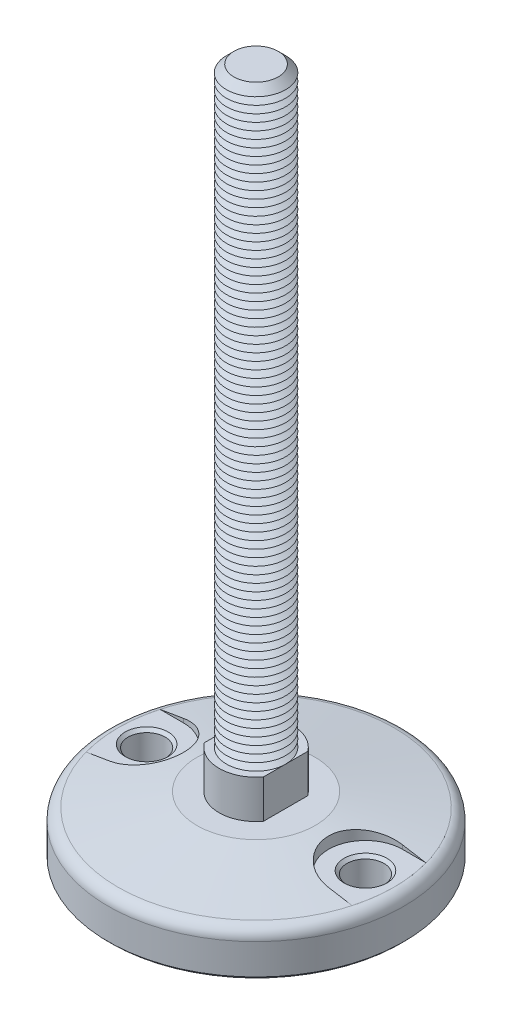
ISO-10303-21;
HEADER;
FILE_DESCRIPTION(('STEP AP214'),'2;1');
FILE_NAME('part.step','',(''),(''),'','','');
FILE_SCHEMA(('AUTOMOTIVE_DESIGN { 1 0 10303 214 1 1 1 1 }'));
ENDSEC;
DATA;
#1=APPLICATION_CONTEXT('core data for automotive mechanical design processes');
#2=APPLICATION_PROTOCOL_DEFINITION('international standard','automotive_design',2000,#1);
#3=PRODUCT_CONTEXT('',#1,'mechanical');
#4=PRODUCT('Part','Part','',(#3));
#5=PRODUCT_RELATED_PRODUCT_CATEGORY('part','',(#4));
#6=PRODUCT_DEFINITION_FORMATION('','',#4);
#7=PRODUCT_DEFINITION_CONTEXT('part definition',#1,'design');
#8=PRODUCT_DEFINITION('design','',#6,#7);
#9=PRODUCT_DEFINITION_SHAPE('','',#8);
#10=(LENGTH_UNIT() NAMED_UNIT(*) SI_UNIT(.MILLI.,.METRE.));
#11=(NAMED_UNIT(*) PLANE_ANGLE_UNIT() SI_UNIT($,.RADIAN.));
#12=(NAMED_UNIT(*) SI_UNIT($,.STERADIAN.) SOLID_ANGLE_UNIT());
#13=UNCERTAINTY_MEASURE_WITH_UNIT(LENGTH_MEASURE(1.E-05),#10,'distance_accuracy_value','');
#14=(GEOMETRIC_REPRESENTATION_CONTEXT(3) GLOBAL_UNCERTAINTY_ASSIGNED_CONTEXT((#13)) GLOBAL_UNIT_ASSIGNED_CONTEXT((#10,
#11,#12)) REPRESENTATION_CONTEXT('',''));
#15=CARTESIAN_POINT('',(0.,0.,0.));
#16=DIRECTION('',(0.,0.,1.));
#17=DIRECTION('',(1.,0.,0.));
#18=AXIS2_PLACEMENT_3D('',#15,#16,#17);
#19=CARTESIAN_POINT('',(0.,0.,0.));
#20=DIRECTION('',(0.,-1.,0.));
#21=DIRECTION('',(0.,0.,-1.));
#22=AXIS2_PLACEMENT_3D('',#19,#20,#21);
#23=CONICAL_SURFACE('',#22,20.,1.39626340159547);
#24=CARTESIAN_POINT('',(-37.0002,-3.35984690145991,12.4999999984));
#25=CARTESIAN_POINT('',(-36.6430801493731,-3.30019612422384,12.5000422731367));
#26=CARTESIAN_POINT('',(-36.286097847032,-3.23978096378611,12.4847089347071));
#27=CARTESIAN_POINT('',(-35.5749710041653,-3.11777545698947,12.423622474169));
#28=CARTESIAN_POINT('',(-35.2208262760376,-3.05618518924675,12.3778713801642));
#29=CARTESIAN_POINT('',(-34.5181114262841,-2.93221424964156,12.2563192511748));
#30=CARTESIAN_POINT('',(-34.1695379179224,-2.8698341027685,12.1805372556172));
#31=CARTESIAN_POINT('',(-33.4802130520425,-2.74463484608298,11.9995028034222));
#32=CARTESIAN_POINT('',(-33.1394616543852,-2.6818157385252,11.8942504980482));
#33=CARTESIAN_POINT('',(-32.4680688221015,-2.55613846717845,11.6549842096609));
#34=CARTESIAN_POINT('',(-32.1374312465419,-2.49328029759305,11.520959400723));
#35=CARTESIAN_POINT('',(-31.4887465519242,-2.36801465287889,11.2251130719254));
#36=CARTESIAN_POINT('',(-31.1706994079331,-2.30560717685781,11.063291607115));
#37=CARTESIAN_POINT('',(-30.54950311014,-2.18176290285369,10.7129930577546));
#38=CARTESIAN_POINT('',(-30.2463517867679,-2.12032596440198,10.524519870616));
#39=CARTESIAN_POINT('',(-29.6570687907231,-1.99897375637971,10.1221856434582));
#40=CARTESIAN_POINT('',(-29.3709370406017,-1.93905847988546,9.90832471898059));
#41=CARTESIAN_POINT('',(-28.8178459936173,-1.82137928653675,9.45673190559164));
#42=CARTESIAN_POINT('',(-28.5508809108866,-1.76361472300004,9.21900727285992));
#43=CARTESIAN_POINT('',(-28.0379874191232,-1.65088194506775,8.72124060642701));
#44=CARTESIAN_POINT('',(-27.7920590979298,-1.5959137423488,8.46119847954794));
#45=CARTESIAN_POINT('',(-27.323055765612,-1.48948182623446,7.9205326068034));
#46=CARTESIAN_POINT('',(-27.0999836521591,-1.43801855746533,7.63990625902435));
#47=CARTESIAN_POINT('',(-26.6784495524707,-1.33936166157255,7.06003375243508));
#48=CARTESIAN_POINT('',(-26.4799872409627,-1.29216797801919,6.76078783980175));
#49=CARTESIAN_POINT('',(-26.1117166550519,-1.20342811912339,6.14986205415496));
#50=CARTESIAN_POINT('',(-25.94156246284,-1.16181519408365,5.83840042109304));
#51=CARTESIAN_POINT('',(-25.628116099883,-1.08426427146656,5.20155792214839));
#52=CARTESIAN_POINT('',(-25.484823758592,-1.04832623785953,4.87617714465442));
#53=CARTESIAN_POINT('',(-25.2263277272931,-0.982857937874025,4.21390178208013));
#54=CARTESIAN_POINT('',(-25.1111175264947,-0.953326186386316,3.87700988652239));
#55=CARTESIAN_POINT('',(-24.9097439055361,-0.901314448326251,3.19412252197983));
#56=CARTESIAN_POINT('',(-24.8235797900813,-0.878834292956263,2.84812727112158));
#57=CARTESIAN_POINT('',(-24.6830159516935,-0.841972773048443,2.15919160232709));
#58=CARTESIAN_POINT('',(-24.6278129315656,-0.827386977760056,1.8164258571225));
#59=CARTESIAN_POINT('',(-24.5460973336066,-0.805742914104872,1.12725695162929));
#60=CARTESIAN_POINT('',(-24.5195842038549,-0.798684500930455,0.78085386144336));
#61=CARTESIAN_POINT('',(-24.4954839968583,-0.792269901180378,0.0870072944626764));
#62=CARTESIAN_POINT('',(-24.4978939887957,-0.79291293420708,-0.260436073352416));
#63=CARTESIAN_POINT('',(-24.5316115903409,-0.801883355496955,-0.953816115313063));
#64=CARTESIAN_POINT('',(-24.5629189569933,-0.810210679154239,-1.29975280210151));
#65=CARTESIAN_POINT('',(-24.6532283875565,-0.834099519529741,-1.98059726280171));
#66=CARTESIAN_POINT('',(-24.7116571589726,-0.849511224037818,-2.31558655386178));
#67=CARTESIAN_POINT('',(-24.8554972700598,-0.887161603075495,-2.97932206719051));
#68=CARTESIAN_POINT('',(-24.9409081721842,-0.909400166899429,-3.30806839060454));
#69=CARTESIAN_POINT('',(-25.1380243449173,-0.96022687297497,-3.95709027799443));
#70=CARTESIAN_POINT('',(-25.2497309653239,-0.988815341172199,-4.27736540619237));
#71=CARTESIAN_POINT('',(-25.498560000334,-1.05177019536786,-4.90729718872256));
#72=CARTESIAN_POINT('',(-25.6356828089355,-1.08613667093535,-5.21695367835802));
#73=CARTESIAN_POINT('',(-25.9361124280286,-1.16046648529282,-5.82730491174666));
#74=CARTESIAN_POINT('',(-26.0997157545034,-1.20049246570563,-6.12784605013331));
#75=CARTESIAN_POINT('',(-26.4506699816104,-1.28514282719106,-6.71404041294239));
#76=CARTESIAN_POINT('',(-26.6380209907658,-1.32976722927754,-6.99969356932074));
#77=CARTESIAN_POINT('',(-27.0351260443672,-1.42294054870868,-7.55431098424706));
#78=CARTESIAN_POINT('',(-27.2448809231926,-1.47148961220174,-7.82327462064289));
#79=CARTESIAN_POINT('',(-27.6853233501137,-1.57185653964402,-8.34282852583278));
#80=CARTESIAN_POINT('',(-27.9160114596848,-1.62367449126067,-8.59341830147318));
#81=CARTESIAN_POINT('',(-28.4034930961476,-1.73144835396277,-9.08142742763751));
#82=CARTESIAN_POINT('',(-28.660837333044,-1.78747956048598,-9.31828026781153));
#83=CARTESIAN_POINT('',(-29.1941741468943,-1.90170822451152,-9.7693949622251));
#84=CARTESIAN_POINT('',(-29.4701671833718,-1.95990573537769,-9.9836562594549));
#85=CARTESIAN_POINT('',(-30.0390002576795,-2.07790752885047,-10.3882796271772));
#86=CARTESIAN_POINT('',(-30.3318471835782,-2.1377124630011,-10.5786318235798));
#87=CARTESIAN_POINT('',(-30.9322646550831,-2.25836853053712,-10.9340888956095));
#88=CARTESIAN_POINT('',(-31.2398348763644,-2.31921964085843,-11.0991943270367));
#89=CARTESIAN_POINT('',(-31.8736774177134,-2.44266131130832,-11.4060146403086));
#90=CARTESIAN_POINT('',(-32.2001962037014,-2.50526276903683,-11.5472162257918));
#91=CARTESIAN_POINT('',(-32.8640586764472,-2.63057186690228,-11.8012839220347));
#92=CARTESIAN_POINT('',(-33.2014023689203,-2.69327950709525,-11.9141500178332));
#93=CARTESIAN_POINT('',(-33.8840988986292,-2.81828940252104,-12.1106227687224));
#94=CARTESIAN_POINT('',(-34.2294411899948,-2.88059206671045,-12.1942658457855));
#95=CARTESIAN_POINT('',(-34.9259788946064,-3.00445494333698,-12.3318436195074));
#96=CARTESIAN_POINT('',(-35.2771713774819,-3.06601550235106,-12.3857927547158));
#97=CARTESIAN_POINT('',(-35.8576122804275,-3.16637163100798,-12.4497947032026));
#98=CARTESIAN_POINT('',(-36.0858729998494,-3.20548751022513,-12.468632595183));
#99=CARTESIAN_POINT('',(-36.5427974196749,-3.2831194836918,-12.4937281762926));
#100=CARTESIAN_POINT('',(-36.7714598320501,-3.32163646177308,-12.5000065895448));
#101=CARTESIAN_POINT('',(-37.0002,-3.35984690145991,-12.4999999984));
#102=B_SPLINE_CURVE_WITH_KNOTS('',3,(#24,#25,#26,#27,#28,#29,#30,#31,#32,#33,#34,#35,#36,#37,
#38,#39,#40,#41,#42,#43,#44,#45,#46,#47,#48,#49,#50,#51,#52,#53,#54,#55,#56,#57,#58,#59,#60,#61,
#62,#63,#64,#65,#66,#67,#68,#69,#70,#71,#72,#73,#74,#75,#76,#77,#78,#79,#80,#81,#82,#83,#84,#85,
#86,#87,#88,#89,#90,#91,#92,#93,#94,#95,#96,#97,#98,#99,#100,#101),.UNSPECIFIED.,.F.,.F.,(4,2,2,
2,2,2,2,2,2,2,2,2,2,2,2,2,2,2,2,2,2,2,2,2,2,2,2,2,2,2,2,2,2,2,2,2,2,2,4),(0.,1.08586245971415,
2.171652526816,3.25675530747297,4.34185251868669,5.42735872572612,6.51286278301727,
7.59820826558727,8.68354880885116,9.76856032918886,10.853576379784,11.9387298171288,
13.0238689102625,14.0945791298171,15.1652825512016,16.2357374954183,17.3061668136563,
18.3473597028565,19.3885325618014,20.4295999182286,21.4706585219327,22.4906487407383,
23.5106224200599,24.5306484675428,25.5506903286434,26.5830642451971,27.6154428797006,
28.6478599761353,29.680304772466,30.7417064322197,31.8031342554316,32.8649990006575,
33.9268403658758,35.0091880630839,36.0915363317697,37.1725307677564,38.2529991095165,
38.9497417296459,39.6453337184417),.UNSPECIFIED.);
#103=CARTESIAN_POINT('',(-37.,-3.35981349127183,12.5));
#104=VERTEX_POINT('',#103);
#105=CARTESIAN_POINT('',(-37.,-3.35981349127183,-12.5));
#106=VERTEX_POINT('',#105);
#107=EDGE_CURVE('E900',#104,#106,#102,.T.);
#108=ORIENTED_EDGE('',*,*,#107,.F.);
#109=CARTESIAN_POINT('',(-61.7266967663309,-7.57847020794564,12.5));
#110=CARTESIAN_POINT('',(-60.2351929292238,-7.320720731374,12.5));
#111=CARTESIAN_POINT('',(-58.7436306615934,-7.06330856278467,12.5));
#112=CARTESIAN_POINT('',(-55.7603527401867,-6.54937673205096,12.5));
#113=CARTESIAN_POINT('',(-54.2686370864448,-6.29285706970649,12.5));
#114=CARTESIAN_POINT('',(-51.2850284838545,-5.78093030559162,12.5));
#115=CARTESIAN_POINT('',(-49.7931355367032,-5.52552319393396,12.5));
#116=CARTESIAN_POINT('',(-46.8091047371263,-5.01613816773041,12.5));
#117=CARTESIAN_POINT('',(-45.3169668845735,-4.76216025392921,12.5));
#118=CARTESIAN_POINT('',(-42.3323589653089,-4.25607669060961,12.5));
#119=CARTESIAN_POINT('',(-40.8398888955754,-4.00397105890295,12.5));
#120=CARTESIAN_POINT('',(-37.8545274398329,-3.50227519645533,12.5));
#121=CARTESIAN_POINT('',(-36.3616360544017,-3.252684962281,12.5));
#122=CARTESIAN_POINT('',(-34.1218562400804,-2.88092207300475,12.5));
#123=CARTESIAN_POINT('',(-33.3751855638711,-2.7574375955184,12.5));
#124=CARTESIAN_POINT('',(-31.8816714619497,-2.51151914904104,12.5));
#125=CARTESIAN_POINT('',(-31.1348280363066,-2.38908517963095,12.5));
#126=CARTESIAN_POINT('',(-29.6409325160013,-2.14547417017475,12.5));
#127=CARTESIAN_POINT('',(-28.8938804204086,-2.024297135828,12.5));
#128=CARTESIAN_POINT('',(-27.3995261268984,-1.78348915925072,12.5));
#129=CARTESIAN_POINT('',(-26.6522239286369,-1.66385821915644,12.5));
#130=CARTESIAN_POINT('',(-25.9047753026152,-1.54514479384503,12.5));
#131=B_SPLINE_CURVE_WITH_KNOTS('',3,(#109,#110,#111,#112,#113,#114,#115,#116,#117,#118,#119,
#120,#121,#122,#123,#124,#125,#126,#127,#128,#129,#130),.UNSPECIFIED.,.F.,.F.,(4,2,2,2,2,2,2,2,
2,2,4),(0.,4.54083339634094,9.08166577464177,13.6224577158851,18.1632520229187,22.7040894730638,
27.2449207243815,29.5153583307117,31.7857950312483,34.0562420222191,36.3266921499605),.UNSPECIFIED.);
#132=CARTESIAN_POINT('',(-44.9493194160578,-4.7,12.5));
#133=VERTEX_POINT('',#132);
#134=EDGE_CURVE('E874',#133,#104,#131,.T.);
#135=ORIENTED_EDGE('',*,*,#134,.F.);
#136=CARTESIAN_POINT('',(0.,-4.7,0.));
#137=DIRECTION('',(0.,1.,0.));
#138=DIRECTION('',(0.,0.,1.));
#139=AXIS2_PLACEMENT_3D('',#136,#137,#138);
#140=CIRCLE('',#139,46.6550245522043);
#141=CARTESIAN_POINT('',(-44.9493194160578,-4.7,-12.5));
#142=VERTEX_POINT('',#141);
#143=EDGE_CURVE('E863',#133,#142,#140,.F.);
#144=ORIENTED_EDGE('',*,*,#143,.T.);
#145=CARTESIAN_POINT('',(-25.9047753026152,-1.54514479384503,-12.5));
#146=CARTESIAN_POINT('',(-26.6522239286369,-1.66385821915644,-12.5));
#147=CARTESIAN_POINT('',(-27.3995261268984,-1.78348915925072,-12.5));
#148=CARTESIAN_POINT('',(-28.8938804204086,-2.024297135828,-12.5));
#149=CARTESIAN_POINT('',(-29.6409325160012,-2.14547417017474,-12.5));
#150=CARTESIAN_POINT('',(-31.1348280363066,-2.38908517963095,-12.5));
#151=CARTESIAN_POINT('',(-31.8816714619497,-2.51151914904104,-12.5));
#152=CARTESIAN_POINT('',(-33.3751855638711,-2.7574375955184,-12.5));
#153=CARTESIAN_POINT('',(-34.1218562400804,-2.88092207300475,-12.5));
#154=CARTESIAN_POINT('',(-36.3616360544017,-3.252684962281,-12.5));
#155=CARTESIAN_POINT('',(-37.8545274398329,-3.50227519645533,-12.5));
#156=CARTESIAN_POINT('',(-40.8398888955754,-4.00397105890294,-12.5));
#157=CARTESIAN_POINT('',(-42.3323589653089,-4.2560766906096,-12.5));
#158=CARTESIAN_POINT('',(-45.3169668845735,-4.7621602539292,-12.5));
#159=CARTESIAN_POINT('',(-46.8091047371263,-5.01613816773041,-12.5));
#160=CARTESIAN_POINT('',(-49.7931355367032,-5.52552319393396,-12.5));
#161=CARTESIAN_POINT('',(-51.2850284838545,-5.78093030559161,-12.5));
#162=CARTESIAN_POINT('',(-54.2686370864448,-6.29285706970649,-12.5));
#163=CARTESIAN_POINT('',(-55.7603527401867,-6.54937673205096,-12.5));
#164=CARTESIAN_POINT('',(-58.7436306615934,-7.06330856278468,-12.5));
#165=CARTESIAN_POINT('',(-60.2351929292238,-7.320720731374,-12.5));
#166=CARTESIAN_POINT('',(-61.7266967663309,-7.57847020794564,-12.5));
#167=B_SPLINE_CURVE_WITH_KNOTS('',3,(#145,#146,#147,#148,#149,#150,#151,#152,#153,#154,#155,
#156,#157,#158,#159,#160,#161,#162,#163,#164,#165,#166),.UNSPECIFIED.,.F.,.F.,(4,2,2,2,2,2,2,2,
2,2,4),(0.,2.27045012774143,4.54089711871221,6.81133381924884,9.08177142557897,13.6226026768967,
18.1634401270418,22.7042344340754,27.2450263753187,31.7858587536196,36.3266921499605),.UNSPECIFIED.);
#168=EDGE_CURVE('E866',#106,#142,#167,.T.);
#169=ORIENTED_EDGE('',*,*,#168,.F.);
#170=EDGE_LOOP('',(#108,#135,#144,#169));
#171=FACE_BOUND('',#170,.T.);
#172=CARTESIAN_POINT('',(0.,-4.70697693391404,0.));
#173=DIRECTION('',(0.,1.,0.));
#174=DIRECTION('',(0.,0.,1.));
#175=AXIS2_PLACEMENT_3D('',#172,#173,#174);
#176=CIRCLE('',#175,46.6945927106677);
#177=CARTESIAN_POINT('',(0.,-4.70697693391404,46.6945927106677));
#178=VERTEX_POINT('',#177);
#179=EDGE_CURVE('E852',#178,#178,#176,.T.);
#180=ORIENTED_EDGE('',*,*,#179,.T.);
#181=EDGE_LOOP('',(#180));
#182=FACE_BOUND('',#181,.T.);
#183=CARTESIAN_POINT('',(0.,0.,0.));
#184=DIRECTION('',(0.,1.,0.));
#185=DIRECTION('',(0.,0.,1.));
#186=AXIS2_PLACEMENT_3D('',#183,#184,#185);
#187=CIRCLE('',#186,20.);
#188=CARTESIAN_POINT('',(0.,0.,20.));
#189=VERTEX_POINT('',#188);
#190=EDGE_CURVE('E848',#189,#189,#187,.T.);
#191=ORIENTED_EDGE('',*,*,#190,.F.);
#192=EDGE_LOOP('',(#191));
#193=FACE_BOUND('',#192,.T.);
#194=CARTESIAN_POINT('',(55.9042883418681,-6.57430258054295,12.5));
#195=CARTESIAN_POINT('',(54.412585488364,-6.31763127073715,12.5));
#196=CARTESIAN_POINT('',(52.9208062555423,-6.06140219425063,12.5));
#197=CARTESIAN_POINT('',(49.9370413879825,-5.55015786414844,12.5));
#198=CARTESIAN_POINT('',(48.4450557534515,-5.29514260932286,12.5));
#199=CARTESIAN_POINT('',(45.4608530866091,-4.78666015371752,12.5));
#200=CARTESIAN_POINT('',(43.9686360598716,-4.53319292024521,12.5));
#201=CARTESIAN_POINT('',(40.9838536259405,-4.02830138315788,12.5));
#202=CARTESIAN_POINT('',(39.4912882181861,-3.7768770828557,12.5));
#203=CARTESIAN_POINT('',(36.50565536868,-3.27679220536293,12.5));
#204=CARTESIAN_POINT('',(35.0125879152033,-3.02813169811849,12.5));
#205=CARTESIAN_POINT('',(32.0258195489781,-2.53467103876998,12.5));
#206=CARTESIAN_POINT('',(30.5321186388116,-2.28987087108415,12.5));
#207=CARTESIAN_POINT('',(28.290865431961,-1.92688841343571,12.5));
#208=CARTESIAN_POINT('',(27.5436550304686,-1.80659579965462,12.5));
#209=CARTESIAN_POINT('',(26.0489572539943,-1.56774876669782,12.5));
#210=CARTESIAN_POINT('',(25.3014698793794,-1.44919434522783,12.5));
#211=CARTESIAN_POINT('',(23.8061486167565,-1.21422016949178,12.5));
#212=CARTESIAN_POINT('',(23.0583147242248,-1.09780044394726,12.5));
#213=CARTESIAN_POINT('',(21.5622260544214,-0.867676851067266,12.5));
#214=CARTESIAN_POINT('',(20.8139712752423,-0.753972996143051,12.5));
#215=CARTESIAN_POINT('',(20.0654672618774,-0.641917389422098,12.5));
#216=B_SPLINE_CURVE_WITH_KNOTS('',3,(#194,#195,#196,#197,#198,#199,#200,#201,#202,#203,#204,
#205,#206,#207,#208,#209,#210,#211,#212,#213,#214,#215),.UNSPECIFIED.,.F.,.F.,(4,2,2,2,2,2,2,2,
2,2,4),(0.,4.54087231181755,9.08174009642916,13.6225116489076,18.1632905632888,22.7041841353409,
27.2450593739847,29.515551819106,31.7860412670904,34.0565612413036,36.3270915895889),.UNSPECIFIED.);
#217=CARTESIAN_POINT('',(44.9493194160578,-4.7,12.5));
#218=VERTEX_POINT('',#217);
#219=CARTESIAN_POINT('',(37.,-3.35981349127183,12.5));
#220=VERTEX_POINT('',#219);
#221=EDGE_CURVE('E127',#218,#220,#216,.T.);
#222=ORIENTED_EDGE('',*,*,#221,.T.);
#223=CARTESIAN_POINT('',(37.0002,-3.35984690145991,12.4999999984));
#224=CARTESIAN_POINT('',(36.6430801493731,-3.30019612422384,12.5000422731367));
#225=CARTESIAN_POINT('',(36.286097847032,-3.23978096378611,12.4847089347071));
#226=CARTESIAN_POINT('',(35.5749710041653,-3.11777545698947,12.423622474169));
#227=CARTESIAN_POINT('',(35.2208262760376,-3.05618518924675,12.3778713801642));
#228=CARTESIAN_POINT('',(34.5181114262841,-2.93221424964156,12.2563192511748));
#229=CARTESIAN_POINT('',(34.1695379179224,-2.8698341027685,12.1805372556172));
#230=CARTESIAN_POINT('',(33.4802130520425,-2.74463484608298,11.9995028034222));
#231=CARTESIAN_POINT('',(33.1394616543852,-2.6818157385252,11.8942504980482));
#232=CARTESIAN_POINT('',(32.4680688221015,-2.55613846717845,11.6549842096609));
#233=CARTESIAN_POINT('',(32.1374312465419,-2.49328029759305,11.520959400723));
#234=CARTESIAN_POINT('',(31.4887465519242,-2.36801465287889,11.2251130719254));
#235=CARTESIAN_POINT('',(31.1706994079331,-2.30560717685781,11.063291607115));
#236=CARTESIAN_POINT('',(30.54950311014,-2.18176290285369,10.7129930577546));
#237=CARTESIAN_POINT('',(30.2463517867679,-2.12032596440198,10.524519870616));
#238=CARTESIAN_POINT('',(29.6570687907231,-1.99897375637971,10.1221856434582));
#239=CARTESIAN_POINT('',(29.3709370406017,-1.93905847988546,9.90832471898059));
#240=CARTESIAN_POINT('',(28.8178459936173,-1.82137928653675,9.45673190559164));
#241=CARTESIAN_POINT('',(28.5508809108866,-1.76361472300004,9.21900727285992));
#242=CARTESIAN_POINT('',(28.0379874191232,-1.65088194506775,8.72124060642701));
#243=CARTESIAN_POINT('',(27.7920590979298,-1.5959137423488,8.46119847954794));
#244=CARTESIAN_POINT('',(27.323055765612,-1.48948182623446,7.9205326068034));
#245=CARTESIAN_POINT('',(27.0999836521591,-1.43801855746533,7.63990625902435));
#246=CARTESIAN_POINT('',(26.6784495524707,-1.33936166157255,7.06003375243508));
#247=CARTESIAN_POINT('',(26.4799872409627,-1.29216797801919,6.76078783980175));
#248=CARTESIAN_POINT('',(26.1117166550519,-1.20342811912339,6.14986205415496));
#249=CARTESIAN_POINT('',(25.94156246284,-1.16181519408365,5.83840042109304));
#250=CARTESIAN_POINT('',(25.628116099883,-1.08426427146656,5.20155792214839));
#251=CARTESIAN_POINT('',(25.484823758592,-1.04832623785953,4.87617714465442));
#252=CARTESIAN_POINT('',(25.2263277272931,-0.982857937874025,4.21390178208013));
#253=CARTESIAN_POINT('',(25.1111175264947,-0.953326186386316,3.87700988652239));
#254=CARTESIAN_POINT('',(24.9097439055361,-0.901314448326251,3.19412252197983));
#255=CARTESIAN_POINT('',(24.8235797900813,-0.878834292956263,2.84812727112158));
#256=CARTESIAN_POINT('',(24.6830159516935,-0.841972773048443,2.15919160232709));
#257=CARTESIAN_POINT('',(24.6278129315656,-0.827386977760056,1.8164258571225));
#258=CARTESIAN_POINT('',(24.5460973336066,-0.805742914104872,1.12725695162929));
#259=CARTESIAN_POINT('',(24.5195842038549,-0.798684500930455,0.78085386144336));
#260=CARTESIAN_POINT('',(24.4954839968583,-0.792269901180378,0.0870072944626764));
#261=CARTESIAN_POINT('',(24.4978939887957,-0.79291293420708,-0.260436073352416));
#262=CARTESIAN_POINT('',(24.5316115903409,-0.801883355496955,-0.953816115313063));
#263=CARTESIAN_POINT('',(24.5629189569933,-0.810210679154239,-1.29975280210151));
#264=CARTESIAN_POINT('',(24.6532283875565,-0.834099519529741,-1.98059726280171));
#265=CARTESIAN_POINT('',(24.7116571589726,-0.849511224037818,-2.31558655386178));
#266=CARTESIAN_POINT('',(24.8554972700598,-0.887161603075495,-2.97932206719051));
#267=CARTESIAN_POINT('',(24.9409081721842,-0.909400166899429,-3.30806839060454));
#268=CARTESIAN_POINT('',(25.1380243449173,-0.96022687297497,-3.95709027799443));
#269=CARTESIAN_POINT('',(25.2497309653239,-0.988815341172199,-4.27736540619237));
#270=CARTESIAN_POINT('',(25.498560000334,-1.05177019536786,-4.90729718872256));
#271=CARTESIAN_POINT('',(25.6356828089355,-1.08613667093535,-5.21695367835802));
#272=CARTESIAN_POINT('',(25.9361124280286,-1.16046648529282,-5.82730491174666));
#273=CARTESIAN_POINT('',(26.0997157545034,-1.20049246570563,-6.12784605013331));
#274=CARTESIAN_POINT('',(26.4506699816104,-1.28514282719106,-6.71404041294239));
#275=CARTESIAN_POINT('',(26.6380209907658,-1.32976722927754,-6.99969356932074));
#276=CARTESIAN_POINT('',(27.0351260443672,-1.42294054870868,-7.55431098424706));
#277=CARTESIAN_POINT('',(27.2448809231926,-1.47148961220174,-7.82327462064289));
#278=CARTESIAN_POINT('',(27.6853233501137,-1.57185653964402,-8.34282852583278));
#279=CARTESIAN_POINT('',(27.9160114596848,-1.62367449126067,-8.59341830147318));
#280=CARTESIAN_POINT('',(28.4034930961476,-1.73144835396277,-9.08142742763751));
#281=CARTESIAN_POINT('',(28.660837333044,-1.78747956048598,-9.31828026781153));
#282=CARTESIAN_POINT('',(29.1941741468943,-1.90170822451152,-9.7693949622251));
#283=CARTESIAN_POINT('',(29.4701671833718,-1.95990573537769,-9.9836562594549));
#284=CARTESIAN_POINT('',(30.0390002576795,-2.07790752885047,-10.3882796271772));
#285=CARTESIAN_POINT('',(30.3318471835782,-2.1377124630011,-10.5786318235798));
#286=CARTESIAN_POINT('',(30.9322646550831,-2.25836853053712,-10.9340888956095));
#287=CARTESIAN_POINT('',(31.2398348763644,-2.31921964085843,-11.0991943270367));
#288=CARTESIAN_POINT('',(31.8736774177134,-2.44266131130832,-11.4060146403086));
#289=CARTESIAN_POINT('',(32.2001962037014,-2.50526276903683,-11.5472162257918));
#290=CARTESIAN_POINT('',(32.8640586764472,-2.63057186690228,-11.8012839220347));
#291=CARTESIAN_POINT('',(33.2014023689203,-2.69327950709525,-11.9141500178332));
#292=CARTESIAN_POINT('',(33.8840988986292,-2.81828940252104,-12.1106227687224));
#293=CARTESIAN_POINT('',(34.2294411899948,-2.88059206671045,-12.1942658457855));
#294=CARTESIAN_POINT('',(34.9259788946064,-3.00445494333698,-12.3318436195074));
#295=CARTESIAN_POINT('',(35.2771713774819,-3.06601550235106,-12.3857927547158));
#296=CARTESIAN_POINT('',(35.8576122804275,-3.16637163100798,-12.4497947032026));
#297=CARTESIAN_POINT('',(36.0858729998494,-3.20548751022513,-12.468632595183));
#298=CARTESIAN_POINT('',(36.5427974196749,-3.2831194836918,-12.4937281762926));
#299=CARTESIAN_POINT('',(36.7714598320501,-3.32163646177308,-12.5000065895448));
#300=CARTESIAN_POINT('',(37.0002,-3.35984690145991,-12.4999999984));
#301=B_SPLINE_CURVE_WITH_KNOTS('',3,(#223,#224,#225,#226,#227,#228,#229,#230,#231,#232,#233,
#234,#235,#236,#237,#238,#239,#240,#241,#242,#243,#244,#245,#246,#247,#248,#249,#250,#251,#252,
#253,#254,#255,#256,#257,#258,#259,#260,#261,#262,#263,#264,#265,#266,#267,#268,#269,#270,#271,
#272,#273,#274,#275,#276,#277,#278,#279,#280,#281,#282,#283,#284,#285,#286,#287,#288,#289,#290,
#291,#292,#293,#294,#295,#296,#297,#298,#299,#300),.UNSPECIFIED.,.F.,.F.,(4,2,2,2,2,2,2,2,2,2,2,
2,2,2,2,2,2,2,2,2,2,2,2,2,2,2,2,2,2,2,2,2,2,2,2,2,2,2,4),(0.,1.08586245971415,2.171652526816,
3.25675530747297,4.34185251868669,5.42735872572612,6.51286278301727,7.59820826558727,
8.68354880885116,9.76856032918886,10.853576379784,11.9387298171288,13.0238689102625,
14.0945791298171,15.1652825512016,16.2357374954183,17.3061668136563,18.3473597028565,
19.3885325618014,20.4295999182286,21.4706585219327,22.4906487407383,23.5106224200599,
24.5306484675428,25.5506903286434,26.5830642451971,27.6154428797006,28.6478599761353,
29.680304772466,30.7417064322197,31.8031342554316,32.8649990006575,33.9268403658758,
35.0091880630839,36.0915363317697,37.1725307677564,38.2529991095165,38.9497417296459,
39.6453337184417),.UNSPECIFIED.);
#302=CARTESIAN_POINT('',(37.,-3.35981349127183,-12.5));
#303=VERTEX_POINT('',#302);
#304=EDGE_CURVE('E139',#220,#303,#301,.T.);
#305=ORIENTED_EDGE('',*,*,#304,.T.);
#306=CARTESIAN_POINT('',(20.0654672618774,-0.641917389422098,-12.5));
#307=CARTESIAN_POINT('',(20.8139712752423,-0.753972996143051,-12.5));
#308=CARTESIAN_POINT('',(21.5622260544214,-0.867676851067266,-12.5));
#309=CARTESIAN_POINT('',(23.0583147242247,-1.09780044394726,-12.5));
#310=CARTESIAN_POINT('',(23.8061486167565,-1.21422016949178,-12.5));
#311=CARTESIAN_POINT('',(25.3014698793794,-1.44919434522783,-12.5));
#312=CARTESIAN_POINT('',(26.0489572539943,-1.56774876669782,-12.5));
#313=CARTESIAN_POINT('',(27.5436550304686,-1.80659579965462,-12.5));
#314=CARTESIAN_POINT('',(28.290865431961,-1.92688841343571,-12.5));
#315=CARTESIAN_POINT('',(30.5321186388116,-2.28987087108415,-12.5));
#316=CARTESIAN_POINT('',(32.0258195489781,-2.53467103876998,-12.5));
#317=CARTESIAN_POINT('',(35.0125879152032,-3.02813169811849,-12.5));
#318=CARTESIAN_POINT('',(36.50565536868,-3.27679220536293,-12.5));
#319=CARTESIAN_POINT('',(39.4912882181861,-3.7768770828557,-12.5));
#320=CARTESIAN_POINT('',(40.9838536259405,-4.02830138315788,-12.5));
#321=CARTESIAN_POINT('',(43.9686360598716,-4.53319292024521,-12.5));
#322=CARTESIAN_POINT('',(45.4608530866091,-4.78666015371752,-12.5));
#323=CARTESIAN_POINT('',(48.4450557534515,-5.29514260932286,-12.5));
#324=CARTESIAN_POINT('',(49.9370413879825,-5.55015786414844,-12.5));
#325=CARTESIAN_POINT('',(52.9208062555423,-6.06140219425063,-12.5));
#326=CARTESIAN_POINT('',(54.412585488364,-6.31763127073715,-12.5));
#327=CARTESIAN_POINT('',(55.9042883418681,-6.57430258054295,-12.5));
#328=B_SPLINE_CURVE_WITH_KNOTS('',3,(#306,#307,#308,#309,#310,#311,#312,#313,#314,#315,#316,
#317,#318,#319,#320,#321,#322,#323,#324,#325,#326,#327),.UNSPECIFIED.,.F.,.F.,(4,2,2,2,2,2,2,2,
2,2,4),(0.,2.27053034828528,4.54105032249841,6.81153977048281,9.08203221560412,13.6229074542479,
18.1638010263,22.7045799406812,27.2453514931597,31.7862192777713,36.3270915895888),.UNSPECIFIED.);
#329=CARTESIAN_POINT('',(44.9493194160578,-4.7,-12.5));
#330=VERTEX_POINT('',#329);
#331=EDGE_CURVE('E931',#303,#330,#328,.T.);
#332=ORIENTED_EDGE('',*,*,#331,.T.);
#333=CARTESIAN_POINT('',(0.,-4.7,0.));
#334=DIRECTION('',(0.,1.,0.));
#335=DIRECTION('',(0.,0.,1.));
#336=AXIS2_PLACEMENT_3D('',#333,#334,#335);
#337=CIRCLE('',#336,46.6550245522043);
#338=EDGE_CURVE('E922',#330,#218,#337,.F.);
#339=ORIENTED_EDGE('',*,*,#338,.T.);
#340=EDGE_LOOP('',(#222,#305,#332,#339));
#341=FACE_BOUND('',#340,.T.);
#342=ADVANCED_FACE('F39',(#171,#182,#193,#341),#23,.T.);
#343=CARTESIAN_POINT('',(0.,13.,0.));
#344=DIRECTION('',(0.,1.,0.));
#345=DIRECTION('',(0.,0.,1.));
#346=AXIS2_PLACEMENT_3D('',#343,#344,#345);
#347=PLANE('',#346);
#348=CARTESIAN_POINT('',(0.,13.,0.));
#349=DIRECTION('',(0.,1.,0.));
#350=DIRECTION('',(0.,0.,1.));
#351=AXIS2_PLACEMENT_3D('',#348,#349,#350);
#352=CIRCLE('',#351,10.);
#353=CARTESIAN_POINT('',(10.,13.,0.));
#354=VERTEX_POINT('',#353);
#355=CARTESIAN_POINT('',(-10.,13.,0.));
#356=VERTEX_POINT('',#355);
#357=EDGE_CURVE('E801',#354,#356,#352,.T.);
#358=ORIENTED_EDGE('',*,*,#357,.F.);
#359=DIRECTION('',(0.,0.,1.));
#360=VECTOR('',#359,1.);
#361=CARTESIAN_POINT('',(10.,13.,7.5));
#362=LINE('',#361,#360);
#363=CARTESIAN_POINT('',(10.,13.,-7.5));
#364=VERTEX_POINT('',#363);
#365=EDGE_CURVE('E828',#364,#354,#362,.T.);
#366=ORIENTED_EDGE('',*,*,#365,.F.);
#367=CARTESIAN_POINT('',(0.,13.,0.));
#368=DIRECTION('',(0.,1.,0.));
#369=DIRECTION('',(0.,0.,1.));
#370=AXIS2_PLACEMENT_3D('',#367,#368,#369);
#371=CIRCLE('',#370,12.5);
#372=CARTESIAN_POINT('',(-10.,13.,-7.5));
#373=VERTEX_POINT('',#372);
#374=EDGE_CURVE('E841',#364,#373,#371,.T.);
#375=ORIENTED_EDGE('',*,*,#374,.T.);
#376=DIRECTION('',(0.,0.,-1.));
#377=VECTOR('',#376,1.);
#378=CARTESIAN_POINT('',(-10.,13.,-7.5));
#379=LINE('',#378,#377);
#380=EDGE_CURVE('E815',#356,#373,#379,.T.);
#381=ORIENTED_EDGE('',*,*,#380,.F.);
#382=EDGE_LOOP('',(#358,#366,#375,#381));
#383=FACE_BOUND('',#382,.T.);
#384=ADVANCED_FACE('F986',(#383),#347,.T.);
#385=CARTESIAN_POINT('',(0.,13.,0.));
#386=DIRECTION('',(0.,-1.,0.));
#387=DIRECTION('',(0.,0.,-1.));
#388=AXIS2_PLACEMENT_3D('',#385,#386,#387);
#389=CYLINDRICAL_SURFACE('',#388,12.5);
#390=CARTESIAN_POINT('',(-10.,13.,7.5));
#391=VERTEX_POINT('',#390);
#392=CARTESIAN_POINT('',(10.,13.,7.5));
#393=VERTEX_POINT('',#392);
#394=EDGE_CURVE('E820',#391,#393,#371,.T.);
#395=ORIENTED_EDGE('',*,*,#394,.F.);
#396=DIRECTION('',(0.,1.,0.));
#397=VECTOR('',#396,1.);
#398=CARTESIAN_POINT('',(-10.,0.,7.5));
#399=LINE('',#398,#397);
#400=CARTESIAN_POINT('',(-10.,0.,7.5));
#401=VERTEX_POINT('',#400);
#402=EDGE_CURVE('E810',#401,#391,#399,.T.);
#403=ORIENTED_EDGE('',*,*,#402,.F.);
#404=CARTESIAN_POINT('',(0.,0.,0.));
#405=DIRECTION('',(0.,1.,0.));
#406=DIRECTION('',(0.,0.,1.));
#407=AXIS2_PLACEMENT_3D('',#404,#405,#406);
#408=CIRCLE('',#407,12.5);
#409=CARTESIAN_POINT('',(10.,0.,7.5));
#410=VERTEX_POINT('',#409);
#411=EDGE_CURVE('E842',#401,#410,#408,.T.);
#412=ORIENTED_EDGE('',*,*,#411,.T.);
#413=DIRECTION('',(0.,1.,0.));
#414=VECTOR('',#413,1.);
#415=CARTESIAN_POINT('',(10.,0.,7.5));
#416=LINE('',#415,#414);
#417=EDGE_CURVE('E832',#410,#393,#416,.T.);
#418=ORIENTED_EDGE('',*,*,#417,.T.);
#419=EDGE_LOOP('',(#395,#403,#412,#418));
#420=FACE_BOUND('',#419,.T.);
#421=ADVANCED_FACE('F991',(#420),#389,.T.);
#422=CARTESIAN_POINT('',(0.,0.,0.));
#423=DIRECTION('',(0.,1.,0.));
#424=DIRECTION('',(0.,0.,1.));
#425=AXIS2_PLACEMENT_3D('',#422,#423,#424);
#426=PLANE('',#425);
#427=CARTESIAN_POINT('',(10.,0.,-7.5));
#428=VERTEX_POINT('',#427);
#429=CARTESIAN_POINT('',(-10.,0.,-7.5));
#430=VERTEX_POINT('',#429);
#431=EDGE_CURVE('E846',#428,#430,#408,.T.);
#432=ORIENTED_EDGE('',*,*,#431,.F.);
#433=DIRECTION('',(0.,0.,1.));
#434=VECTOR('',#433,1.);
#435=CARTESIAN_POINT('',(10.,0.,7.5));
#436=LINE('',#435,#434);
#437=EDGE_CURVE('E823',#428,#410,#436,.T.);
#438=ORIENTED_EDGE('',*,*,#437,.T.);
#439=ORIENTED_EDGE('',*,*,#411,.F.);
#440=DIRECTION('',(0.,0.,-1.));
#441=VECTOR('',#440,1.);
#442=CARTESIAN_POINT('',(-10.,0.,-7.5));
#443=LINE('',#442,#441);
#444=EDGE_CURVE('E806',#401,#430,#443,.T.);
#445=ORIENTED_EDGE('',*,*,#444,.T.);
#446=EDGE_LOOP('',(#432,#438,#439,#445));
#447=FACE_BOUND('',#446,.T.);
#448=ORIENTED_EDGE('',*,*,#190,.T.);
#449=EDGE_LOOP('',(#448));
#450=FACE_BOUND('',#449,.T.);
#451=ADVANCED_FACE('F1029',(#447,#450),#426,.T.);
#452=CARTESIAN_POINT('',(0.,61.3388655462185,0.));
#453=DIRECTION('',(0.,1.,0.));
#454=DIRECTION('',(0.,0.,1.));
#455=AXIS2_PLACEMENT_3D('',#452,#453,#454);
#456=CYLINDRICAL_SURFACE('',#455,50.);
#457=CARTESIAN_POINT('',(0.,-18.9999999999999,0.));
#458=DIRECTION('',(0.,-1.,0.));
#459=DIRECTION('',(0.,0.,-1.));
#460=AXIS2_PLACEMENT_3D('',#457,#458,#459);
#461=CIRCLE('',#460,50.);
#462=CARTESIAN_POINT('',(0.,-18.9999999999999,-50.));
#463=VERTEX_POINT('',#462);
#464=EDGE_CURVE('E48',#463,#463,#461,.F.);
#465=ORIENTED_EDGE('',*,*,#464,.T.);
#466=EDGE_LOOP('',(#465));
#467=FACE_BOUND('',#466,.T.);
#468=CARTESIAN_POINT('',(0.,-8.64620794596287,0.));
#469=DIRECTION('',(0.,-1.,0.));
#470=DIRECTION('',(0.,0.,-1.));
#471=AXIS2_PLACEMENT_3D('',#468,#469,#470);
#472=CIRCLE('',#471,50.);
#473=CARTESIAN_POINT('',(0.,-8.64620794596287,-50.));
#474=VERTEX_POINT('',#473);
#475=EDGE_CURVE('E847',#474,#474,#472,.T.);
#476=ORIENTED_EDGE('',*,*,#475,.T.);
#477=EDGE_LOOP('',(#476));
#478=FACE_BOUND('',#477,.T.);
#479=ADVANCED_FACE('F973',(#467,#478),#456,.T.);
#480=CARTESIAN_POINT('',(0.,-20.,50.));
#481=DIRECTION('',(0.,-1.,0.));
#482=DIRECTION('',(0.,0.,-1.));
#483=AXIS2_PLACEMENT_3D('',#480,#481,#482);
#484=PLANE('',#483);
#485=CARTESIAN_POINT('',(0.,-20.,0.));
#486=DIRECTION('',(0.,-1.,0.));
#487=DIRECTION('',(0.,0.,-1.));
#488=AXIS2_PLACEMENT_3D('',#485,#486,#487);
#489=CIRCLE('',#488,48.9999999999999);
#490=CARTESIAN_POINT('',(0.,-20.,-48.9999999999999));
#491=VERTEX_POINT('',#490);
#492=EDGE_CURVE('E11',#491,#491,#489,.T.);
#493=ORIENTED_EDGE('',*,*,#492,.T.);
#494=EDGE_LOOP('',(#493));
#495=FACE_BOUND('',#494,.T.);
#496=CARTESIAN_POINT('',(37.,-20.,0.));
#497=DIRECTION('',(0.,-1.,0.));
#498=DIRECTION('',(0.,0.,-1.));
#499=AXIS2_PLACEMENT_3D('',#496,#497,#498);
#500=CIRCLE('',#499,7.25000000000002);
#501=CARTESIAN_POINT('',(37.,-20.,-7.25000000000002));
#502=VERTEX_POINT('',#501);
#503=EDGE_CURVE('E961',#502,#502,#500,.F.);
#504=ORIENTED_EDGE('',*,*,#503,.T.);
#505=EDGE_LOOP('',(#504));
#506=FACE_BOUND('',#505,.T.);
#507=CARTESIAN_POINT('',(-37.,-20.,0.));
#508=DIRECTION('',(0.,-1.,0.));
#509=DIRECTION('',(0.,0.,-1.));
#510=AXIS2_PLACEMENT_3D('',#507,#508,#509);
#511=CIRCLE('',#510,7.24999999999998);
#512=CARTESIAN_POINT('',(-37.,-20.,-7.24999999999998));
#513=VERTEX_POINT('',#512);
#514=EDGE_CURVE('E906',#513,#513,#511,.F.);
#515=ORIENTED_EDGE('',*,*,#514,.T.);
#516=EDGE_LOOP('',(#515));
#517=FACE_BOUND('',#516,.T.);
#518=ADVANCED_FACE('F1063',(#495,#506,#517),#484,.T.);
#519=CARTESIAN_POINT('',(0.,-8.64620794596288,0.));
#520=DIRECTION('',(0.,-1.,0.));
#521=DIRECTION('',(0.,0.,-1.));
#522=AXIS2_PLACEMENT_3D('',#519,#520,#521);
#523=TOROIDAL_SURFACE('',#522,46.,4.);
#524=ORIENTED_EDGE('',*,*,#475,.F.);
#525=EDGE_LOOP('',(#524));
#526=FACE_BOUND('',#525,.T.);
#527=ORIENTED_EDGE('',*,*,#179,.F.);
#528=EDGE_LOOP('',(#527));
#529=FACE_BOUND('',#528,.T.);
#530=ADVANCED_FACE('F1062',(#526,#529),#523,.T.);
#531=ORIENTED_EDGE('',*,*,#431,.T.);
#532=DIRECTION('',(0.,1.,0.));
#533=VECTOR('',#532,1.);
#534=CARTESIAN_POINT('',(-10.,0.,-7.5));
#535=LINE('',#534,#533);
#536=EDGE_CURVE('E816',#430,#373,#535,.T.);
#537=ORIENTED_EDGE('',*,*,#536,.T.);
#538=ORIENTED_EDGE('',*,*,#374,.F.);
#539=DIRECTION('',(0.,1.,0.));
#540=VECTOR('',#539,1.);
#541=CARTESIAN_POINT('',(10.,0.,-7.5));
#542=LINE('',#541,#540);
#543=EDGE_CURVE('E827',#428,#364,#542,.T.);
#544=ORIENTED_EDGE('',*,*,#543,.F.);
#545=EDGE_LOOP('',(#531,#537,#538,#544));
#546=FACE_BOUND('',#545,.T.);
#547=ADVANCED_FACE('F1034',(#546),#389,.T.);
#548=EDGE_CURVE('E805',#356,#354,#352,.T.);
#549=ORIENTED_EDGE('',*,*,#548,.F.);
#550=EDGE_CURVE('E811',#391,#356,#379,.T.);
#551=ORIENTED_EDGE('',*,*,#550,.F.);
#552=ORIENTED_EDGE('',*,*,#394,.T.);
#553=EDGE_CURVE('E804',#354,#393,#362,.T.);
#554=ORIENTED_EDGE('',*,*,#553,.F.);
#555=EDGE_LOOP('',(#549,#551,#552,#554));
#556=FACE_BOUND('',#555,.T.);
#557=ADVANCED_FACE('F994',(#556),#347,.T.);
#558=CARTESIAN_POINT('',(10.,0.,7.5));
#559=DIRECTION('',(-1.,0.,0.));
#560=DIRECTION('',(0.,0.,1.));
#561=AXIS2_PLACEMENT_3D('',#558,#559,#560);
#562=PLANE('',#561);
#563=ORIENTED_EDGE('',*,*,#365,.T.);
#564=ORIENTED_EDGE('',*,*,#553,.T.);
#565=ORIENTED_EDGE('',*,*,#417,.F.);
#566=ORIENTED_EDGE('',*,*,#437,.F.);
#567=ORIENTED_EDGE('',*,*,#543,.T.);
#568=EDGE_LOOP('',(#563,#564,#565,#566,#567));
#569=FACE_BOUND('',#568,.T.);
#570=ADVANCED_FACE('F1014',(#569),#562,.F.);
#571=CARTESIAN_POINT('',(-10.,0.,-7.5));
#572=DIRECTION('',(1.,0.,0.));
#573=DIRECTION('',(0.,0.,-1.));
#574=AXIS2_PLACEMENT_3D('',#571,#572,#573);
#575=PLANE('',#574);
#576=ORIENTED_EDGE('',*,*,#550,.T.);
#577=ORIENTED_EDGE('',*,*,#380,.T.);
#578=ORIENTED_EDGE('',*,*,#536,.F.);
#579=ORIENTED_EDGE('',*,*,#444,.F.);
#580=ORIENTED_EDGE('',*,*,#402,.T.);
#581=EDGE_LOOP('',(#576,#577,#578,#579,#580));
#582=FACE_BOUND('',#581,.T.);
#583=ADVANCED_FACE('F1026',(#582),#575,.F.);
#584=CARTESIAN_POINT('',(0.,13.,0.));
#585=DIRECTION('',(0.,-1.,0.));
#586=DIRECTION('',(0.,0.,-1.));
#587=AXIS2_PLACEMENT_3D('',#584,#585,#586);
#588=CONICAL_SURFACE('',#587,10.,1.0471975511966);
#589=CARTESIAN_POINT('',(0.,14.25,0.));
#590=DIRECTION('',(0.,1.,0.));
#591=DIRECTION('',(0.,0.,1.));
#592=AXIS2_PLACEMENT_3D('',#589,#590,#591);
#593=CIRCLE('',#592,7.8349364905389);
#594=CARTESIAN_POINT('',(0.,14.25,7.8349364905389));
#595=VERTEX_POINT('',#594);
#596=EDGE_CURVE('E797',#595,#595,#593,.T.);
#597=ORIENTED_EDGE('',*,*,#596,.F.);
#598=EDGE_LOOP('',(#597));
#599=FACE_BOUND('',#598,.T.);
#600=ORIENTED_EDGE('',*,*,#357,.T.);
#601=ORIENTED_EDGE('',*,*,#548,.T.);
#602=EDGE_LOOP('',(#600,#601));
#603=FACE_BOUND('',#602,.T.);
#604=ADVANCED_FACE('F1037',(#599,#603),#588,.T.);
#605=CARTESIAN_POINT('',(0.,14.25,0.));
#606=DIRECTION('',(0.,1.,0.));
#607=DIRECTION('',(0.,0.,1.));
#608=AXIS2_PLACEMENT_3D('',#605,#606,#607);
#609=CONICAL_SURFACE('',#608,7.8349364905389,1.0471975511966);
#610=CARTESIAN_POINT('',(0.,15.5,0.));
#611=DIRECTION('',(0.,1.,0.));
#612=DIRECTION('',(0.,0.,1.));
#613=AXIS2_PLACEMENT_3D('',#610,#611,#612);
#614=CIRCLE('',#613,10.);
#615=CARTESIAN_POINT('',(0.,15.5,10.));
#616=VERTEX_POINT('',#615);
#617=EDGE_CURVE('E793',#616,#616,#614,.T.);
#618=ORIENTED_EDGE('',*,*,#617,.F.);
#619=EDGE_LOOP('',(#618));
#620=FACE_BOUND('',#619,.T.);
#621=ORIENTED_EDGE('',*,*,#596,.T.);
#622=EDGE_LOOP('',(#621));
#623=FACE_BOUND('',#622,.T.);
#624=ADVANCED_FACE('F1039',(#620,#623),#609,.T.);
#625=CARTESIAN_POINT('',(0.,15.5,0.));
#626=DIRECTION('',(0.,-1.,0.));
#627=DIRECTION('',(0.,0.,-1.));
#628=AXIS2_PLACEMENT_3D('',#625,#626,#627);
#629=CONICAL_SURFACE('',#628,10.,1.0471975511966);
#630=CARTESIAN_POINT('',(0.,16.75,0.));
#631=DIRECTION('',(0.,1.,0.));
#632=DIRECTION('',(0.,0.,1.));
#633=AXIS2_PLACEMENT_3D('',#630,#631,#632);
#634=CIRCLE('',#633,7.8349364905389);
#635=CARTESIAN_POINT('',(0.,16.75,7.8349364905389));
#636=VERTEX_POINT('',#635);
#637=EDGE_CURVE('E789',#636,#636,#634,.T.);
#638=ORIENTED_EDGE('',*,*,#637,.F.);
#639=EDGE_LOOP('',(#638));
#640=FACE_BOUND('',#639,.T.);
#641=ORIENTED_EDGE('',*,*,#617,.T.);
#642=EDGE_LOOP('',(#641));
#643=FACE_BOUND('',#642,.T.);
#644=ADVANCED_FACE('F1046',(#640,#643),#629,.T.);
#645=CARTESIAN_POINT('',(0.,16.75,0.));
#646=DIRECTION('',(0.,1.,0.));
#647=DIRECTION('',(0.,0.,1.));
#648=AXIS2_PLACEMENT_3D('',#645,#646,#647);
#649=CONICAL_SURFACE('',#648,7.8349364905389,1.0471975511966);
#650=CARTESIAN_POINT('',(0.,18.,0.));
#651=DIRECTION('',(0.,1.,0.));
#652=DIRECTION('',(0.,0.,1.));
#653=AXIS2_PLACEMENT_3D('',#650,#651,#652);
#654=CIRCLE('',#653,10.);
#655=CARTESIAN_POINT('',(0.,18.,10.));
#656=VERTEX_POINT('',#655);
#657=EDGE_CURVE('E785',#656,#656,#654,.T.);
#658=ORIENTED_EDGE('',*,*,#657,.F.);
#659=EDGE_LOOP('',(#658));
#660=FACE_BOUND('',#659,.T.);
#661=ORIENTED_EDGE('',*,*,#637,.T.);
#662=EDGE_LOOP('',(#661));
#663=FACE_BOUND('',#662,.T.);
#664=ADVANCED_FACE('F2303',(#660,#663),#649,.T.);
#665=CARTESIAN_POINT('',(0.,18.,0.));
#666=DIRECTION('',(0.,-1.,0.));
#667=DIRECTION('',(0.,0.,-1.));
#668=AXIS2_PLACEMENT_3D('',#665,#666,#667);
#669=CONICAL_SURFACE('',#668,10.,1.0471975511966);
#670=CARTESIAN_POINT('',(0.,19.25,0.));
#671=DIRECTION('',(0.,1.,0.));
#672=DIRECTION('',(0.,0.,1.));
#673=AXIS2_PLACEMENT_3D('',#670,#671,#672);
#674=CIRCLE('',#673,7.8349364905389);
#675=CARTESIAN_POINT('',(0.,19.25,7.8349364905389));
#676=VERTEX_POINT('',#675);
#677=EDGE_CURVE('E781',#676,#676,#674,.T.);
#678=ORIENTED_EDGE('',*,*,#677,.F.);
#679=EDGE_LOOP('',(#678));
#680=FACE_BOUND('',#679,.T.);
#681=ORIENTED_EDGE('',*,*,#657,.T.);
#682=EDGE_LOOP('',(#681));
#683=FACE_BOUND('',#682,.T.);
#684=ADVANCED_FACE('F2296',(#680,#683),#669,.T.);
#685=CARTESIAN_POINT('',(0.,19.25,0.));
#686=DIRECTION('',(0.,1.,0.));
#687=DIRECTION('',(0.,0.,1.));
#688=AXIS2_PLACEMENT_3D('',#685,#686,#687);
#689=CONICAL_SURFACE('',#688,7.8349364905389,1.0471975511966);
#690=CARTESIAN_POINT('',(0.,20.5,0.));
#691=DIRECTION('',(0.,1.,0.));
#692=DIRECTION('',(0.,0.,1.));
#693=AXIS2_PLACEMENT_3D('',#690,#691,#692);
#694=CIRCLE('',#693,10.);
#695=CARTESIAN_POINT('',(0.,20.5,10.));
#696=VERTEX_POINT('',#695);
#697=EDGE_CURVE('E777',#696,#696,#694,.T.);
#698=ORIENTED_EDGE('',*,*,#697,.F.);
#699=EDGE_LOOP('',(#698));
#700=FACE_BOUND('',#699,.T.);
#701=ORIENTED_EDGE('',*,*,#677,.T.);
#702=EDGE_LOOP('',(#701));
#703=FACE_BOUND('',#702,.T.);
#704=ADVANCED_FACE('F2289',(#700,#703),#689,.T.);
#705=CARTESIAN_POINT('',(0.,20.5,0.));
#706=DIRECTION('',(0.,-1.,0.));
#707=DIRECTION('',(0.,0.,-1.));
#708=AXIS2_PLACEMENT_3D('',#705,#706,#707);
#709=CONICAL_SURFACE('',#708,10.,1.0471975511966);
#710=CARTESIAN_POINT('',(0.,21.75,0.));
#711=DIRECTION('',(0.,1.,0.));
#712=DIRECTION('',(0.,0.,1.));
#713=AXIS2_PLACEMENT_3D('',#710,#711,#712);
#714=CIRCLE('',#713,7.8349364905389);
#715=CARTESIAN_POINT('',(0.,21.75,7.8349364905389));
#716=VERTEX_POINT('',#715);
#717=EDGE_CURVE('E773',#716,#716,#714,.T.);
#718=ORIENTED_EDGE('',*,*,#717,.F.);
#719=EDGE_LOOP('',(#718));
#720=FACE_BOUND('',#719,.T.);
#721=ORIENTED_EDGE('',*,*,#697,.T.);
#722=EDGE_LOOP('',(#721));
#723=FACE_BOUND('',#722,.T.);
#724=ADVANCED_FACE('F2282',(#720,#723),#709,.T.);
#725=CARTESIAN_POINT('',(0.,21.75,0.));
#726=DIRECTION('',(0.,1.,0.));
#727=DIRECTION('',(0.,0.,1.));
#728=AXIS2_PLACEMENT_3D('',#725,#726,#727);
#729=CONICAL_SURFACE('',#728,7.8349364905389,1.0471975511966);
#730=CARTESIAN_POINT('',(0.,23.,0.));
#731=DIRECTION('',(0.,1.,0.));
#732=DIRECTION('',(0.,0.,1.));
#733=AXIS2_PLACEMENT_3D('',#730,#731,#732);
#734=CIRCLE('',#733,10.);
#735=CARTESIAN_POINT('',(0.,23.,10.));
#736=VERTEX_POINT('',#735);
#737=EDGE_CURVE('E769',#736,#736,#734,.T.);
#738=ORIENTED_EDGE('',*,*,#737,.F.);
#739=EDGE_LOOP('',(#738));
#740=FACE_BOUND('',#739,.T.);
#741=ORIENTED_EDGE('',*,*,#717,.T.);
#742=EDGE_LOOP('',(#741));
#743=FACE_BOUND('',#742,.T.);
#744=ADVANCED_FACE('F2275',(#740,#743),#729,.T.);
#745=CARTESIAN_POINT('',(0.,23.,0.));
#746=DIRECTION('',(0.,-1.,0.));
#747=DIRECTION('',(0.,0.,-1.));
#748=AXIS2_PLACEMENT_3D('',#745,#746,#747);
#749=CONICAL_SURFACE('',#748,10.,1.0471975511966);
#750=CARTESIAN_POINT('',(0.,24.25,0.));
#751=DIRECTION('',(0.,1.,0.));
#752=DIRECTION('',(0.,0.,1.));
#753=AXIS2_PLACEMENT_3D('',#750,#751,#752);
#754=CIRCLE('',#753,7.8349364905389);
#755=CARTESIAN_POINT('',(0.,24.25,7.8349364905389));
#756=VERTEX_POINT('',#755);
#757=EDGE_CURVE('E765',#756,#756,#754,.T.);
#758=ORIENTED_EDGE('',*,*,#757,.F.);
#759=EDGE_LOOP('',(#758));
#760=FACE_BOUND('',#759,.T.);
#761=ORIENTED_EDGE('',*,*,#737,.T.);
#762=EDGE_LOOP('',(#761));
#763=FACE_BOUND('',#762,.T.);
#764=ADVANCED_FACE('F2268',(#760,#763),#749,.T.);
#765=CARTESIAN_POINT('',(0.,24.25,0.));
#766=DIRECTION('',(0.,1.,0.));
#767=DIRECTION('',(0.,0.,1.));
#768=AXIS2_PLACEMENT_3D('',#765,#766,#767);
#769=CONICAL_SURFACE('',#768,7.8349364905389,1.0471975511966);
#770=CARTESIAN_POINT('',(0.,25.5,0.));
#771=DIRECTION('',(0.,1.,0.));
#772=DIRECTION('',(0.,0.,1.));
#773=AXIS2_PLACEMENT_3D('',#770,#771,#772);
#774=CIRCLE('',#773,10.);
#775=CARTESIAN_POINT('',(0.,25.5,10.));
#776=VERTEX_POINT('',#775);
#777=EDGE_CURVE('E761',#776,#776,#774,.T.);
#778=ORIENTED_EDGE('',*,*,#777,.F.);
#779=EDGE_LOOP('',(#778));
#780=FACE_BOUND('',#779,.T.);
#781=ORIENTED_EDGE('',*,*,#757,.T.);
#782=EDGE_LOOP('',(#781));
#783=FACE_BOUND('',#782,.T.);
#784=ADVANCED_FACE('F2261',(#780,#783),#769,.T.);
#785=CARTESIAN_POINT('',(0.,25.5,0.));
#786=DIRECTION('',(0.,-1.,0.));
#787=DIRECTION('',(0.,0.,-1.));
#788=AXIS2_PLACEMENT_3D('',#785,#786,#787);
#789=CONICAL_SURFACE('',#788,10.,1.0471975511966);
#790=CARTESIAN_POINT('',(0.,26.75,0.));
#791=DIRECTION('',(0.,1.,0.));
#792=DIRECTION('',(0.,0.,1.));
#793=AXIS2_PLACEMENT_3D('',#790,#791,#792);
#794=CIRCLE('',#793,7.8349364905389);
#795=CARTESIAN_POINT('',(0.,26.75,7.8349364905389));
#796=VERTEX_POINT('',#795);
#797=EDGE_CURVE('E757',#796,#796,#794,.T.);
#798=ORIENTED_EDGE('',*,*,#797,.F.);
#799=EDGE_LOOP('',(#798));
#800=FACE_BOUND('',#799,.T.);
#801=ORIENTED_EDGE('',*,*,#777,.T.);
#802=EDGE_LOOP('',(#801));
#803=FACE_BOUND('',#802,.T.);
#804=ADVANCED_FACE('F2254',(#800,#803),#789,.T.);
#805=CARTESIAN_POINT('',(0.,26.75,0.));
#806=DIRECTION('',(0.,1.,0.));
#807=DIRECTION('',(0.,0.,1.));
#808=AXIS2_PLACEMENT_3D('',#805,#806,#807);
#809=CONICAL_SURFACE('',#808,7.8349364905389,1.0471975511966);
#810=CARTESIAN_POINT('',(0.,28.,0.));
#811=DIRECTION('',(0.,1.,0.));
#812=DIRECTION('',(0.,0.,1.));
#813=AXIS2_PLACEMENT_3D('',#810,#811,#812);
#814=CIRCLE('',#813,10.);
#815=CARTESIAN_POINT('',(0.,28.,10.));
#816=VERTEX_POINT('',#815);
#817=EDGE_CURVE('E753',#816,#816,#814,.T.);
#818=ORIENTED_EDGE('',*,*,#817,.F.);
#819=EDGE_LOOP('',(#818));
#820=FACE_BOUND('',#819,.T.);
#821=ORIENTED_EDGE('',*,*,#797,.T.);
#822=EDGE_LOOP('',(#821));
#823=FACE_BOUND('',#822,.T.);
#824=ADVANCED_FACE('F2247',(#820,#823),#809,.T.);
#825=CARTESIAN_POINT('',(0.,28.,0.));
#826=DIRECTION('',(0.,-1.,0.));
#827=DIRECTION('',(0.,0.,-1.));
#828=AXIS2_PLACEMENT_3D('',#825,#826,#827);
#829=CONICAL_SURFACE('',#828,10.,1.0471975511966);
#830=CARTESIAN_POINT('',(0.,29.25,0.));
#831=DIRECTION('',(0.,1.,0.));
#832=DIRECTION('',(0.,0.,1.));
#833=AXIS2_PLACEMENT_3D('',#830,#831,#832);
#834=CIRCLE('',#833,7.8349364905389);
#835=CARTESIAN_POINT('',(0.,29.25,7.8349364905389));
#836=VERTEX_POINT('',#835);
#837=EDGE_CURVE('E749',#836,#836,#834,.T.);
#838=ORIENTED_EDGE('',*,*,#837,.F.);
#839=EDGE_LOOP('',(#838));
#840=FACE_BOUND('',#839,.T.);
#841=ORIENTED_EDGE('',*,*,#817,.T.);
#842=EDGE_LOOP('',(#841));
#843=FACE_BOUND('',#842,.T.);
#844=ADVANCED_FACE('F2240',(#840,#843),#829,.T.);
#845=CARTESIAN_POINT('',(0.,29.25,0.));
#846=DIRECTION('',(0.,1.,0.));
#847=DIRECTION('',(0.,0.,1.));
#848=AXIS2_PLACEMENT_3D('',#845,#846,#847);
#849=CONICAL_SURFACE('',#848,7.8349364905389,1.0471975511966);
#850=CARTESIAN_POINT('',(0.,30.5,0.));
#851=DIRECTION('',(0.,1.,0.));
#852=DIRECTION('',(0.,0.,1.));
#853=AXIS2_PLACEMENT_3D('',#850,#851,#852);
#854=CIRCLE('',#853,10.);
#855=CARTESIAN_POINT('',(0.,30.5,10.));
#856=VERTEX_POINT('',#855);
#857=EDGE_CURVE('E745',#856,#856,#854,.T.);
#858=ORIENTED_EDGE('',*,*,#857,.F.);
#859=EDGE_LOOP('',(#858));
#860=FACE_BOUND('',#859,.T.);
#861=ORIENTED_EDGE('',*,*,#837,.T.);
#862=EDGE_LOOP('',(#861));
#863=FACE_BOUND('',#862,.T.);
#864=ADVANCED_FACE('F2233',(#860,#863),#849,.T.);
#865=CARTESIAN_POINT('',(0.,30.5,0.));
#866=DIRECTION('',(0.,-1.,0.));
#867=DIRECTION('',(0.,0.,-1.));
#868=AXIS2_PLACEMENT_3D('',#865,#866,#867);
#869=CONICAL_SURFACE('',#868,10.,1.0471975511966);
#870=CARTESIAN_POINT('',(0.,31.75,0.));
#871=DIRECTION('',(0.,1.,0.));
#872=DIRECTION('',(0.,0.,1.));
#873=AXIS2_PLACEMENT_3D('',#870,#871,#872);
#874=CIRCLE('',#873,7.8349364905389);
#875=CARTESIAN_POINT('',(0.,31.75,7.8349364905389));
#876=VERTEX_POINT('',#875);
#877=EDGE_CURVE('E741',#876,#876,#874,.T.);
#878=ORIENTED_EDGE('',*,*,#877,.F.);
#879=EDGE_LOOP('',(#878));
#880=FACE_BOUND('',#879,.T.);
#881=ORIENTED_EDGE('',*,*,#857,.T.);
#882=EDGE_LOOP('',(#881));
#883=FACE_BOUND('',#882,.T.);
#884=ADVANCED_FACE('F2226',(#880,#883),#869,.T.);
#885=CARTESIAN_POINT('',(0.,31.75,0.));
#886=DIRECTION('',(0.,1.,0.));
#887=DIRECTION('',(0.,0.,1.));
#888=AXIS2_PLACEMENT_3D('',#885,#886,#887);
#889=CONICAL_SURFACE('',#888,7.8349364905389,1.0471975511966);
#890=CARTESIAN_POINT('',(0.,33.,0.));
#891=DIRECTION('',(0.,1.,0.));
#892=DIRECTION('',(0.,0.,1.));
#893=AXIS2_PLACEMENT_3D('',#890,#891,#892);
#894=CIRCLE('',#893,10.);
#895=CARTESIAN_POINT('',(0.,33.,10.));
#896=VERTEX_POINT('',#895);
#897=EDGE_CURVE('E737',#896,#896,#894,.T.);
#898=ORIENTED_EDGE('',*,*,#897,.F.);
#899=EDGE_LOOP('',(#898));
#900=FACE_BOUND('',#899,.T.);
#901=ORIENTED_EDGE('',*,*,#877,.T.);
#902=EDGE_LOOP('',(#901));
#903=FACE_BOUND('',#902,.T.);
#904=ADVANCED_FACE('F2219',(#900,#903),#889,.T.);
#905=CARTESIAN_POINT('',(0.,33.,0.));
#906=DIRECTION('',(0.,-1.,0.));
#907=DIRECTION('',(0.,0.,-1.));
#908=AXIS2_PLACEMENT_3D('',#905,#906,#907);
#909=CONICAL_SURFACE('',#908,10.,1.0471975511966);
#910=CARTESIAN_POINT('',(0.,34.25,0.));
#911=DIRECTION('',(0.,1.,0.));
#912=DIRECTION('',(0.,0.,1.));
#913=AXIS2_PLACEMENT_3D('',#910,#911,#912);
#914=CIRCLE('',#913,7.8349364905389);
#915=CARTESIAN_POINT('',(0.,34.25,7.8349364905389));
#916=VERTEX_POINT('',#915);
#917=EDGE_CURVE('E733',#916,#916,#914,.T.);
#918=ORIENTED_EDGE('',*,*,#917,.F.);
#919=EDGE_LOOP('',(#918));
#920=FACE_BOUND('',#919,.T.);
#921=ORIENTED_EDGE('',*,*,#897,.T.);
#922=EDGE_LOOP('',(#921));
#923=FACE_BOUND('',#922,.T.);
#924=ADVANCED_FACE('F2212',(#920,#923),#909,.T.);
#925=CARTESIAN_POINT('',(0.,34.25,0.));
#926=DIRECTION('',(0.,1.,0.));
#927=DIRECTION('',(0.,0.,1.));
#928=AXIS2_PLACEMENT_3D('',#925,#926,#927);
#929=CONICAL_SURFACE('',#928,7.8349364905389,1.0471975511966);
#930=CARTESIAN_POINT('',(0.,35.5,0.));
#931=DIRECTION('',(0.,1.,0.));
#932=DIRECTION('',(0.,0.,1.));
#933=AXIS2_PLACEMENT_3D('',#930,#931,#932);
#934=CIRCLE('',#933,10.);
#935=CARTESIAN_POINT('',(0.,35.5,10.));
#936=VERTEX_POINT('',#935);
#937=EDGE_CURVE('E729',#936,#936,#934,.T.);
#938=ORIENTED_EDGE('',*,*,#937,.F.);
#939=EDGE_LOOP('',(#938));
#940=FACE_BOUND('',#939,.T.);
#941=ORIENTED_EDGE('',*,*,#917,.T.);
#942=EDGE_LOOP('',(#941));
#943=FACE_BOUND('',#942,.T.);
#944=ADVANCED_FACE('F2205',(#940,#943),#929,.T.);
#945=CARTESIAN_POINT('',(0.,35.5,0.));
#946=DIRECTION('',(0.,-1.,0.));
#947=DIRECTION('',(0.,0.,-1.));
#948=AXIS2_PLACEMENT_3D('',#945,#946,#947);
#949=CONICAL_SURFACE('',#948,10.,1.0471975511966);
#950=CARTESIAN_POINT('',(0.,36.75,0.));
#951=DIRECTION('',(0.,1.,0.));
#952=DIRECTION('',(0.,0.,1.));
#953=AXIS2_PLACEMENT_3D('',#950,#951,#952);
#954=CIRCLE('',#953,7.8349364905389);
#955=CARTESIAN_POINT('',(0.,36.75,7.8349364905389));
#956=VERTEX_POINT('',#955);
#957=EDGE_CURVE('E725',#956,#956,#954,.T.);
#958=ORIENTED_EDGE('',*,*,#957,.F.);
#959=EDGE_LOOP('',(#958));
#960=FACE_BOUND('',#959,.T.);
#961=ORIENTED_EDGE('',*,*,#937,.T.);
#962=EDGE_LOOP('',(#961));
#963=FACE_BOUND('',#962,.T.);
#964=ADVANCED_FACE('F2198',(#960,#963),#949,.T.);
#965=CARTESIAN_POINT('',(0.,36.75,0.));
#966=DIRECTION('',(0.,1.,0.));
#967=DIRECTION('',(0.,0.,1.));
#968=AXIS2_PLACEMENT_3D('',#965,#966,#967);
#969=CONICAL_SURFACE('',#968,7.8349364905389,1.0471975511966);
#970=CARTESIAN_POINT('',(0.,38.,0.));
#971=DIRECTION('',(0.,1.,0.));
#972=DIRECTION('',(0.,0.,1.));
#973=AXIS2_PLACEMENT_3D('',#970,#971,#972);
#974=CIRCLE('',#973,10.);
#975=CARTESIAN_POINT('',(0.,38.,10.));
#976=VERTEX_POINT('',#975);
#977=EDGE_CURVE('E721',#976,#976,#974,.T.);
#978=ORIENTED_EDGE('',*,*,#977,.F.);
#979=EDGE_LOOP('',(#978));
#980=FACE_BOUND('',#979,.T.);
#981=ORIENTED_EDGE('',*,*,#957,.T.);
#982=EDGE_LOOP('',(#981));
#983=FACE_BOUND('',#982,.T.);
#984=ADVANCED_FACE('F2191',(#980,#983),#969,.T.);
#985=CARTESIAN_POINT('',(0.,38.,0.));
#986=DIRECTION('',(0.,-1.,0.));
#987=DIRECTION('',(0.,0.,-1.));
#988=AXIS2_PLACEMENT_3D('',#985,#986,#987);
#989=CONICAL_SURFACE('',#988,10.,1.0471975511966);
#990=CARTESIAN_POINT('',(0.,39.25,0.));
#991=DIRECTION('',(0.,1.,0.));
#992=DIRECTION('',(0.,0.,1.));
#993=AXIS2_PLACEMENT_3D('',#990,#991,#992);
#994=CIRCLE('',#993,7.8349364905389);
#995=CARTESIAN_POINT('',(0.,39.25,7.8349364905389));
#996=VERTEX_POINT('',#995);
#997=EDGE_CURVE('E717',#996,#996,#994,.T.);
#998=ORIENTED_EDGE('',*,*,#997,.F.);
#999=EDGE_LOOP('',(#998));
#1000=FACE_BOUND('',#999,.T.);
#1001=ORIENTED_EDGE('',*,*,#977,.T.);
#1002=EDGE_LOOP('',(#1001));
#1003=FACE_BOUND('',#1002,.T.);
#1004=ADVANCED_FACE('F2184',(#1000,#1003),#989,.T.);
#1005=CARTESIAN_POINT('',(0.,39.25,0.));
#1006=DIRECTION('',(0.,1.,0.));
#1007=DIRECTION('',(0.,0.,1.));
#1008=AXIS2_PLACEMENT_3D('',#1005,#1006,#1007);
#1009=CONICAL_SURFACE('',#1008,7.8349364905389,1.0471975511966);
#1010=CARTESIAN_POINT('',(0.,40.5,0.));
#1011=DIRECTION('',(0.,1.,0.));
#1012=DIRECTION('',(0.,0.,1.));
#1013=AXIS2_PLACEMENT_3D('',#1010,#1011,#1012);
#1014=CIRCLE('',#1013,10.);
#1015=CARTESIAN_POINT('',(0.,40.5,10.));
#1016=VERTEX_POINT('',#1015);
#1017=EDGE_CURVE('E713',#1016,#1016,#1014,.T.);
#1018=ORIENTED_EDGE('',*,*,#1017,.F.);
#1019=EDGE_LOOP('',(#1018));
#1020=FACE_BOUND('',#1019,.T.);
#1021=ORIENTED_EDGE('',*,*,#997,.T.);
#1022=EDGE_LOOP('',(#1021));
#1023=FACE_BOUND('',#1022,.T.);
#1024=ADVANCED_FACE('F2177',(#1020,#1023),#1009,.T.);
#1025=CARTESIAN_POINT('',(0.,40.5,0.));
#1026=DIRECTION('',(0.,-1.,0.));
#1027=DIRECTION('',(0.,0.,-1.));
#1028=AXIS2_PLACEMENT_3D('',#1025,#1026,#1027);
#1029=CONICAL_SURFACE('',#1028,10.,1.0471975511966);
#1030=CARTESIAN_POINT('',(0.,41.75,0.));
#1031=DIRECTION('',(0.,1.,0.));
#1032=DIRECTION('',(0.,0.,1.));
#1033=AXIS2_PLACEMENT_3D('',#1030,#1031,#1032);
#1034=CIRCLE('',#1033,7.8349364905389);
#1035=CARTESIAN_POINT('',(0.,41.75,7.8349364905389));
#1036=VERTEX_POINT('',#1035);
#1037=EDGE_CURVE('E709',#1036,#1036,#1034,.T.);
#1038=ORIENTED_EDGE('',*,*,#1037,.F.);
#1039=EDGE_LOOP('',(#1038));
#1040=FACE_BOUND('',#1039,.T.);
#1041=ORIENTED_EDGE('',*,*,#1017,.T.);
#1042=EDGE_LOOP('',(#1041));
#1043=FACE_BOUND('',#1042,.T.);
#1044=ADVANCED_FACE('F2170',(#1040,#1043),#1029,.T.);
#1045=CARTESIAN_POINT('',(0.,41.75,0.));
#1046=DIRECTION('',(0.,1.,0.));
#1047=DIRECTION('',(0.,0.,1.));
#1048=AXIS2_PLACEMENT_3D('',#1045,#1046,#1047);
#1049=CONICAL_SURFACE('',#1048,7.8349364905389,1.0471975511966);
#1050=CARTESIAN_POINT('',(0.,43.,0.));
#1051=DIRECTION('',(0.,1.,0.));
#1052=DIRECTION('',(0.,0.,1.));
#1053=AXIS2_PLACEMENT_3D('',#1050,#1051,#1052);
#1054=CIRCLE('',#1053,10.);
#1055=CARTESIAN_POINT('',(0.,43.,10.));
#1056=VERTEX_POINT('',#1055);
#1057=EDGE_CURVE('E705',#1056,#1056,#1054,.T.);
#1058=ORIENTED_EDGE('',*,*,#1057,.F.);
#1059=EDGE_LOOP('',(#1058));
#1060=FACE_BOUND('',#1059,.T.);
#1061=ORIENTED_EDGE('',*,*,#1037,.T.);
#1062=EDGE_LOOP('',(#1061));
#1063=FACE_BOUND('',#1062,.T.);
#1064=ADVANCED_FACE('F2163',(#1060,#1063),#1049,.T.);
#1065=CARTESIAN_POINT('',(0.,43.,0.));
#1066=DIRECTION('',(0.,-1.,0.));
#1067=DIRECTION('',(0.,0.,-1.));
#1068=AXIS2_PLACEMENT_3D('',#1065,#1066,#1067);
#1069=CONICAL_SURFACE('',#1068,10.,1.0471975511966);
#1070=CARTESIAN_POINT('',(0.,44.25,0.));
#1071=DIRECTION('',(0.,1.,0.));
#1072=DIRECTION('',(0.,0.,1.));
#1073=AXIS2_PLACEMENT_3D('',#1070,#1071,#1072);
#1074=CIRCLE('',#1073,7.8349364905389);
#1075=CARTESIAN_POINT('',(0.,44.25,7.8349364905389));
#1076=VERTEX_POINT('',#1075);
#1077=EDGE_CURVE('E701',#1076,#1076,#1074,.T.);
#1078=ORIENTED_EDGE('',*,*,#1077,.F.);
#1079=EDGE_LOOP('',(#1078));
#1080=FACE_BOUND('',#1079,.T.);
#1081=ORIENTED_EDGE('',*,*,#1057,.T.);
#1082=EDGE_LOOP('',(#1081));
#1083=FACE_BOUND('',#1082,.T.);
#1084=ADVANCED_FACE('F2156',(#1080,#1083),#1069,.T.);
#1085=CARTESIAN_POINT('',(0.,44.25,0.));
#1086=DIRECTION('',(0.,1.,0.));
#1087=DIRECTION('',(0.,0.,1.));
#1088=AXIS2_PLACEMENT_3D('',#1085,#1086,#1087);
#1089=CONICAL_SURFACE('',#1088,7.8349364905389,1.0471975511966);
#1090=CARTESIAN_POINT('',(0.,45.5,0.));
#1091=DIRECTION('',(0.,1.,0.));
#1092=DIRECTION('',(0.,0.,1.));
#1093=AXIS2_PLACEMENT_3D('',#1090,#1091,#1092);
#1094=CIRCLE('',#1093,10.);
#1095=CARTESIAN_POINT('',(0.,45.5,10.));
#1096=VERTEX_POINT('',#1095);
#1097=EDGE_CURVE('E697',#1096,#1096,#1094,.T.);
#1098=ORIENTED_EDGE('',*,*,#1097,.F.);
#1099=EDGE_LOOP('',(#1098));
#1100=FACE_BOUND('',#1099,.T.);
#1101=ORIENTED_EDGE('',*,*,#1077,.T.);
#1102=EDGE_LOOP('',(#1101));
#1103=FACE_BOUND('',#1102,.T.);
#1104=ADVANCED_FACE('F2149',(#1100,#1103),#1089,.T.);
#1105=CARTESIAN_POINT('',(0.,45.5,0.));
#1106=DIRECTION('',(0.,-1.,0.));
#1107=DIRECTION('',(0.,0.,-1.));
#1108=AXIS2_PLACEMENT_3D('',#1105,#1106,#1107);
#1109=CONICAL_SURFACE('',#1108,10.,1.0471975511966);
#1110=CARTESIAN_POINT('',(0.,46.75,0.));
#1111=DIRECTION('',(0.,1.,0.));
#1112=DIRECTION('',(0.,0.,1.));
#1113=AXIS2_PLACEMENT_3D('',#1110,#1111,#1112);
#1114=CIRCLE('',#1113,7.8349364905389);
#1115=CARTESIAN_POINT('',(0.,46.75,7.8349364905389));
#1116=VERTEX_POINT('',#1115);
#1117=EDGE_CURVE('E693',#1116,#1116,#1114,.T.);
#1118=ORIENTED_EDGE('',*,*,#1117,.F.);
#1119=EDGE_LOOP('',(#1118));
#1120=FACE_BOUND('',#1119,.T.);
#1121=ORIENTED_EDGE('',*,*,#1097,.T.);
#1122=EDGE_LOOP('',(#1121));
#1123=FACE_BOUND('',#1122,.T.);
#1124=ADVANCED_FACE('F2142',(#1120,#1123),#1109,.T.);
#1125=CARTESIAN_POINT('',(0.,46.75,0.));
#1126=DIRECTION('',(0.,1.,0.));
#1127=DIRECTION('',(0.,0.,1.));
#1128=AXIS2_PLACEMENT_3D('',#1125,#1126,#1127);
#1129=CONICAL_SURFACE('',#1128,7.8349364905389,1.0471975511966);
#1130=CARTESIAN_POINT('',(0.,48.,0.));
#1131=DIRECTION('',(0.,1.,0.));
#1132=DIRECTION('',(0.,0.,1.));
#1133=AXIS2_PLACEMENT_3D('',#1130,#1131,#1132);
#1134=CIRCLE('',#1133,10.);
#1135=CARTESIAN_POINT('',(0.,48.,10.));
#1136=VERTEX_POINT('',#1135);
#1137=EDGE_CURVE('E689',#1136,#1136,#1134,.T.);
#1138=ORIENTED_EDGE('',*,*,#1137,.F.);
#1139=EDGE_LOOP('',(#1138));
#1140=FACE_BOUND('',#1139,.T.);
#1141=ORIENTED_EDGE('',*,*,#1117,.T.);
#1142=EDGE_LOOP('',(#1141));
#1143=FACE_BOUND('',#1142,.T.);
#1144=ADVANCED_FACE('F2135',(#1140,#1143),#1129,.T.);
#1145=CARTESIAN_POINT('',(0.,48.,0.));
#1146=DIRECTION('',(0.,-1.,0.));
#1147=DIRECTION('',(0.,0.,-1.));
#1148=AXIS2_PLACEMENT_3D('',#1145,#1146,#1147);
#1149=CONICAL_SURFACE('',#1148,10.,1.0471975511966);
#1150=CARTESIAN_POINT('',(0.,49.25,0.));
#1151=DIRECTION('',(0.,1.,0.));
#1152=DIRECTION('',(0.,0.,1.));
#1153=AXIS2_PLACEMENT_3D('',#1150,#1151,#1152);
#1154=CIRCLE('',#1153,7.8349364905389);
#1155=CARTESIAN_POINT('',(0.,49.25,7.8349364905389));
#1156=VERTEX_POINT('',#1155);
#1157=EDGE_CURVE('E685',#1156,#1156,#1154,.T.);
#1158=ORIENTED_EDGE('',*,*,#1157,.F.);
#1159=EDGE_LOOP('',(#1158));
#1160=FACE_BOUND('',#1159,.T.);
#1161=ORIENTED_EDGE('',*,*,#1137,.T.);
#1162=EDGE_LOOP('',(#1161));
#1163=FACE_BOUND('',#1162,.T.);
#1164=ADVANCED_FACE('F2128',(#1160,#1163),#1149,.T.);
#1165=CARTESIAN_POINT('',(0.,49.25,0.));
#1166=DIRECTION('',(0.,1.,0.));
#1167=DIRECTION('',(0.,0.,1.));
#1168=AXIS2_PLACEMENT_3D('',#1165,#1166,#1167);
#1169=CONICAL_SURFACE('',#1168,7.8349364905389,1.0471975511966);
#1170=CARTESIAN_POINT('',(0.,50.5,0.));
#1171=DIRECTION('',(0.,1.,0.));
#1172=DIRECTION('',(0.,0.,1.));
#1173=AXIS2_PLACEMENT_3D('',#1170,#1171,#1172);
#1174=CIRCLE('',#1173,10.);
#1175=CARTESIAN_POINT('',(0.,50.5,10.));
#1176=VERTEX_POINT('',#1175);
#1177=EDGE_CURVE('E681',#1176,#1176,#1174,.T.);
#1178=ORIENTED_EDGE('',*,*,#1177,.F.);
#1179=EDGE_LOOP('',(#1178));
#1180=FACE_BOUND('',#1179,.T.);
#1181=ORIENTED_EDGE('',*,*,#1157,.T.);
#1182=EDGE_LOOP('',(#1181));
#1183=FACE_BOUND('',#1182,.T.);
#1184=ADVANCED_FACE('F2121',(#1180,#1183),#1169,.T.);
#1185=CARTESIAN_POINT('',(0.,50.5,0.));
#1186=DIRECTION('',(0.,-1.,0.));
#1187=DIRECTION('',(0.,0.,-1.));
#1188=AXIS2_PLACEMENT_3D('',#1185,#1186,#1187);
#1189=CONICAL_SURFACE('',#1188,10.,1.0471975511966);
#1190=CARTESIAN_POINT('',(0.,51.75,0.));
#1191=DIRECTION('',(0.,1.,0.));
#1192=DIRECTION('',(0.,0.,1.));
#1193=AXIS2_PLACEMENT_3D('',#1190,#1191,#1192);
#1194=CIRCLE('',#1193,7.8349364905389);
#1195=CARTESIAN_POINT('',(0.,51.75,7.8349364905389));
#1196=VERTEX_POINT('',#1195);
#1197=EDGE_CURVE('E677',#1196,#1196,#1194,.T.);
#1198=ORIENTED_EDGE('',*,*,#1197,.F.);
#1199=EDGE_LOOP('',(#1198));
#1200=FACE_BOUND('',#1199,.T.);
#1201=ORIENTED_EDGE('',*,*,#1177,.T.);
#1202=EDGE_LOOP('',(#1201));
#1203=FACE_BOUND('',#1202,.T.);
#1204=ADVANCED_FACE('F2114',(#1200,#1203),#1189,.T.);
#1205=CARTESIAN_POINT('',(0.,51.75,0.));
#1206=DIRECTION('',(0.,1.,0.));
#1207=DIRECTION('',(0.,0.,1.));
#1208=AXIS2_PLACEMENT_3D('',#1205,#1206,#1207);
#1209=CONICAL_SURFACE('',#1208,7.8349364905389,1.0471975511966);
#1210=CARTESIAN_POINT('',(0.,53.,0.));
#1211=DIRECTION('',(0.,1.,0.));
#1212=DIRECTION('',(0.,0.,1.));
#1213=AXIS2_PLACEMENT_3D('',#1210,#1211,#1212);
#1214=CIRCLE('',#1213,10.);
#1215=CARTESIAN_POINT('',(0.,53.,10.));
#1216=VERTEX_POINT('',#1215);
#1217=EDGE_CURVE('E673',#1216,#1216,#1214,.T.);
#1218=ORIENTED_EDGE('',*,*,#1217,.F.);
#1219=EDGE_LOOP('',(#1218));
#1220=FACE_BOUND('',#1219,.T.);
#1221=ORIENTED_EDGE('',*,*,#1197,.T.);
#1222=EDGE_LOOP('',(#1221));
#1223=FACE_BOUND('',#1222,.T.);
#1224=ADVANCED_FACE('F2107',(#1220,#1223),#1209,.T.);
#1225=CARTESIAN_POINT('',(0.,53.,0.));
#1226=DIRECTION('',(0.,-1.,0.));
#1227=DIRECTION('',(0.,0.,-1.));
#1228=AXIS2_PLACEMENT_3D('',#1225,#1226,#1227);
#1229=CONICAL_SURFACE('',#1228,10.,1.0471975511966);
#1230=CARTESIAN_POINT('',(0.,54.25,0.));
#1231=DIRECTION('',(0.,1.,0.));
#1232=DIRECTION('',(0.,0.,1.));
#1233=AXIS2_PLACEMENT_3D('',#1230,#1231,#1232);
#1234=CIRCLE('',#1233,7.8349364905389);
#1235=CARTESIAN_POINT('',(0.,54.25,7.8349364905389));
#1236=VERTEX_POINT('',#1235);
#1237=EDGE_CURVE('E669',#1236,#1236,#1234,.T.);
#1238=ORIENTED_EDGE('',*,*,#1237,.F.);
#1239=EDGE_LOOP('',(#1238));
#1240=FACE_BOUND('',#1239,.T.);
#1241=ORIENTED_EDGE('',*,*,#1217,.T.);
#1242=EDGE_LOOP('',(#1241));
#1243=FACE_BOUND('',#1242,.T.);
#1244=ADVANCED_FACE('F2100',(#1240,#1243),#1229,.T.);
#1245=CARTESIAN_POINT('',(0.,54.25,0.));
#1246=DIRECTION('',(0.,1.,0.));
#1247=DIRECTION('',(0.,0.,1.));
#1248=AXIS2_PLACEMENT_3D('',#1245,#1246,#1247);
#1249=CONICAL_SURFACE('',#1248,7.8349364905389,1.0471975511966);
#1250=CARTESIAN_POINT('',(0.,55.5,0.));
#1251=DIRECTION('',(0.,1.,0.));
#1252=DIRECTION('',(0.,0.,1.));
#1253=AXIS2_PLACEMENT_3D('',#1250,#1251,#1252);
#1254=CIRCLE('',#1253,10.);
#1255=CARTESIAN_POINT('',(0.,55.5,10.));
#1256=VERTEX_POINT('',#1255);
#1257=EDGE_CURVE('E665',#1256,#1256,#1254,.T.);
#1258=ORIENTED_EDGE('',*,*,#1257,.F.);
#1259=EDGE_LOOP('',(#1258));
#1260=FACE_BOUND('',#1259,.T.);
#1261=ORIENTED_EDGE('',*,*,#1237,.T.);
#1262=EDGE_LOOP('',(#1261));
#1263=FACE_BOUND('',#1262,.T.);
#1264=ADVANCED_FACE('F2093',(#1260,#1263),#1249,.T.);
#1265=CARTESIAN_POINT('',(0.,55.5,0.));
#1266=DIRECTION('',(0.,-1.,0.));
#1267=DIRECTION('',(0.,0.,-1.));
#1268=AXIS2_PLACEMENT_3D('',#1265,#1266,#1267);
#1269=CONICAL_SURFACE('',#1268,10.,1.0471975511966);
#1270=CARTESIAN_POINT('',(0.,56.75,0.));
#1271=DIRECTION('',(0.,1.,0.));
#1272=DIRECTION('',(0.,0.,1.));
#1273=AXIS2_PLACEMENT_3D('',#1270,#1271,#1272);
#1274=CIRCLE('',#1273,7.8349364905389);
#1275=CARTESIAN_POINT('',(0.,56.75,7.8349364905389));
#1276=VERTEX_POINT('',#1275);
#1277=EDGE_CURVE('E661',#1276,#1276,#1274,.T.);
#1278=ORIENTED_EDGE('',*,*,#1277,.F.);
#1279=EDGE_LOOP('',(#1278));
#1280=FACE_BOUND('',#1279,.T.);
#1281=ORIENTED_EDGE('',*,*,#1257,.T.);
#1282=EDGE_LOOP('',(#1281));
#1283=FACE_BOUND('',#1282,.T.);
#1284=ADVANCED_FACE('F2086',(#1280,#1283),#1269,.T.);
#1285=CARTESIAN_POINT('',(0.,56.75,0.));
#1286=DIRECTION('',(0.,1.,0.));
#1287=DIRECTION('',(0.,0.,1.));
#1288=AXIS2_PLACEMENT_3D('',#1285,#1286,#1287);
#1289=CONICAL_SURFACE('',#1288,7.8349364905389,1.0471975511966);
#1290=CARTESIAN_POINT('',(0.,58.,0.));
#1291=DIRECTION('',(0.,1.,0.));
#1292=DIRECTION('',(0.,0.,1.));
#1293=AXIS2_PLACEMENT_3D('',#1290,#1291,#1292);
#1294=CIRCLE('',#1293,10.);
#1295=CARTESIAN_POINT('',(0.,58.,10.));
#1296=VERTEX_POINT('',#1295);
#1297=EDGE_CURVE('E657',#1296,#1296,#1294,.T.);
#1298=ORIENTED_EDGE('',*,*,#1297,.F.);
#1299=EDGE_LOOP('',(#1298));
#1300=FACE_BOUND('',#1299,.T.);
#1301=ORIENTED_EDGE('',*,*,#1277,.T.);
#1302=EDGE_LOOP('',(#1301));
#1303=FACE_BOUND('',#1302,.T.);
#1304=ADVANCED_FACE('F2079',(#1300,#1303),#1289,.T.);
#1305=CARTESIAN_POINT('',(0.,58.,0.));
#1306=DIRECTION('',(0.,-1.,0.));
#1307=DIRECTION('',(0.,0.,-1.));
#1308=AXIS2_PLACEMENT_3D('',#1305,#1306,#1307);
#1309=CONICAL_SURFACE('',#1308,10.,1.0471975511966);
#1310=CARTESIAN_POINT('',(0.,59.25,0.));
#1311=DIRECTION('',(0.,1.,0.));
#1312=DIRECTION('',(0.,0.,1.));
#1313=AXIS2_PLACEMENT_3D('',#1310,#1311,#1312);
#1314=CIRCLE('',#1313,7.8349364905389);
#1315=CARTESIAN_POINT('',(0.,59.25,7.8349364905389));
#1316=VERTEX_POINT('',#1315);
#1317=EDGE_CURVE('E653',#1316,#1316,#1314,.T.);
#1318=ORIENTED_EDGE('',*,*,#1317,.F.);
#1319=EDGE_LOOP('',(#1318));
#1320=FACE_BOUND('',#1319,.T.);
#1321=ORIENTED_EDGE('',*,*,#1297,.T.);
#1322=EDGE_LOOP('',(#1321));
#1323=FACE_BOUND('',#1322,.T.);
#1324=ADVANCED_FACE('F2072',(#1320,#1323),#1309,.T.);
#1325=CARTESIAN_POINT('',(0.,59.25,0.));
#1326=DIRECTION('',(0.,1.,0.));
#1327=DIRECTION('',(0.,0.,1.));
#1328=AXIS2_PLACEMENT_3D('',#1325,#1326,#1327);
#1329=CONICAL_SURFACE('',#1328,7.8349364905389,1.0471975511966);
#1330=CARTESIAN_POINT('',(0.,60.5,0.));
#1331=DIRECTION('',(0.,1.,0.));
#1332=DIRECTION('',(0.,0.,1.));
#1333=AXIS2_PLACEMENT_3D('',#1330,#1331,#1332);
#1334=CIRCLE('',#1333,10.);
#1335=CARTESIAN_POINT('',(0.,60.5,10.));
#1336=VERTEX_POINT('',#1335);
#1337=EDGE_CURVE('E649',#1336,#1336,#1334,.T.);
#1338=ORIENTED_EDGE('',*,*,#1337,.F.);
#1339=EDGE_LOOP('',(#1338));
#1340=FACE_BOUND('',#1339,.T.);
#1341=ORIENTED_EDGE('',*,*,#1317,.T.);
#1342=EDGE_LOOP('',(#1341));
#1343=FACE_BOUND('',#1342,.T.);
#1344=ADVANCED_FACE('F2065',(#1340,#1343),#1329,.T.);
#1345=CARTESIAN_POINT('',(0.,60.5,0.));
#1346=DIRECTION('',(0.,-1.,0.));
#1347=DIRECTION('',(0.,0.,-1.));
#1348=AXIS2_PLACEMENT_3D('',#1345,#1346,#1347);
#1349=CONICAL_SURFACE('',#1348,10.,1.0471975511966);
#1350=CARTESIAN_POINT('',(0.,61.75,0.));
#1351=DIRECTION('',(0.,1.,0.));
#1352=DIRECTION('',(0.,0.,1.));
#1353=AXIS2_PLACEMENT_3D('',#1350,#1351,#1352);
#1354=CIRCLE('',#1353,7.8349364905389);
#1355=CARTESIAN_POINT('',(0.,61.75,7.8349364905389));
#1356=VERTEX_POINT('',#1355);
#1357=EDGE_CURVE('E645',#1356,#1356,#1354,.T.);
#1358=ORIENTED_EDGE('',*,*,#1357,.F.);
#1359=EDGE_LOOP('',(#1358));
#1360=FACE_BOUND('',#1359,.T.);
#1361=ORIENTED_EDGE('',*,*,#1337,.T.);
#1362=EDGE_LOOP('',(#1361));
#1363=FACE_BOUND('',#1362,.T.);
#1364=ADVANCED_FACE('F2058',(#1360,#1363),#1349,.T.);
#1365=CARTESIAN_POINT('',(0.,61.75,0.));
#1366=DIRECTION('',(0.,1.,0.));
#1367=DIRECTION('',(0.,0.,1.));
#1368=AXIS2_PLACEMENT_3D('',#1365,#1366,#1367);
#1369=CONICAL_SURFACE('',#1368,7.8349364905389,1.0471975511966);
#1370=CARTESIAN_POINT('',(0.,63.,0.));
#1371=DIRECTION('',(0.,1.,0.));
#1372=DIRECTION('',(0.,0.,1.));
#1373=AXIS2_PLACEMENT_3D('',#1370,#1371,#1372);
#1374=CIRCLE('',#1373,10.);
#1375=CARTESIAN_POINT('',(0.,63.,10.));
#1376=VERTEX_POINT('',#1375);
#1377=EDGE_CURVE('E641',#1376,#1376,#1374,.T.);
#1378=ORIENTED_EDGE('',*,*,#1377,.F.);
#1379=EDGE_LOOP('',(#1378));
#1380=FACE_BOUND('',#1379,.T.);
#1381=ORIENTED_EDGE('',*,*,#1357,.T.);
#1382=EDGE_LOOP('',(#1381));
#1383=FACE_BOUND('',#1382,.T.);
#1384=ADVANCED_FACE('F2051',(#1380,#1383),#1369,.T.);
#1385=CARTESIAN_POINT('',(0.,63.,0.));
#1386=DIRECTION('',(0.,-1.,0.));
#1387=DIRECTION('',(0.,0.,-1.));
#1388=AXIS2_PLACEMENT_3D('',#1385,#1386,#1387);
#1389=CONICAL_SURFACE('',#1388,10.,1.0471975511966);
#1390=CARTESIAN_POINT('',(0.,64.25,0.));
#1391=DIRECTION('',(0.,1.,0.));
#1392=DIRECTION('',(0.,0.,1.));
#1393=AXIS2_PLACEMENT_3D('',#1390,#1391,#1392);
#1394=CIRCLE('',#1393,7.8349364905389);
#1395=CARTESIAN_POINT('',(0.,64.25,7.8349364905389));
#1396=VERTEX_POINT('',#1395);
#1397=EDGE_CURVE('E637',#1396,#1396,#1394,.T.);
#1398=ORIENTED_EDGE('',*,*,#1397,.F.);
#1399=EDGE_LOOP('',(#1398));
#1400=FACE_BOUND('',#1399,.T.);
#1401=ORIENTED_EDGE('',*,*,#1377,.T.);
#1402=EDGE_LOOP('',(#1401));
#1403=FACE_BOUND('',#1402,.T.);
#1404=ADVANCED_FACE('F2044',(#1400,#1403),#1389,.T.);
#1405=CARTESIAN_POINT('',(0.,64.25,0.));
#1406=DIRECTION('',(0.,1.,0.));
#1407=DIRECTION('',(0.,0.,1.));
#1408=AXIS2_PLACEMENT_3D('',#1405,#1406,#1407);
#1409=CONICAL_SURFACE('',#1408,7.8349364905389,1.0471975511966);
#1410=CARTESIAN_POINT('',(0.,65.5,0.));
#1411=DIRECTION('',(0.,1.,0.));
#1412=DIRECTION('',(0.,0.,1.));
#1413=AXIS2_PLACEMENT_3D('',#1410,#1411,#1412);
#1414=CIRCLE('',#1413,10.);
#1415=CARTESIAN_POINT('',(0.,65.5,10.));
#1416=VERTEX_POINT('',#1415);
#1417=EDGE_CURVE('E633',#1416,#1416,#1414,.T.);
#1418=ORIENTED_EDGE('',*,*,#1417,.F.);
#1419=EDGE_LOOP('',(#1418));
#1420=FACE_BOUND('',#1419,.T.);
#1421=ORIENTED_EDGE('',*,*,#1397,.T.);
#1422=EDGE_LOOP('',(#1421));
#1423=FACE_BOUND('',#1422,.T.);
#1424=ADVANCED_FACE('F2037',(#1420,#1423),#1409,.T.);
#1425=CARTESIAN_POINT('',(0.,65.5,0.));
#1426=DIRECTION('',(0.,-1.,0.));
#1427=DIRECTION('',(0.,0.,-1.));
#1428=AXIS2_PLACEMENT_3D('',#1425,#1426,#1427);
#1429=CONICAL_SURFACE('',#1428,10.,1.0471975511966);
#1430=CARTESIAN_POINT('',(0.,66.75,0.));
#1431=DIRECTION('',(0.,1.,0.));
#1432=DIRECTION('',(0.,0.,1.));
#1433=AXIS2_PLACEMENT_3D('',#1430,#1431,#1432);
#1434=CIRCLE('',#1433,7.8349364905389);
#1435=CARTESIAN_POINT('',(0.,66.75,7.8349364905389));
#1436=VERTEX_POINT('',#1435);
#1437=EDGE_CURVE('E629',#1436,#1436,#1434,.T.);
#1438=ORIENTED_EDGE('',*,*,#1437,.F.);
#1439=EDGE_LOOP('',(#1438));
#1440=FACE_BOUND('',#1439,.T.);
#1441=ORIENTED_EDGE('',*,*,#1417,.T.);
#1442=EDGE_LOOP('',(#1441));
#1443=FACE_BOUND('',#1442,.T.);
#1444=ADVANCED_FACE('F2030',(#1440,#1443),#1429,.T.);
#1445=CARTESIAN_POINT('',(0.,66.75,0.));
#1446=DIRECTION('',(0.,1.,0.));
#1447=DIRECTION('',(0.,0.,1.));
#1448=AXIS2_PLACEMENT_3D('',#1445,#1446,#1447);
#1449=CONICAL_SURFACE('',#1448,7.8349364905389,1.0471975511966);
#1450=CARTESIAN_POINT('',(0.,68.,0.));
#1451=DIRECTION('',(0.,1.,0.));
#1452=DIRECTION('',(0.,0.,1.));
#1453=AXIS2_PLACEMENT_3D('',#1450,#1451,#1452);
#1454=CIRCLE('',#1453,10.);
#1455=CARTESIAN_POINT('',(0.,68.,10.));
#1456=VERTEX_POINT('',#1455);
#1457=EDGE_CURVE('E625',#1456,#1456,#1454,.T.);
#1458=ORIENTED_EDGE('',*,*,#1457,.F.);
#1459=EDGE_LOOP('',(#1458));
#1460=FACE_BOUND('',#1459,.T.);
#1461=ORIENTED_EDGE('',*,*,#1437,.T.);
#1462=EDGE_LOOP('',(#1461));
#1463=FACE_BOUND('',#1462,.T.);
#1464=ADVANCED_FACE('F2023',(#1460,#1463),#1449,.T.);
#1465=CARTESIAN_POINT('',(0.,68.,0.));
#1466=DIRECTION('',(0.,-1.,0.));
#1467=DIRECTION('',(0.,0.,-1.));
#1468=AXIS2_PLACEMENT_3D('',#1465,#1466,#1467);
#1469=CONICAL_SURFACE('',#1468,10.,1.0471975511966);
#1470=CARTESIAN_POINT('',(0.,69.25,0.));
#1471=DIRECTION('',(0.,1.,0.));
#1472=DIRECTION('',(0.,0.,1.));
#1473=AXIS2_PLACEMENT_3D('',#1470,#1471,#1472);
#1474=CIRCLE('',#1473,7.8349364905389);
#1475=CARTESIAN_POINT('',(0.,69.25,7.8349364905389));
#1476=VERTEX_POINT('',#1475);
#1477=EDGE_CURVE('E621',#1476,#1476,#1474,.T.);
#1478=ORIENTED_EDGE('',*,*,#1477,.F.);
#1479=EDGE_LOOP('',(#1478));
#1480=FACE_BOUND('',#1479,.T.);
#1481=ORIENTED_EDGE('',*,*,#1457,.T.);
#1482=EDGE_LOOP('',(#1481));
#1483=FACE_BOUND('',#1482,.T.);
#1484=ADVANCED_FACE('F2016',(#1480,#1483),#1469,.T.);
#1485=CARTESIAN_POINT('',(0.,69.25,0.));
#1486=DIRECTION('',(0.,1.,0.));
#1487=DIRECTION('',(0.,0.,1.));
#1488=AXIS2_PLACEMENT_3D('',#1485,#1486,#1487);
#1489=CONICAL_SURFACE('',#1488,7.8349364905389,1.0471975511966);
#1490=CARTESIAN_POINT('',(0.,70.5,0.));
#1491=DIRECTION('',(0.,1.,0.));
#1492=DIRECTION('',(0.,0.,1.));
#1493=AXIS2_PLACEMENT_3D('',#1490,#1491,#1492);
#1494=CIRCLE('',#1493,10.);
#1495=CARTESIAN_POINT('',(0.,70.5,10.));
#1496=VERTEX_POINT('',#1495);
#1497=EDGE_CURVE('E617',#1496,#1496,#1494,.T.);
#1498=ORIENTED_EDGE('',*,*,#1497,.F.);
#1499=EDGE_LOOP('',(#1498));
#1500=FACE_BOUND('',#1499,.T.);
#1501=ORIENTED_EDGE('',*,*,#1477,.T.);
#1502=EDGE_LOOP('',(#1501));
#1503=FACE_BOUND('',#1502,.T.);
#1504=ADVANCED_FACE('F2009',(#1500,#1503),#1489,.T.);
#1505=CARTESIAN_POINT('',(0.,70.5,0.));
#1506=DIRECTION('',(0.,-1.,0.));
#1507=DIRECTION('',(0.,0.,-1.));
#1508=AXIS2_PLACEMENT_3D('',#1505,#1506,#1507);
#1509=CONICAL_SURFACE('',#1508,10.,1.0471975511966);
#1510=CARTESIAN_POINT('',(0.,71.75,0.));
#1511=DIRECTION('',(0.,1.,0.));
#1512=DIRECTION('',(0.,0.,1.));
#1513=AXIS2_PLACEMENT_3D('',#1510,#1511,#1512);
#1514=CIRCLE('',#1513,7.8349364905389);
#1515=CARTESIAN_POINT('',(0.,71.75,7.8349364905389));
#1516=VERTEX_POINT('',#1515);
#1517=EDGE_CURVE('E613',#1516,#1516,#1514,.T.);
#1518=ORIENTED_EDGE('',*,*,#1517,.F.);
#1519=EDGE_LOOP('',(#1518));
#1520=FACE_BOUND('',#1519,.T.);
#1521=ORIENTED_EDGE('',*,*,#1497,.T.);
#1522=EDGE_LOOP('',(#1521));
#1523=FACE_BOUND('',#1522,.T.);
#1524=ADVANCED_FACE('F2002',(#1520,#1523),#1509,.T.);
#1525=CARTESIAN_POINT('',(0.,71.75,0.));
#1526=DIRECTION('',(0.,1.,0.));
#1527=DIRECTION('',(0.,0.,1.));
#1528=AXIS2_PLACEMENT_3D('',#1525,#1526,#1527);
#1529=CONICAL_SURFACE('',#1528,7.8349364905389,1.0471975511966);
#1530=CARTESIAN_POINT('',(0.,73.,0.));
#1531=DIRECTION('',(0.,1.,0.));
#1532=DIRECTION('',(0.,0.,1.));
#1533=AXIS2_PLACEMENT_3D('',#1530,#1531,#1532);
#1534=CIRCLE('',#1533,10.);
#1535=CARTESIAN_POINT('',(0.,73.,10.));
#1536=VERTEX_POINT('',#1535);
#1537=EDGE_CURVE('E609',#1536,#1536,#1534,.T.);
#1538=ORIENTED_EDGE('',*,*,#1537,.F.);
#1539=EDGE_LOOP('',(#1538));
#1540=FACE_BOUND('',#1539,.T.);
#1541=ORIENTED_EDGE('',*,*,#1517,.T.);
#1542=EDGE_LOOP('',(#1541));
#1543=FACE_BOUND('',#1542,.T.);
#1544=ADVANCED_FACE('F1995',(#1540,#1543),#1529,.T.);
#1545=CARTESIAN_POINT('',(0.,73.,0.));
#1546=DIRECTION('',(0.,-1.,0.));
#1547=DIRECTION('',(0.,0.,-1.));
#1548=AXIS2_PLACEMENT_3D('',#1545,#1546,#1547);
#1549=CONICAL_SURFACE('',#1548,10.,1.0471975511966);
#1550=CARTESIAN_POINT('',(0.,74.25,0.));
#1551=DIRECTION('',(0.,1.,0.));
#1552=DIRECTION('',(0.,0.,1.));
#1553=AXIS2_PLACEMENT_3D('',#1550,#1551,#1552);
#1554=CIRCLE('',#1553,7.8349364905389);
#1555=CARTESIAN_POINT('',(0.,74.25,7.8349364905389));
#1556=VERTEX_POINT('',#1555);
#1557=EDGE_CURVE('E605',#1556,#1556,#1554,.T.);
#1558=ORIENTED_EDGE('',*,*,#1557,.F.);
#1559=EDGE_LOOP('',(#1558));
#1560=FACE_BOUND('',#1559,.T.);
#1561=ORIENTED_EDGE('',*,*,#1537,.T.);
#1562=EDGE_LOOP('',(#1561));
#1563=FACE_BOUND('',#1562,.T.);
#1564=ADVANCED_FACE('F1988',(#1560,#1563),#1549,.T.);
#1565=CARTESIAN_POINT('',(0.,74.25,0.));
#1566=DIRECTION('',(0.,1.,0.));
#1567=DIRECTION('',(0.,0.,1.));
#1568=AXIS2_PLACEMENT_3D('',#1565,#1566,#1567);
#1569=CONICAL_SURFACE('',#1568,7.8349364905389,1.0471975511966);
#1570=CARTESIAN_POINT('',(0.,75.5,0.));
#1571=DIRECTION('',(0.,1.,0.));
#1572=DIRECTION('',(0.,0.,1.));
#1573=AXIS2_PLACEMENT_3D('',#1570,#1571,#1572);
#1574=CIRCLE('',#1573,10.);
#1575=CARTESIAN_POINT('',(0.,75.5,10.));
#1576=VERTEX_POINT('',#1575);
#1577=EDGE_CURVE('E601',#1576,#1576,#1574,.T.);
#1578=ORIENTED_EDGE('',*,*,#1577,.F.);
#1579=EDGE_LOOP('',(#1578));
#1580=FACE_BOUND('',#1579,.T.);
#1581=ORIENTED_EDGE('',*,*,#1557,.T.);
#1582=EDGE_LOOP('',(#1581));
#1583=FACE_BOUND('',#1582,.T.);
#1584=ADVANCED_FACE('F1981',(#1580,#1583),#1569,.T.);
#1585=CARTESIAN_POINT('',(0.,75.5,0.));
#1586=DIRECTION('',(0.,-1.,0.));
#1587=DIRECTION('',(0.,0.,-1.));
#1588=AXIS2_PLACEMENT_3D('',#1585,#1586,#1587);
#1589=CONICAL_SURFACE('',#1588,10.,1.0471975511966);
#1590=CARTESIAN_POINT('',(0.,76.75,0.));
#1591=DIRECTION('',(0.,1.,0.));
#1592=DIRECTION('',(0.,0.,1.));
#1593=AXIS2_PLACEMENT_3D('',#1590,#1591,#1592);
#1594=CIRCLE('',#1593,7.8349364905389);
#1595=CARTESIAN_POINT('',(0.,76.75,7.8349364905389));
#1596=VERTEX_POINT('',#1595);
#1597=EDGE_CURVE('E597',#1596,#1596,#1594,.T.);
#1598=ORIENTED_EDGE('',*,*,#1597,.F.);
#1599=EDGE_LOOP('',(#1598));
#1600=FACE_BOUND('',#1599,.T.);
#1601=ORIENTED_EDGE('',*,*,#1577,.T.);
#1602=EDGE_LOOP('',(#1601));
#1603=FACE_BOUND('',#1602,.T.);
#1604=ADVANCED_FACE('F1974',(#1600,#1603),#1589,.T.);
#1605=CARTESIAN_POINT('',(0.,76.75,0.));
#1606=DIRECTION('',(0.,1.,0.));
#1607=DIRECTION('',(0.,0.,1.));
#1608=AXIS2_PLACEMENT_3D('',#1605,#1606,#1607);
#1609=CONICAL_SURFACE('',#1608,7.8349364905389,1.0471975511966);
#1610=CARTESIAN_POINT('',(0.,78.,0.));
#1611=DIRECTION('',(0.,1.,0.));
#1612=DIRECTION('',(0.,0.,1.));
#1613=AXIS2_PLACEMENT_3D('',#1610,#1611,#1612);
#1614=CIRCLE('',#1613,10.);
#1615=CARTESIAN_POINT('',(0.,78.,10.));
#1616=VERTEX_POINT('',#1615);
#1617=EDGE_CURVE('E593',#1616,#1616,#1614,.T.);
#1618=ORIENTED_EDGE('',*,*,#1617,.F.);
#1619=EDGE_LOOP('',(#1618));
#1620=FACE_BOUND('',#1619,.T.);
#1621=ORIENTED_EDGE('',*,*,#1597,.T.);
#1622=EDGE_LOOP('',(#1621));
#1623=FACE_BOUND('',#1622,.T.);
#1624=ADVANCED_FACE('F1967',(#1620,#1623),#1609,.T.);
#1625=CARTESIAN_POINT('',(0.,78.,0.));
#1626=DIRECTION('',(0.,-1.,0.));
#1627=DIRECTION('',(0.,0.,-1.));
#1628=AXIS2_PLACEMENT_3D('',#1625,#1626,#1627);
#1629=CONICAL_SURFACE('',#1628,10.,1.0471975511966);
#1630=CARTESIAN_POINT('',(0.,79.25,0.));
#1631=DIRECTION('',(0.,1.,0.));
#1632=DIRECTION('',(0.,0.,1.));
#1633=AXIS2_PLACEMENT_3D('',#1630,#1631,#1632);
#1634=CIRCLE('',#1633,7.8349364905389);
#1635=CARTESIAN_POINT('',(0.,79.25,7.8349364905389));
#1636=VERTEX_POINT('',#1635);
#1637=EDGE_CURVE('E589',#1636,#1636,#1634,.T.);
#1638=ORIENTED_EDGE('',*,*,#1637,.F.);
#1639=EDGE_LOOP('',(#1638));
#1640=FACE_BOUND('',#1639,.T.);
#1641=ORIENTED_EDGE('',*,*,#1617,.T.);
#1642=EDGE_LOOP('',(#1641));
#1643=FACE_BOUND('',#1642,.T.);
#1644=ADVANCED_FACE('F1960',(#1640,#1643),#1629,.T.);
#1645=CARTESIAN_POINT('',(0.,79.25,0.));
#1646=DIRECTION('',(0.,1.,0.));
#1647=DIRECTION('',(0.,0.,1.));
#1648=AXIS2_PLACEMENT_3D('',#1645,#1646,#1647);
#1649=CONICAL_SURFACE('',#1648,7.8349364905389,1.0471975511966);
#1650=CARTESIAN_POINT('',(0.,80.5,0.));
#1651=DIRECTION('',(0.,1.,0.));
#1652=DIRECTION('',(0.,0.,1.));
#1653=AXIS2_PLACEMENT_3D('',#1650,#1651,#1652);
#1654=CIRCLE('',#1653,10.);
#1655=CARTESIAN_POINT('',(0.,80.5,10.));
#1656=VERTEX_POINT('',#1655);
#1657=EDGE_CURVE('E585',#1656,#1656,#1654,.T.);
#1658=ORIENTED_EDGE('',*,*,#1657,.F.);
#1659=EDGE_LOOP('',(#1658));
#1660=FACE_BOUND('',#1659,.T.);
#1661=ORIENTED_EDGE('',*,*,#1637,.T.);
#1662=EDGE_LOOP('',(#1661));
#1663=FACE_BOUND('',#1662,.T.);
#1664=ADVANCED_FACE('F1953',(#1660,#1663),#1649,.T.);
#1665=CARTESIAN_POINT('',(0.,80.5,0.));
#1666=DIRECTION('',(0.,-1.,0.));
#1667=DIRECTION('',(0.,0.,-1.));
#1668=AXIS2_PLACEMENT_3D('',#1665,#1666,#1667);
#1669=CONICAL_SURFACE('',#1668,10.,1.0471975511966);
#1670=CARTESIAN_POINT('',(0.,81.75,0.));
#1671=DIRECTION('',(0.,1.,0.));
#1672=DIRECTION('',(0.,0.,1.));
#1673=AXIS2_PLACEMENT_3D('',#1670,#1671,#1672);
#1674=CIRCLE('',#1673,7.8349364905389);
#1675=CARTESIAN_POINT('',(0.,81.75,7.8349364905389));
#1676=VERTEX_POINT('',#1675);
#1677=EDGE_CURVE('E581',#1676,#1676,#1674,.T.);
#1678=ORIENTED_EDGE('',*,*,#1677,.F.);
#1679=EDGE_LOOP('',(#1678));
#1680=FACE_BOUND('',#1679,.T.);
#1681=ORIENTED_EDGE('',*,*,#1657,.T.);
#1682=EDGE_LOOP('',(#1681));
#1683=FACE_BOUND('',#1682,.T.);
#1684=ADVANCED_FACE('F1946',(#1680,#1683),#1669,.T.);
#1685=CARTESIAN_POINT('',(0.,81.75,0.));
#1686=DIRECTION('',(0.,1.,0.));
#1687=DIRECTION('',(0.,0.,1.));
#1688=AXIS2_PLACEMENT_3D('',#1685,#1686,#1687);
#1689=CONICAL_SURFACE('',#1688,7.8349364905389,1.0471975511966);
#1690=CARTESIAN_POINT('',(0.,83.,0.));
#1691=DIRECTION('',(0.,1.,0.));
#1692=DIRECTION('',(0.,0.,1.));
#1693=AXIS2_PLACEMENT_3D('',#1690,#1691,#1692);
#1694=CIRCLE('',#1693,10.);
#1695=CARTESIAN_POINT('',(0.,83.,10.));
#1696=VERTEX_POINT('',#1695);
#1697=EDGE_CURVE('E577',#1696,#1696,#1694,.T.);
#1698=ORIENTED_EDGE('',*,*,#1697,.F.);
#1699=EDGE_LOOP('',(#1698));
#1700=FACE_BOUND('',#1699,.T.);
#1701=ORIENTED_EDGE('',*,*,#1677,.T.);
#1702=EDGE_LOOP('',(#1701));
#1703=FACE_BOUND('',#1702,.T.);
#1704=ADVANCED_FACE('F1939',(#1700,#1703),#1689,.T.);
#1705=CARTESIAN_POINT('',(0.,83.,0.));
#1706=DIRECTION('',(0.,-1.,0.));
#1707=DIRECTION('',(0.,0.,-1.));
#1708=AXIS2_PLACEMENT_3D('',#1705,#1706,#1707);
#1709=CONICAL_SURFACE('',#1708,10.,1.0471975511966);
#1710=CARTESIAN_POINT('',(0.,84.25,0.));
#1711=DIRECTION('',(0.,1.,0.));
#1712=DIRECTION('',(0.,0.,1.));
#1713=AXIS2_PLACEMENT_3D('',#1710,#1711,#1712);
#1714=CIRCLE('',#1713,7.8349364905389);
#1715=CARTESIAN_POINT('',(0.,84.25,7.8349364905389));
#1716=VERTEX_POINT('',#1715);
#1717=EDGE_CURVE('E573',#1716,#1716,#1714,.T.);
#1718=ORIENTED_EDGE('',*,*,#1717,.F.);
#1719=EDGE_LOOP('',(#1718));
#1720=FACE_BOUND('',#1719,.T.);
#1721=ORIENTED_EDGE('',*,*,#1697,.T.);
#1722=EDGE_LOOP('',(#1721));
#1723=FACE_BOUND('',#1722,.T.);
#1724=ADVANCED_FACE('F1932',(#1720,#1723),#1709,.T.);
#1725=CARTESIAN_POINT('',(0.,84.25,0.));
#1726=DIRECTION('',(0.,1.,0.));
#1727=DIRECTION('',(0.,0.,1.));
#1728=AXIS2_PLACEMENT_3D('',#1725,#1726,#1727);
#1729=CONICAL_SURFACE('',#1728,7.8349364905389,1.0471975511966);
#1730=CARTESIAN_POINT('',(0.,85.5,0.));
#1731=DIRECTION('',(0.,1.,0.));
#1732=DIRECTION('',(0.,0.,1.));
#1733=AXIS2_PLACEMENT_3D('',#1730,#1731,#1732);
#1734=CIRCLE('',#1733,10.);
#1735=CARTESIAN_POINT('',(0.,85.5,10.));
#1736=VERTEX_POINT('',#1735);
#1737=EDGE_CURVE('E569',#1736,#1736,#1734,.T.);
#1738=ORIENTED_EDGE('',*,*,#1737,.F.);
#1739=EDGE_LOOP('',(#1738));
#1740=FACE_BOUND('',#1739,.T.);
#1741=ORIENTED_EDGE('',*,*,#1717,.T.);
#1742=EDGE_LOOP('',(#1741));
#1743=FACE_BOUND('',#1742,.T.);
#1744=ADVANCED_FACE('F1925',(#1740,#1743),#1729,.T.);
#1745=CARTESIAN_POINT('',(0.,85.5,0.));
#1746=DIRECTION('',(0.,-1.,0.));
#1747=DIRECTION('',(0.,0.,-1.));
#1748=AXIS2_PLACEMENT_3D('',#1745,#1746,#1747);
#1749=CONICAL_SURFACE('',#1748,10.,1.0471975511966);
#1750=CARTESIAN_POINT('',(0.,86.75,0.));
#1751=DIRECTION('',(0.,1.,0.));
#1752=DIRECTION('',(0.,0.,1.));
#1753=AXIS2_PLACEMENT_3D('',#1750,#1751,#1752);
#1754=CIRCLE('',#1753,7.8349364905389);
#1755=CARTESIAN_POINT('',(0.,86.75,7.8349364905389));
#1756=VERTEX_POINT('',#1755);
#1757=EDGE_CURVE('E565',#1756,#1756,#1754,.T.);
#1758=ORIENTED_EDGE('',*,*,#1757,.F.);
#1759=EDGE_LOOP('',(#1758));
#1760=FACE_BOUND('',#1759,.T.);
#1761=ORIENTED_EDGE('',*,*,#1737,.T.);
#1762=EDGE_LOOP('',(#1761));
#1763=FACE_BOUND('',#1762,.T.);
#1764=ADVANCED_FACE('F1918',(#1760,#1763),#1749,.T.);
#1765=CARTESIAN_POINT('',(0.,86.75,0.));
#1766=DIRECTION('',(0.,1.,0.));
#1767=DIRECTION('',(0.,0.,1.));
#1768=AXIS2_PLACEMENT_3D('',#1765,#1766,#1767);
#1769=CONICAL_SURFACE('',#1768,7.8349364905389,1.0471975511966);
#1770=CARTESIAN_POINT('',(0.,88.,0.));
#1771=DIRECTION('',(0.,1.,0.));
#1772=DIRECTION('',(0.,0.,1.));
#1773=AXIS2_PLACEMENT_3D('',#1770,#1771,#1772);
#1774=CIRCLE('',#1773,10.);
#1775=CARTESIAN_POINT('',(0.,88.,10.));
#1776=VERTEX_POINT('',#1775);
#1777=EDGE_CURVE('E561',#1776,#1776,#1774,.T.);
#1778=ORIENTED_EDGE('',*,*,#1777,.F.);
#1779=EDGE_LOOP('',(#1778));
#1780=FACE_BOUND('',#1779,.T.);
#1781=ORIENTED_EDGE('',*,*,#1757,.T.);
#1782=EDGE_LOOP('',(#1781));
#1783=FACE_BOUND('',#1782,.T.);
#1784=ADVANCED_FACE('F1911',(#1780,#1783),#1769,.T.);
#1785=CARTESIAN_POINT('',(0.,88.,0.));
#1786=DIRECTION('',(0.,-1.,0.));
#1787=DIRECTION('',(0.,0.,-1.));
#1788=AXIS2_PLACEMENT_3D('',#1785,#1786,#1787);
#1789=CONICAL_SURFACE('',#1788,10.,1.0471975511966);
#1790=CARTESIAN_POINT('',(0.,89.25,0.));
#1791=DIRECTION('',(0.,1.,0.));
#1792=DIRECTION('',(0.,0.,1.));
#1793=AXIS2_PLACEMENT_3D('',#1790,#1791,#1792);
#1794=CIRCLE('',#1793,7.8349364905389);
#1795=CARTESIAN_POINT('',(0.,89.25,7.8349364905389));
#1796=VERTEX_POINT('',#1795);
#1797=EDGE_CURVE('E557',#1796,#1796,#1794,.T.);
#1798=ORIENTED_EDGE('',*,*,#1797,.F.);
#1799=EDGE_LOOP('',(#1798));
#1800=FACE_BOUND('',#1799,.T.);
#1801=ORIENTED_EDGE('',*,*,#1777,.T.);
#1802=EDGE_LOOP('',(#1801));
#1803=FACE_BOUND('',#1802,.T.);
#1804=ADVANCED_FACE('F1904',(#1800,#1803),#1789,.T.);
#1805=CARTESIAN_POINT('',(0.,89.25,0.));
#1806=DIRECTION('',(0.,1.,0.));
#1807=DIRECTION('',(0.,0.,1.));
#1808=AXIS2_PLACEMENT_3D('',#1805,#1806,#1807);
#1809=CONICAL_SURFACE('',#1808,7.8349364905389,1.0471975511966);
#1810=CARTESIAN_POINT('',(0.,90.5,0.));
#1811=DIRECTION('',(0.,1.,0.));
#1812=DIRECTION('',(0.,0.,1.));
#1813=AXIS2_PLACEMENT_3D('',#1810,#1811,#1812);
#1814=CIRCLE('',#1813,10.);
#1815=CARTESIAN_POINT('',(0.,90.5,10.));
#1816=VERTEX_POINT('',#1815);
#1817=EDGE_CURVE('E553',#1816,#1816,#1814,.T.);
#1818=ORIENTED_EDGE('',*,*,#1817,.F.);
#1819=EDGE_LOOP('',(#1818));
#1820=FACE_BOUND('',#1819,.T.);
#1821=ORIENTED_EDGE('',*,*,#1797,.T.);
#1822=EDGE_LOOP('',(#1821));
#1823=FACE_BOUND('',#1822,.T.);
#1824=ADVANCED_FACE('F1897',(#1820,#1823),#1809,.T.);
#1825=CARTESIAN_POINT('',(0.,90.5,0.));
#1826=DIRECTION('',(0.,-1.,0.));
#1827=DIRECTION('',(0.,0.,-1.));
#1828=AXIS2_PLACEMENT_3D('',#1825,#1826,#1827);
#1829=CONICAL_SURFACE('',#1828,10.,1.0471975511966);
#1830=CARTESIAN_POINT('',(0.,91.75,0.));
#1831=DIRECTION('',(0.,1.,0.));
#1832=DIRECTION('',(0.,0.,1.));
#1833=AXIS2_PLACEMENT_3D('',#1830,#1831,#1832);
#1834=CIRCLE('',#1833,7.8349364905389);
#1835=CARTESIAN_POINT('',(0.,91.75,7.8349364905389));
#1836=VERTEX_POINT('',#1835);
#1837=EDGE_CURVE('E549',#1836,#1836,#1834,.T.);
#1838=ORIENTED_EDGE('',*,*,#1837,.F.);
#1839=EDGE_LOOP('',(#1838));
#1840=FACE_BOUND('',#1839,.T.);
#1841=ORIENTED_EDGE('',*,*,#1817,.T.);
#1842=EDGE_LOOP('',(#1841));
#1843=FACE_BOUND('',#1842,.T.);
#1844=ADVANCED_FACE('F1890',(#1840,#1843),#1829,.T.);
#1845=CARTESIAN_POINT('',(0.,91.75,0.));
#1846=DIRECTION('',(0.,1.,0.));
#1847=DIRECTION('',(0.,0.,1.));
#1848=AXIS2_PLACEMENT_3D('',#1845,#1846,#1847);
#1849=CONICAL_SURFACE('',#1848,7.8349364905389,1.0471975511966);
#1850=CARTESIAN_POINT('',(0.,93.,0.));
#1851=DIRECTION('',(0.,1.,0.));
#1852=DIRECTION('',(0.,0.,1.));
#1853=AXIS2_PLACEMENT_3D('',#1850,#1851,#1852);
#1854=CIRCLE('',#1853,10.);
#1855=CARTESIAN_POINT('',(0.,93.,10.));
#1856=VERTEX_POINT('',#1855);
#1857=EDGE_CURVE('E545',#1856,#1856,#1854,.T.);
#1858=ORIENTED_EDGE('',*,*,#1857,.F.);
#1859=EDGE_LOOP('',(#1858));
#1860=FACE_BOUND('',#1859,.T.);
#1861=ORIENTED_EDGE('',*,*,#1837,.T.);
#1862=EDGE_LOOP('',(#1861));
#1863=FACE_BOUND('',#1862,.T.);
#1864=ADVANCED_FACE('F1883',(#1860,#1863),#1849,.T.);
#1865=CARTESIAN_POINT('',(0.,93.,0.));
#1866=DIRECTION('',(0.,-1.,0.));
#1867=DIRECTION('',(0.,0.,-1.));
#1868=AXIS2_PLACEMENT_3D('',#1865,#1866,#1867);
#1869=CONICAL_SURFACE('',#1868,10.,1.0471975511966);
#1870=CARTESIAN_POINT('',(0.,94.25,0.));
#1871=DIRECTION('',(0.,1.,0.));
#1872=DIRECTION('',(0.,0.,1.));
#1873=AXIS2_PLACEMENT_3D('',#1870,#1871,#1872);
#1874=CIRCLE('',#1873,7.8349364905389);
#1875=CARTESIAN_POINT('',(0.,94.25,7.8349364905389));
#1876=VERTEX_POINT('',#1875);
#1877=EDGE_CURVE('E541',#1876,#1876,#1874,.T.);
#1878=ORIENTED_EDGE('',*,*,#1877,.F.);
#1879=EDGE_LOOP('',(#1878));
#1880=FACE_BOUND('',#1879,.T.);
#1881=ORIENTED_EDGE('',*,*,#1857,.T.);
#1882=EDGE_LOOP('',(#1881));
#1883=FACE_BOUND('',#1882,.T.);
#1884=ADVANCED_FACE('F1876',(#1880,#1883),#1869,.T.);
#1885=CARTESIAN_POINT('',(0.,94.25,0.));
#1886=DIRECTION('',(0.,1.,0.));
#1887=DIRECTION('',(0.,0.,1.));
#1888=AXIS2_PLACEMENT_3D('',#1885,#1886,#1887);
#1889=CONICAL_SURFACE('',#1888,7.8349364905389,1.0471975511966);
#1890=CARTESIAN_POINT('',(0.,95.5,0.));
#1891=DIRECTION('',(0.,1.,0.));
#1892=DIRECTION('',(0.,0.,1.));
#1893=AXIS2_PLACEMENT_3D('',#1890,#1891,#1892);
#1894=CIRCLE('',#1893,10.);
#1895=CARTESIAN_POINT('',(0.,95.5,10.));
#1896=VERTEX_POINT('',#1895);
#1897=EDGE_CURVE('E537',#1896,#1896,#1894,.T.);
#1898=ORIENTED_EDGE('',*,*,#1897,.F.);
#1899=EDGE_LOOP('',(#1898));
#1900=FACE_BOUND('',#1899,.T.);
#1901=ORIENTED_EDGE('',*,*,#1877,.T.);
#1902=EDGE_LOOP('',(#1901));
#1903=FACE_BOUND('',#1902,.T.);
#1904=ADVANCED_FACE('F1869',(#1900,#1903),#1889,.T.);
#1905=CARTESIAN_POINT('',(0.,95.5,0.));
#1906=DIRECTION('',(0.,-1.,0.));
#1907=DIRECTION('',(0.,0.,-1.));
#1908=AXIS2_PLACEMENT_3D('',#1905,#1906,#1907);
#1909=CONICAL_SURFACE('',#1908,10.,1.0471975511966);
#1910=CARTESIAN_POINT('',(0.,96.75,0.));
#1911=DIRECTION('',(0.,1.,0.));
#1912=DIRECTION('',(0.,0.,1.));
#1913=AXIS2_PLACEMENT_3D('',#1910,#1911,#1912);
#1914=CIRCLE('',#1913,7.8349364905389);
#1915=CARTESIAN_POINT('',(0.,96.75,7.8349364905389));
#1916=VERTEX_POINT('',#1915);
#1917=EDGE_CURVE('E533',#1916,#1916,#1914,.T.);
#1918=ORIENTED_EDGE('',*,*,#1917,.F.);
#1919=EDGE_LOOP('',(#1918));
#1920=FACE_BOUND('',#1919,.T.);
#1921=ORIENTED_EDGE('',*,*,#1897,.T.);
#1922=EDGE_LOOP('',(#1921));
#1923=FACE_BOUND('',#1922,.T.);
#1924=ADVANCED_FACE('F1862',(#1920,#1923),#1909,.T.);
#1925=CARTESIAN_POINT('',(0.,96.75,0.));
#1926=DIRECTION('',(0.,1.,0.));
#1927=DIRECTION('',(0.,0.,1.));
#1928=AXIS2_PLACEMENT_3D('',#1925,#1926,#1927);
#1929=CONICAL_SURFACE('',#1928,7.8349364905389,1.0471975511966);
#1930=CARTESIAN_POINT('',(0.,98.,0.));
#1931=DIRECTION('',(0.,1.,0.));
#1932=DIRECTION('',(0.,0.,1.));
#1933=AXIS2_PLACEMENT_3D('',#1930,#1931,#1932);
#1934=CIRCLE('',#1933,10.);
#1935=CARTESIAN_POINT('',(0.,98.,10.));
#1936=VERTEX_POINT('',#1935);
#1937=EDGE_CURVE('E529',#1936,#1936,#1934,.T.);
#1938=ORIENTED_EDGE('',*,*,#1937,.F.);
#1939=EDGE_LOOP('',(#1938));
#1940=FACE_BOUND('',#1939,.T.);
#1941=ORIENTED_EDGE('',*,*,#1917,.T.);
#1942=EDGE_LOOP('',(#1941));
#1943=FACE_BOUND('',#1942,.T.);
#1944=ADVANCED_FACE('F1855',(#1940,#1943),#1929,.T.);
#1945=CARTESIAN_POINT('',(0.,98.,0.));
#1946=DIRECTION('',(0.,-1.,0.));
#1947=DIRECTION('',(0.,0.,-1.));
#1948=AXIS2_PLACEMENT_3D('',#1945,#1946,#1947);
#1949=CONICAL_SURFACE('',#1948,10.,1.0471975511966);
#1950=CARTESIAN_POINT('',(0.,99.25,0.));
#1951=DIRECTION('',(0.,1.,0.));
#1952=DIRECTION('',(0.,0.,1.));
#1953=AXIS2_PLACEMENT_3D('',#1950,#1951,#1952);
#1954=CIRCLE('',#1953,7.8349364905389);
#1955=CARTESIAN_POINT('',(0.,99.25,7.8349364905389));
#1956=VERTEX_POINT('',#1955);
#1957=EDGE_CURVE('E525',#1956,#1956,#1954,.T.);
#1958=ORIENTED_EDGE('',*,*,#1957,.F.);
#1959=EDGE_LOOP('',(#1958));
#1960=FACE_BOUND('',#1959,.T.);
#1961=ORIENTED_EDGE('',*,*,#1937,.T.);
#1962=EDGE_LOOP('',(#1961));
#1963=FACE_BOUND('',#1962,.T.);
#1964=ADVANCED_FACE('F1848',(#1960,#1963),#1949,.T.);
#1965=CARTESIAN_POINT('',(0.,99.25,0.));
#1966=DIRECTION('',(0.,1.,0.));
#1967=DIRECTION('',(0.,0.,1.));
#1968=AXIS2_PLACEMENT_3D('',#1965,#1966,#1967);
#1969=CONICAL_SURFACE('',#1968,7.8349364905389,1.0471975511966);
#1970=CARTESIAN_POINT('',(0.,100.5,0.));
#1971=DIRECTION('',(0.,1.,0.));
#1972=DIRECTION('',(0.,0.,1.));
#1973=AXIS2_PLACEMENT_3D('',#1970,#1971,#1972);
#1974=CIRCLE('',#1973,10.);
#1975=CARTESIAN_POINT('',(0.,100.5,10.));
#1976=VERTEX_POINT('',#1975);
#1977=EDGE_CURVE('E521',#1976,#1976,#1974,.T.);
#1978=ORIENTED_EDGE('',*,*,#1977,.F.);
#1979=EDGE_LOOP('',(#1978));
#1980=FACE_BOUND('',#1979,.T.);
#1981=ORIENTED_EDGE('',*,*,#1957,.T.);
#1982=EDGE_LOOP('',(#1981));
#1983=FACE_BOUND('',#1982,.T.);
#1984=ADVANCED_FACE('F1841',(#1980,#1983),#1969,.T.);
#1985=CARTESIAN_POINT('',(0.,100.5,0.));
#1986=DIRECTION('',(0.,-1.,0.));
#1987=DIRECTION('',(0.,0.,-1.));
#1988=AXIS2_PLACEMENT_3D('',#1985,#1986,#1987);
#1989=CONICAL_SURFACE('',#1988,10.,1.0471975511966);
#1990=CARTESIAN_POINT('',(0.,101.75,0.));
#1991=DIRECTION('',(0.,1.,0.));
#1992=DIRECTION('',(0.,0.,1.));
#1993=AXIS2_PLACEMENT_3D('',#1990,#1991,#1992);
#1994=CIRCLE('',#1993,7.8349364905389);
#1995=CARTESIAN_POINT('',(0.,101.75,7.8349364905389));
#1996=VERTEX_POINT('',#1995);
#1997=EDGE_CURVE('E517',#1996,#1996,#1994,.T.);
#1998=ORIENTED_EDGE('',*,*,#1997,.F.);
#1999=EDGE_LOOP('',(#1998));
#2000=FACE_BOUND('',#1999,.T.);
#2001=ORIENTED_EDGE('',*,*,#1977,.T.);
#2002=EDGE_LOOP('',(#2001));
#2003=FACE_BOUND('',#2002,.T.);
#2004=ADVANCED_FACE('F1834',(#2000,#2003),#1989,.T.);
#2005=CARTESIAN_POINT('',(0.,101.75,0.));
#2006=DIRECTION('',(0.,1.,0.));
#2007=DIRECTION('',(0.,0.,1.));
#2008=AXIS2_PLACEMENT_3D('',#2005,#2006,#2007);
#2009=CONICAL_SURFACE('',#2008,7.8349364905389,1.0471975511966);
#2010=CARTESIAN_POINT('',(0.,103.,0.));
#2011=DIRECTION('',(0.,1.,0.));
#2012=DIRECTION('',(0.,0.,1.));
#2013=AXIS2_PLACEMENT_3D('',#2010,#2011,#2012);
#2014=CIRCLE('',#2013,10.);
#2015=CARTESIAN_POINT('',(0.,103.,10.));
#2016=VERTEX_POINT('',#2015);
#2017=EDGE_CURVE('E513',#2016,#2016,#2014,.T.);
#2018=ORIENTED_EDGE('',*,*,#2017,.F.);
#2019=EDGE_LOOP('',(#2018));
#2020=FACE_BOUND('',#2019,.T.);
#2021=ORIENTED_EDGE('',*,*,#1997,.T.);
#2022=EDGE_LOOP('',(#2021));
#2023=FACE_BOUND('',#2022,.T.);
#2024=ADVANCED_FACE('F1827',(#2020,#2023),#2009,.T.);
#2025=CARTESIAN_POINT('',(0.,103.,0.));
#2026=DIRECTION('',(0.,-1.,0.));
#2027=DIRECTION('',(0.,0.,-1.));
#2028=AXIS2_PLACEMENT_3D('',#2025,#2026,#2027);
#2029=CONICAL_SURFACE('',#2028,10.,1.0471975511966);
#2030=CARTESIAN_POINT('',(0.,104.25,0.));
#2031=DIRECTION('',(0.,1.,0.));
#2032=DIRECTION('',(0.,0.,1.));
#2033=AXIS2_PLACEMENT_3D('',#2030,#2031,#2032);
#2034=CIRCLE('',#2033,7.8349364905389);
#2035=CARTESIAN_POINT('',(0.,104.25,7.8349364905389));
#2036=VERTEX_POINT('',#2035);
#2037=EDGE_CURVE('E509',#2036,#2036,#2034,.T.);
#2038=ORIENTED_EDGE('',*,*,#2037,.F.);
#2039=EDGE_LOOP('',(#2038));
#2040=FACE_BOUND('',#2039,.T.);
#2041=ORIENTED_EDGE('',*,*,#2017,.T.);
#2042=EDGE_LOOP('',(#2041));
#2043=FACE_BOUND('',#2042,.T.);
#2044=ADVANCED_FACE('F1820',(#2040,#2043),#2029,.T.);
#2045=CARTESIAN_POINT('',(0.,104.25,0.));
#2046=DIRECTION('',(0.,1.,0.));
#2047=DIRECTION('',(0.,0.,1.));
#2048=AXIS2_PLACEMENT_3D('',#2045,#2046,#2047);
#2049=CONICAL_SURFACE('',#2048,7.8349364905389,1.0471975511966);
#2050=CARTESIAN_POINT('',(0.,105.5,0.));
#2051=DIRECTION('',(0.,1.,0.));
#2052=DIRECTION('',(0.,0.,1.));
#2053=AXIS2_PLACEMENT_3D('',#2050,#2051,#2052);
#2054=CIRCLE('',#2053,10.);
#2055=CARTESIAN_POINT('',(0.,105.5,10.));
#2056=VERTEX_POINT('',#2055);
#2057=EDGE_CURVE('E505',#2056,#2056,#2054,.T.);
#2058=ORIENTED_EDGE('',*,*,#2057,.F.);
#2059=EDGE_LOOP('',(#2058));
#2060=FACE_BOUND('',#2059,.T.);
#2061=ORIENTED_EDGE('',*,*,#2037,.T.);
#2062=EDGE_LOOP('',(#2061));
#2063=FACE_BOUND('',#2062,.T.);
#2064=ADVANCED_FACE('F1813',(#2060,#2063),#2049,.T.);
#2065=CARTESIAN_POINT('',(0.,105.5,0.));
#2066=DIRECTION('',(0.,-1.,0.));
#2067=DIRECTION('',(0.,0.,-1.));
#2068=AXIS2_PLACEMENT_3D('',#2065,#2066,#2067);
#2069=CONICAL_SURFACE('',#2068,10.,1.0471975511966);
#2070=CARTESIAN_POINT('',(0.,106.75,0.));
#2071=DIRECTION('',(0.,1.,0.));
#2072=DIRECTION('',(0.,0.,1.));
#2073=AXIS2_PLACEMENT_3D('',#2070,#2071,#2072);
#2074=CIRCLE('',#2073,7.8349364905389);
#2075=CARTESIAN_POINT('',(0.,106.75,7.8349364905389));
#2076=VERTEX_POINT('',#2075);
#2077=EDGE_CURVE('E501',#2076,#2076,#2074,.T.);
#2078=ORIENTED_EDGE('',*,*,#2077,.F.);
#2079=EDGE_LOOP('',(#2078));
#2080=FACE_BOUND('',#2079,.T.);
#2081=ORIENTED_EDGE('',*,*,#2057,.T.);
#2082=EDGE_LOOP('',(#2081));
#2083=FACE_BOUND('',#2082,.T.);
#2084=ADVANCED_FACE('F1806',(#2080,#2083),#2069,.T.);
#2085=CARTESIAN_POINT('',(0.,106.75,0.));
#2086=DIRECTION('',(0.,1.,0.));
#2087=DIRECTION('',(0.,0.,1.));
#2088=AXIS2_PLACEMENT_3D('',#2085,#2086,#2087);
#2089=CONICAL_SURFACE('',#2088,7.8349364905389,1.0471975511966);
#2090=CARTESIAN_POINT('',(0.,108.,0.));
#2091=DIRECTION('',(0.,1.,0.));
#2092=DIRECTION('',(0.,0.,1.));
#2093=AXIS2_PLACEMENT_3D('',#2090,#2091,#2092);
#2094=CIRCLE('',#2093,10.);
#2095=CARTESIAN_POINT('',(0.,108.,10.));
#2096=VERTEX_POINT('',#2095);
#2097=EDGE_CURVE('E497',#2096,#2096,#2094,.T.);
#2098=ORIENTED_EDGE('',*,*,#2097,.F.);
#2099=EDGE_LOOP('',(#2098));
#2100=FACE_BOUND('',#2099,.T.);
#2101=ORIENTED_EDGE('',*,*,#2077,.T.);
#2102=EDGE_LOOP('',(#2101));
#2103=FACE_BOUND('',#2102,.T.);
#2104=ADVANCED_FACE('F1799',(#2100,#2103),#2089,.T.);
#2105=CARTESIAN_POINT('',(0.,108.,0.));
#2106=DIRECTION('',(0.,-1.,0.));
#2107=DIRECTION('',(0.,0.,-1.));
#2108=AXIS2_PLACEMENT_3D('',#2105,#2106,#2107);
#2109=CONICAL_SURFACE('',#2108,10.,1.0471975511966);
#2110=CARTESIAN_POINT('',(0.,109.25,0.));
#2111=DIRECTION('',(0.,1.,0.));
#2112=DIRECTION('',(0.,0.,1.));
#2113=AXIS2_PLACEMENT_3D('',#2110,#2111,#2112);
#2114=CIRCLE('',#2113,7.8349364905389);
#2115=CARTESIAN_POINT('',(0.,109.25,7.8349364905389));
#2116=VERTEX_POINT('',#2115);
#2117=EDGE_CURVE('E493',#2116,#2116,#2114,.T.);
#2118=ORIENTED_EDGE('',*,*,#2117,.F.);
#2119=EDGE_LOOP('',(#2118));
#2120=FACE_BOUND('',#2119,.T.);
#2121=ORIENTED_EDGE('',*,*,#2097,.T.);
#2122=EDGE_LOOP('',(#2121));
#2123=FACE_BOUND('',#2122,.T.);
#2124=ADVANCED_FACE('F1792',(#2120,#2123),#2109,.T.);
#2125=CARTESIAN_POINT('',(0.,109.25,0.));
#2126=DIRECTION('',(0.,1.,0.));
#2127=DIRECTION('',(0.,0.,1.));
#2128=AXIS2_PLACEMENT_3D('',#2125,#2126,#2127);
#2129=CONICAL_SURFACE('',#2128,7.8349364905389,1.0471975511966);
#2130=CARTESIAN_POINT('',(0.,110.5,0.));
#2131=DIRECTION('',(0.,1.,0.));
#2132=DIRECTION('',(0.,0.,1.));
#2133=AXIS2_PLACEMENT_3D('',#2130,#2131,#2132);
#2134=CIRCLE('',#2133,10.);
#2135=CARTESIAN_POINT('',(0.,110.5,10.));
#2136=VERTEX_POINT('',#2135);
#2137=EDGE_CURVE('E489',#2136,#2136,#2134,.T.);
#2138=ORIENTED_EDGE('',*,*,#2137,.F.);
#2139=EDGE_LOOP('',(#2138));
#2140=FACE_BOUND('',#2139,.T.);
#2141=ORIENTED_EDGE('',*,*,#2117,.T.);
#2142=EDGE_LOOP('',(#2141));
#2143=FACE_BOUND('',#2142,.T.);
#2144=ADVANCED_FACE('F1785',(#2140,#2143),#2129,.T.);
#2145=CARTESIAN_POINT('',(0.,110.5,0.));
#2146=DIRECTION('',(0.,-1.,0.));
#2147=DIRECTION('',(0.,0.,-1.));
#2148=AXIS2_PLACEMENT_3D('',#2145,#2146,#2147);
#2149=CONICAL_SURFACE('',#2148,10.,1.0471975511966);
#2150=CARTESIAN_POINT('',(0.,111.75,0.));
#2151=DIRECTION('',(0.,1.,0.));
#2152=DIRECTION('',(0.,0.,1.));
#2153=AXIS2_PLACEMENT_3D('',#2150,#2151,#2152);
#2154=CIRCLE('',#2153,7.8349364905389);
#2155=CARTESIAN_POINT('',(0.,111.75,7.8349364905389));
#2156=VERTEX_POINT('',#2155);
#2157=EDGE_CURVE('E485',#2156,#2156,#2154,.T.);
#2158=ORIENTED_EDGE('',*,*,#2157,.F.);
#2159=EDGE_LOOP('',(#2158));
#2160=FACE_BOUND('',#2159,.T.);
#2161=ORIENTED_EDGE('',*,*,#2137,.T.);
#2162=EDGE_LOOP('',(#2161));
#2163=FACE_BOUND('',#2162,.T.);
#2164=ADVANCED_FACE('F1778',(#2160,#2163),#2149,.T.);
#2165=CARTESIAN_POINT('',(0.,111.75,0.));
#2166=DIRECTION('',(0.,1.,0.));
#2167=DIRECTION('',(0.,0.,1.));
#2168=AXIS2_PLACEMENT_3D('',#2165,#2166,#2167);
#2169=CONICAL_SURFACE('',#2168,7.8349364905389,1.0471975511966);
#2170=CARTESIAN_POINT('',(0.,113.,0.));
#2171=DIRECTION('',(0.,1.,0.));
#2172=DIRECTION('',(0.,0.,1.));
#2173=AXIS2_PLACEMENT_3D('',#2170,#2171,#2172);
#2174=CIRCLE('',#2173,10.);
#2175=CARTESIAN_POINT('',(0.,113.,10.));
#2176=VERTEX_POINT('',#2175);
#2177=EDGE_CURVE('E481',#2176,#2176,#2174,.T.);
#2178=ORIENTED_EDGE('',*,*,#2177,.F.);
#2179=EDGE_LOOP('',(#2178));
#2180=FACE_BOUND('',#2179,.T.);
#2181=ORIENTED_EDGE('',*,*,#2157,.T.);
#2182=EDGE_LOOP('',(#2181));
#2183=FACE_BOUND('',#2182,.T.);
#2184=ADVANCED_FACE('F1771',(#2180,#2183),#2169,.T.);
#2185=CARTESIAN_POINT('',(0.,113.,0.));
#2186=DIRECTION('',(0.,-1.,0.));
#2187=DIRECTION('',(0.,0.,-1.));
#2188=AXIS2_PLACEMENT_3D('',#2185,#2186,#2187);
#2189=CONICAL_SURFACE('',#2188,10.,1.0471975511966);
#2190=CARTESIAN_POINT('',(0.,114.25,0.));
#2191=DIRECTION('',(0.,1.,0.));
#2192=DIRECTION('',(0.,0.,1.));
#2193=AXIS2_PLACEMENT_3D('',#2190,#2191,#2192);
#2194=CIRCLE('',#2193,7.8349364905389);
#2195=CARTESIAN_POINT('',(0.,114.25,7.8349364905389));
#2196=VERTEX_POINT('',#2195);
#2197=EDGE_CURVE('E477',#2196,#2196,#2194,.T.);
#2198=ORIENTED_EDGE('',*,*,#2197,.F.);
#2199=EDGE_LOOP('',(#2198));
#2200=FACE_BOUND('',#2199,.T.);
#2201=ORIENTED_EDGE('',*,*,#2177,.T.);
#2202=EDGE_LOOP('',(#2201));
#2203=FACE_BOUND('',#2202,.T.);
#2204=ADVANCED_FACE('F1764',(#2200,#2203),#2189,.T.);
#2205=CARTESIAN_POINT('',(0.,114.25,0.));
#2206=DIRECTION('',(0.,1.,0.));
#2207=DIRECTION('',(0.,0.,1.));
#2208=AXIS2_PLACEMENT_3D('',#2205,#2206,#2207);
#2209=CONICAL_SURFACE('',#2208,7.8349364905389,1.0471975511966);
#2210=CARTESIAN_POINT('',(0.,115.5,0.));
#2211=DIRECTION('',(0.,1.,0.));
#2212=DIRECTION('',(0.,0.,1.));
#2213=AXIS2_PLACEMENT_3D('',#2210,#2211,#2212);
#2214=CIRCLE('',#2213,10.);
#2215=CARTESIAN_POINT('',(0.,115.5,10.));
#2216=VERTEX_POINT('',#2215);
#2217=EDGE_CURVE('E473',#2216,#2216,#2214,.T.);
#2218=ORIENTED_EDGE('',*,*,#2217,.F.);
#2219=EDGE_LOOP('',(#2218));
#2220=FACE_BOUND('',#2219,.T.);
#2221=ORIENTED_EDGE('',*,*,#2197,.T.);
#2222=EDGE_LOOP('',(#2221));
#2223=FACE_BOUND('',#2222,.T.);
#2224=ADVANCED_FACE('F1757',(#2220,#2223),#2209,.T.);
#2225=CARTESIAN_POINT('',(0.,115.5,0.));
#2226=DIRECTION('',(0.,-1.,0.));
#2227=DIRECTION('',(0.,0.,-1.));
#2228=AXIS2_PLACEMENT_3D('',#2225,#2226,#2227);
#2229=CONICAL_SURFACE('',#2228,10.,1.0471975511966);
#2230=CARTESIAN_POINT('',(0.,116.75,0.));
#2231=DIRECTION('',(0.,1.,0.));
#2232=DIRECTION('',(0.,0.,1.));
#2233=AXIS2_PLACEMENT_3D('',#2230,#2231,#2232);
#2234=CIRCLE('',#2233,7.8349364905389);
#2235=CARTESIAN_POINT('',(0.,116.75,7.8349364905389));
#2236=VERTEX_POINT('',#2235);
#2237=EDGE_CURVE('E469',#2236,#2236,#2234,.T.);
#2238=ORIENTED_EDGE('',*,*,#2237,.F.);
#2239=EDGE_LOOP('',(#2238));
#2240=FACE_BOUND('',#2239,.T.);
#2241=ORIENTED_EDGE('',*,*,#2217,.T.);
#2242=EDGE_LOOP('',(#2241));
#2243=FACE_BOUND('',#2242,.T.);
#2244=ADVANCED_FACE('F1750',(#2240,#2243),#2229,.T.);
#2245=CARTESIAN_POINT('',(0.,116.75,0.));
#2246=DIRECTION('',(0.,1.,0.));
#2247=DIRECTION('',(0.,0.,1.));
#2248=AXIS2_PLACEMENT_3D('',#2245,#2246,#2247);
#2249=CONICAL_SURFACE('',#2248,7.8349364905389,1.0471975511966);
#2250=CARTESIAN_POINT('',(0.,118.,0.));
#2251=DIRECTION('',(0.,1.,0.));
#2252=DIRECTION('',(0.,0.,1.));
#2253=AXIS2_PLACEMENT_3D('',#2250,#2251,#2252);
#2254=CIRCLE('',#2253,10.);
#2255=CARTESIAN_POINT('',(0.,118.,10.));
#2256=VERTEX_POINT('',#2255);
#2257=EDGE_CURVE('E465',#2256,#2256,#2254,.T.);
#2258=ORIENTED_EDGE('',*,*,#2257,.F.);
#2259=EDGE_LOOP('',(#2258));
#2260=FACE_BOUND('',#2259,.T.);
#2261=ORIENTED_EDGE('',*,*,#2237,.T.);
#2262=EDGE_LOOP('',(#2261));
#2263=FACE_BOUND('',#2262,.T.);
#2264=ADVANCED_FACE('F1743',(#2260,#2263),#2249,.T.);
#2265=CARTESIAN_POINT('',(0.,118.,0.));
#2266=DIRECTION('',(0.,-1.,0.));
#2267=DIRECTION('',(0.,0.,-1.));
#2268=AXIS2_PLACEMENT_3D('',#2265,#2266,#2267);
#2269=CONICAL_SURFACE('',#2268,10.,1.0471975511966);
#2270=CARTESIAN_POINT('',(0.,119.25,0.));
#2271=DIRECTION('',(0.,1.,0.));
#2272=DIRECTION('',(0.,0.,1.));
#2273=AXIS2_PLACEMENT_3D('',#2270,#2271,#2272);
#2274=CIRCLE('',#2273,7.8349364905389);
#2275=CARTESIAN_POINT('',(0.,119.25,7.8349364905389));
#2276=VERTEX_POINT('',#2275);
#2277=EDGE_CURVE('E461',#2276,#2276,#2274,.T.);
#2278=ORIENTED_EDGE('',*,*,#2277,.F.);
#2279=EDGE_LOOP('',(#2278));
#2280=FACE_BOUND('',#2279,.T.);
#2281=ORIENTED_EDGE('',*,*,#2257,.T.);
#2282=EDGE_LOOP('',(#2281));
#2283=FACE_BOUND('',#2282,.T.);
#2284=ADVANCED_FACE('F1736',(#2280,#2283),#2269,.T.);
#2285=CARTESIAN_POINT('',(0.,119.25,0.));
#2286=DIRECTION('',(0.,1.,0.));
#2287=DIRECTION('',(0.,0.,1.));
#2288=AXIS2_PLACEMENT_3D('',#2285,#2286,#2287);
#2289=CONICAL_SURFACE('',#2288,7.8349364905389,1.0471975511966);
#2290=CARTESIAN_POINT('',(0.,120.5,0.));
#2291=DIRECTION('',(0.,1.,0.));
#2292=DIRECTION('',(0.,0.,1.));
#2293=AXIS2_PLACEMENT_3D('',#2290,#2291,#2292);
#2294=CIRCLE('',#2293,10.);
#2295=CARTESIAN_POINT('',(0.,120.5,10.));
#2296=VERTEX_POINT('',#2295);
#2297=EDGE_CURVE('E457',#2296,#2296,#2294,.T.);
#2298=ORIENTED_EDGE('',*,*,#2297,.F.);
#2299=EDGE_LOOP('',(#2298));
#2300=FACE_BOUND('',#2299,.T.);
#2301=ORIENTED_EDGE('',*,*,#2277,.T.);
#2302=EDGE_LOOP('',(#2301));
#2303=FACE_BOUND('',#2302,.T.);
#2304=ADVANCED_FACE('F1729',(#2300,#2303),#2289,.T.);
#2305=CARTESIAN_POINT('',(0.,120.5,0.));
#2306=DIRECTION('',(0.,-1.,0.));
#2307=DIRECTION('',(0.,0.,-1.));
#2308=AXIS2_PLACEMENT_3D('',#2305,#2306,#2307);
#2309=CONICAL_SURFACE('',#2308,10.,1.0471975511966);
#2310=CARTESIAN_POINT('',(0.,121.75,0.));
#2311=DIRECTION('',(0.,1.,0.));
#2312=DIRECTION('',(0.,0.,1.));
#2313=AXIS2_PLACEMENT_3D('',#2310,#2311,#2312);
#2314=CIRCLE('',#2313,7.8349364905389);
#2315=CARTESIAN_POINT('',(0.,121.75,7.8349364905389));
#2316=VERTEX_POINT('',#2315);
#2317=EDGE_CURVE('E453',#2316,#2316,#2314,.T.);
#2318=ORIENTED_EDGE('',*,*,#2317,.F.);
#2319=EDGE_LOOP('',(#2318));
#2320=FACE_BOUND('',#2319,.T.);
#2321=ORIENTED_EDGE('',*,*,#2297,.T.);
#2322=EDGE_LOOP('',(#2321));
#2323=FACE_BOUND('',#2322,.T.);
#2324=ADVANCED_FACE('F1722',(#2320,#2323),#2309,.T.);
#2325=CARTESIAN_POINT('',(0.,121.75,0.));
#2326=DIRECTION('',(0.,1.,0.));
#2327=DIRECTION('',(0.,0.,1.));
#2328=AXIS2_PLACEMENT_3D('',#2325,#2326,#2327);
#2329=CONICAL_SURFACE('',#2328,7.8349364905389,1.0471975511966);
#2330=CARTESIAN_POINT('',(0.,123.,0.));
#2331=DIRECTION('',(0.,1.,0.));
#2332=DIRECTION('',(0.,0.,1.));
#2333=AXIS2_PLACEMENT_3D('',#2330,#2331,#2332);
#2334=CIRCLE('',#2333,10.);
#2335=CARTESIAN_POINT('',(0.,123.,10.));
#2336=VERTEX_POINT('',#2335);
#2337=EDGE_CURVE('E449',#2336,#2336,#2334,.T.);
#2338=ORIENTED_EDGE('',*,*,#2337,.F.);
#2339=EDGE_LOOP('',(#2338));
#2340=FACE_BOUND('',#2339,.T.);
#2341=ORIENTED_EDGE('',*,*,#2317,.T.);
#2342=EDGE_LOOP('',(#2341));
#2343=FACE_BOUND('',#2342,.T.);
#2344=ADVANCED_FACE('F1715',(#2340,#2343),#2329,.T.);
#2345=CARTESIAN_POINT('',(0.,123.,0.));
#2346=DIRECTION('',(0.,-1.,0.));
#2347=DIRECTION('',(0.,0.,-1.));
#2348=AXIS2_PLACEMENT_3D('',#2345,#2346,#2347);
#2349=CONICAL_SURFACE('',#2348,10.,1.0471975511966);
#2350=CARTESIAN_POINT('',(0.,124.25,0.));
#2351=DIRECTION('',(0.,1.,0.));
#2352=DIRECTION('',(0.,0.,1.));
#2353=AXIS2_PLACEMENT_3D('',#2350,#2351,#2352);
#2354=CIRCLE('',#2353,7.8349364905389);
#2355=CARTESIAN_POINT('',(0.,124.25,7.8349364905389));
#2356=VERTEX_POINT('',#2355);
#2357=EDGE_CURVE('E445',#2356,#2356,#2354,.T.);
#2358=ORIENTED_EDGE('',*,*,#2357,.F.);
#2359=EDGE_LOOP('',(#2358));
#2360=FACE_BOUND('',#2359,.T.);
#2361=ORIENTED_EDGE('',*,*,#2337,.T.);
#2362=EDGE_LOOP('',(#2361));
#2363=FACE_BOUND('',#2362,.T.);
#2364=ADVANCED_FACE('F1708',(#2360,#2363),#2349,.T.);
#2365=CARTESIAN_POINT('',(0.,124.25,0.));
#2366=DIRECTION('',(0.,1.,0.));
#2367=DIRECTION('',(0.,0.,1.));
#2368=AXIS2_PLACEMENT_3D('',#2365,#2366,#2367);
#2369=CONICAL_SURFACE('',#2368,7.8349364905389,1.0471975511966);
#2370=CARTESIAN_POINT('',(0.,125.5,0.));
#2371=DIRECTION('',(0.,1.,0.));
#2372=DIRECTION('',(0.,0.,1.));
#2373=AXIS2_PLACEMENT_3D('',#2370,#2371,#2372);
#2374=CIRCLE('',#2373,10.);
#2375=CARTESIAN_POINT('',(0.,125.5,10.));
#2376=VERTEX_POINT('',#2375);
#2377=EDGE_CURVE('E441',#2376,#2376,#2374,.T.);
#2378=ORIENTED_EDGE('',*,*,#2377,.F.);
#2379=EDGE_LOOP('',(#2378));
#2380=FACE_BOUND('',#2379,.T.);
#2381=ORIENTED_EDGE('',*,*,#2357,.T.);
#2382=EDGE_LOOP('',(#2381));
#2383=FACE_BOUND('',#2382,.T.);
#2384=ADVANCED_FACE('F1701',(#2380,#2383),#2369,.T.);
#2385=CARTESIAN_POINT('',(0.,125.5,0.));
#2386=DIRECTION('',(0.,-1.,0.));
#2387=DIRECTION('',(0.,0.,-1.));
#2388=AXIS2_PLACEMENT_3D('',#2385,#2386,#2387);
#2389=CONICAL_SURFACE('',#2388,10.,1.0471975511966);
#2390=CARTESIAN_POINT('',(0.,126.75,0.));
#2391=DIRECTION('',(0.,1.,0.));
#2392=DIRECTION('',(0.,0.,1.));
#2393=AXIS2_PLACEMENT_3D('',#2390,#2391,#2392);
#2394=CIRCLE('',#2393,7.8349364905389);
#2395=CARTESIAN_POINT('',(0.,126.75,7.8349364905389));
#2396=VERTEX_POINT('',#2395);
#2397=EDGE_CURVE('E437',#2396,#2396,#2394,.T.);
#2398=ORIENTED_EDGE('',*,*,#2397,.F.);
#2399=EDGE_LOOP('',(#2398));
#2400=FACE_BOUND('',#2399,.T.);
#2401=ORIENTED_EDGE('',*,*,#2377,.T.);
#2402=EDGE_LOOP('',(#2401));
#2403=FACE_BOUND('',#2402,.T.);
#2404=ADVANCED_FACE('F1694',(#2400,#2403),#2389,.T.);
#2405=CARTESIAN_POINT('',(0.,126.75,0.));
#2406=DIRECTION('',(0.,1.,0.));
#2407=DIRECTION('',(0.,0.,1.));
#2408=AXIS2_PLACEMENT_3D('',#2405,#2406,#2407);
#2409=CONICAL_SURFACE('',#2408,7.8349364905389,1.0471975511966);
#2410=CARTESIAN_POINT('',(0.,128.,0.));
#2411=DIRECTION('',(0.,1.,0.));
#2412=DIRECTION('',(0.,0.,1.));
#2413=AXIS2_PLACEMENT_3D('',#2410,#2411,#2412);
#2414=CIRCLE('',#2413,10.);
#2415=CARTESIAN_POINT('',(0.,128.,10.));
#2416=VERTEX_POINT('',#2415);
#2417=EDGE_CURVE('E433',#2416,#2416,#2414,.T.);
#2418=ORIENTED_EDGE('',*,*,#2417,.F.);
#2419=EDGE_LOOP('',(#2418));
#2420=FACE_BOUND('',#2419,.T.);
#2421=ORIENTED_EDGE('',*,*,#2397,.T.);
#2422=EDGE_LOOP('',(#2421));
#2423=FACE_BOUND('',#2422,.T.);
#2424=ADVANCED_FACE('F1687',(#2420,#2423),#2409,.T.);
#2425=CARTESIAN_POINT('',(0.,128.,0.));
#2426=DIRECTION('',(0.,-1.,0.));
#2427=DIRECTION('',(0.,0.,-1.));
#2428=AXIS2_PLACEMENT_3D('',#2425,#2426,#2427);
#2429=CONICAL_SURFACE('',#2428,10.,1.0471975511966);
#2430=CARTESIAN_POINT('',(0.,129.25,0.));
#2431=DIRECTION('',(0.,1.,0.));
#2432=DIRECTION('',(0.,0.,1.));
#2433=AXIS2_PLACEMENT_3D('',#2430,#2431,#2432);
#2434=CIRCLE('',#2433,7.8349364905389);
#2435=CARTESIAN_POINT('',(0.,129.25,7.8349364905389));
#2436=VERTEX_POINT('',#2435);
#2437=EDGE_CURVE('E429',#2436,#2436,#2434,.T.);
#2438=ORIENTED_EDGE('',*,*,#2437,.F.);
#2439=EDGE_LOOP('',(#2438));
#2440=FACE_BOUND('',#2439,.T.);
#2441=ORIENTED_EDGE('',*,*,#2417,.T.);
#2442=EDGE_LOOP('',(#2441));
#2443=FACE_BOUND('',#2442,.T.);
#2444=ADVANCED_FACE('F1680',(#2440,#2443),#2429,.T.);
#2445=CARTESIAN_POINT('',(0.,129.25,0.));
#2446=DIRECTION('',(0.,1.,0.));
#2447=DIRECTION('',(0.,0.,1.));
#2448=AXIS2_PLACEMENT_3D('',#2445,#2446,#2447);
#2449=CONICAL_SURFACE('',#2448,7.8349364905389,1.0471975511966);
#2450=CARTESIAN_POINT('',(0.,130.5,0.));
#2451=DIRECTION('',(0.,1.,0.));
#2452=DIRECTION('',(0.,0.,1.));
#2453=AXIS2_PLACEMENT_3D('',#2450,#2451,#2452);
#2454=CIRCLE('',#2453,10.);
#2455=CARTESIAN_POINT('',(0.,130.5,10.));
#2456=VERTEX_POINT('',#2455);
#2457=EDGE_CURVE('E425',#2456,#2456,#2454,.T.);
#2458=ORIENTED_EDGE('',*,*,#2457,.F.);
#2459=EDGE_LOOP('',(#2458));
#2460=FACE_BOUND('',#2459,.T.);
#2461=ORIENTED_EDGE('',*,*,#2437,.T.);
#2462=EDGE_LOOP('',(#2461));
#2463=FACE_BOUND('',#2462,.T.);
#2464=ADVANCED_FACE('F1673',(#2460,#2463),#2449,.T.);
#2465=CARTESIAN_POINT('',(0.,130.5,0.));
#2466=DIRECTION('',(0.,-1.,0.));
#2467=DIRECTION('',(0.,0.,-1.));
#2468=AXIS2_PLACEMENT_3D('',#2465,#2466,#2467);
#2469=CONICAL_SURFACE('',#2468,10.,1.0471975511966);
#2470=CARTESIAN_POINT('',(0.,131.75,0.));
#2471=DIRECTION('',(0.,1.,0.));
#2472=DIRECTION('',(0.,0.,1.));
#2473=AXIS2_PLACEMENT_3D('',#2470,#2471,#2472);
#2474=CIRCLE('',#2473,7.8349364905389);
#2475=CARTESIAN_POINT('',(0.,131.75,7.8349364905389));
#2476=VERTEX_POINT('',#2475);
#2477=EDGE_CURVE('E421',#2476,#2476,#2474,.T.);
#2478=ORIENTED_EDGE('',*,*,#2477,.F.);
#2479=EDGE_LOOP('',(#2478));
#2480=FACE_BOUND('',#2479,.T.);
#2481=ORIENTED_EDGE('',*,*,#2457,.T.);
#2482=EDGE_LOOP('',(#2481));
#2483=FACE_BOUND('',#2482,.T.);
#2484=ADVANCED_FACE('F1666',(#2480,#2483),#2469,.T.);
#2485=CARTESIAN_POINT('',(0.,131.75,0.));
#2486=DIRECTION('',(0.,1.,0.));
#2487=DIRECTION('',(0.,0.,1.));
#2488=AXIS2_PLACEMENT_3D('',#2485,#2486,#2487);
#2489=CONICAL_SURFACE('',#2488,7.8349364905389,1.0471975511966);
#2490=CARTESIAN_POINT('',(0.,133.,0.));
#2491=DIRECTION('',(0.,1.,0.));
#2492=DIRECTION('',(0.,0.,1.));
#2493=AXIS2_PLACEMENT_3D('',#2490,#2491,#2492);
#2494=CIRCLE('',#2493,10.);
#2495=CARTESIAN_POINT('',(0.,133.,10.));
#2496=VERTEX_POINT('',#2495);
#2497=EDGE_CURVE('E417',#2496,#2496,#2494,.T.);
#2498=ORIENTED_EDGE('',*,*,#2497,.F.);
#2499=EDGE_LOOP('',(#2498));
#2500=FACE_BOUND('',#2499,.T.);
#2501=ORIENTED_EDGE('',*,*,#2477,.T.);
#2502=EDGE_LOOP('',(#2501));
#2503=FACE_BOUND('',#2502,.T.);
#2504=ADVANCED_FACE('F1659',(#2500,#2503),#2489,.T.);
#2505=CARTESIAN_POINT('',(0.,133.,0.));
#2506=DIRECTION('',(0.,-1.,0.));
#2507=DIRECTION('',(0.,0.,-1.));
#2508=AXIS2_PLACEMENT_3D('',#2505,#2506,#2507);
#2509=CONICAL_SURFACE('',#2508,10.,1.0471975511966);
#2510=CARTESIAN_POINT('',(0.,134.25,0.));
#2511=DIRECTION('',(0.,1.,0.));
#2512=DIRECTION('',(0.,0.,1.));
#2513=AXIS2_PLACEMENT_3D('',#2510,#2511,#2512);
#2514=CIRCLE('',#2513,7.8349364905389);
#2515=CARTESIAN_POINT('',(0.,134.25,7.8349364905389));
#2516=VERTEX_POINT('',#2515);
#2517=EDGE_CURVE('E413',#2516,#2516,#2514,.T.);
#2518=ORIENTED_EDGE('',*,*,#2517,.F.);
#2519=EDGE_LOOP('',(#2518));
#2520=FACE_BOUND('',#2519,.T.);
#2521=ORIENTED_EDGE('',*,*,#2497,.T.);
#2522=EDGE_LOOP('',(#2521));
#2523=FACE_BOUND('',#2522,.T.);
#2524=ADVANCED_FACE('F1652',(#2520,#2523),#2509,.T.);
#2525=CARTESIAN_POINT('',(0.,134.25,0.));
#2526=DIRECTION('',(0.,1.,0.));
#2527=DIRECTION('',(0.,0.,1.));
#2528=AXIS2_PLACEMENT_3D('',#2525,#2526,#2527);
#2529=CONICAL_SURFACE('',#2528,7.8349364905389,1.0471975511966);
#2530=CARTESIAN_POINT('',(0.,135.5,0.));
#2531=DIRECTION('',(0.,1.,0.));
#2532=DIRECTION('',(0.,0.,1.));
#2533=AXIS2_PLACEMENT_3D('',#2530,#2531,#2532);
#2534=CIRCLE('',#2533,10.);
#2535=CARTESIAN_POINT('',(0.,135.5,10.));
#2536=VERTEX_POINT('',#2535);
#2537=EDGE_CURVE('E409',#2536,#2536,#2534,.T.);
#2538=ORIENTED_EDGE('',*,*,#2537,.F.);
#2539=EDGE_LOOP('',(#2538));
#2540=FACE_BOUND('',#2539,.T.);
#2541=ORIENTED_EDGE('',*,*,#2517,.T.);
#2542=EDGE_LOOP('',(#2541));
#2543=FACE_BOUND('',#2542,.T.);
#2544=ADVANCED_FACE('F1645',(#2540,#2543),#2529,.T.);
#2545=CARTESIAN_POINT('',(0.,135.5,0.));
#2546=DIRECTION('',(0.,-1.,0.));
#2547=DIRECTION('',(0.,0.,-1.));
#2548=AXIS2_PLACEMENT_3D('',#2545,#2546,#2547);
#2549=CONICAL_SURFACE('',#2548,10.,1.0471975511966);
#2550=CARTESIAN_POINT('',(0.,136.75,0.));
#2551=DIRECTION('',(0.,1.,0.));
#2552=DIRECTION('',(0.,0.,1.));
#2553=AXIS2_PLACEMENT_3D('',#2550,#2551,#2552);
#2554=CIRCLE('',#2553,7.8349364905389);
#2555=CARTESIAN_POINT('',(0.,136.75,7.8349364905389));
#2556=VERTEX_POINT('',#2555);
#2557=EDGE_CURVE('E405',#2556,#2556,#2554,.T.);
#2558=ORIENTED_EDGE('',*,*,#2557,.F.);
#2559=EDGE_LOOP('',(#2558));
#2560=FACE_BOUND('',#2559,.T.);
#2561=ORIENTED_EDGE('',*,*,#2537,.T.);
#2562=EDGE_LOOP('',(#2561));
#2563=FACE_BOUND('',#2562,.T.);
#2564=ADVANCED_FACE('F1638',(#2560,#2563),#2549,.T.);
#2565=CARTESIAN_POINT('',(0.,136.75,0.));
#2566=DIRECTION('',(0.,1.,0.));
#2567=DIRECTION('',(0.,0.,1.));
#2568=AXIS2_PLACEMENT_3D('',#2565,#2566,#2567);
#2569=CONICAL_SURFACE('',#2568,7.8349364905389,1.0471975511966);
#2570=CARTESIAN_POINT('',(0.,138.,0.));
#2571=DIRECTION('',(0.,1.,0.));
#2572=DIRECTION('',(0.,0.,1.));
#2573=AXIS2_PLACEMENT_3D('',#2570,#2571,#2572);
#2574=CIRCLE('',#2573,10.);
#2575=CARTESIAN_POINT('',(0.,138.,10.));
#2576=VERTEX_POINT('',#2575);
#2577=EDGE_CURVE('E401',#2576,#2576,#2574,.T.);
#2578=ORIENTED_EDGE('',*,*,#2577,.F.);
#2579=EDGE_LOOP('',(#2578));
#2580=FACE_BOUND('',#2579,.T.);
#2581=ORIENTED_EDGE('',*,*,#2557,.T.);
#2582=EDGE_LOOP('',(#2581));
#2583=FACE_BOUND('',#2582,.T.);
#2584=ADVANCED_FACE('F1631',(#2580,#2583),#2569,.T.);
#2585=CARTESIAN_POINT('',(0.,138.,0.));
#2586=DIRECTION('',(0.,-1.,0.));
#2587=DIRECTION('',(0.,0.,-1.));
#2588=AXIS2_PLACEMENT_3D('',#2585,#2586,#2587);
#2589=CONICAL_SURFACE('',#2588,10.,1.0471975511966);
#2590=CARTESIAN_POINT('',(0.,139.25,0.));
#2591=DIRECTION('',(0.,1.,0.));
#2592=DIRECTION('',(0.,0.,1.));
#2593=AXIS2_PLACEMENT_3D('',#2590,#2591,#2592);
#2594=CIRCLE('',#2593,7.8349364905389);
#2595=CARTESIAN_POINT('',(0.,139.25,7.8349364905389));
#2596=VERTEX_POINT('',#2595);
#2597=EDGE_CURVE('E397',#2596,#2596,#2594,.T.);
#2598=ORIENTED_EDGE('',*,*,#2597,.F.);
#2599=EDGE_LOOP('',(#2598));
#2600=FACE_BOUND('',#2599,.T.);
#2601=ORIENTED_EDGE('',*,*,#2577,.T.);
#2602=EDGE_LOOP('',(#2601));
#2603=FACE_BOUND('',#2602,.T.);
#2604=ADVANCED_FACE('F1624',(#2600,#2603),#2589,.T.);
#2605=CARTESIAN_POINT('',(0.,139.25,0.));
#2606=DIRECTION('',(0.,1.,0.));
#2607=DIRECTION('',(0.,0.,1.));
#2608=AXIS2_PLACEMENT_3D('',#2605,#2606,#2607);
#2609=CONICAL_SURFACE('',#2608,7.8349364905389,1.0471975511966);
#2610=CARTESIAN_POINT('',(0.,140.5,0.));
#2611=DIRECTION('',(0.,1.,0.));
#2612=DIRECTION('',(0.,0.,1.));
#2613=AXIS2_PLACEMENT_3D('',#2610,#2611,#2612);
#2614=CIRCLE('',#2613,10.);
#2615=CARTESIAN_POINT('',(0.,140.5,10.));
#2616=VERTEX_POINT('',#2615);
#2617=EDGE_CURVE('E393',#2616,#2616,#2614,.T.);
#2618=ORIENTED_EDGE('',*,*,#2617,.F.);
#2619=EDGE_LOOP('',(#2618));
#2620=FACE_BOUND('',#2619,.T.);
#2621=ORIENTED_EDGE('',*,*,#2597,.T.);
#2622=EDGE_LOOP('',(#2621));
#2623=FACE_BOUND('',#2622,.T.);
#2624=ADVANCED_FACE('F1617',(#2620,#2623),#2609,.T.);
#2625=CARTESIAN_POINT('',(0.,140.5,0.));
#2626=DIRECTION('',(0.,-1.,0.));
#2627=DIRECTION('',(0.,0.,-1.));
#2628=AXIS2_PLACEMENT_3D('',#2625,#2626,#2627);
#2629=CONICAL_SURFACE('',#2628,10.,1.0471975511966);
#2630=CARTESIAN_POINT('',(0.,141.75,0.));
#2631=DIRECTION('',(0.,1.,0.));
#2632=DIRECTION('',(0.,0.,1.));
#2633=AXIS2_PLACEMENT_3D('',#2630,#2631,#2632);
#2634=CIRCLE('',#2633,7.8349364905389);
#2635=CARTESIAN_POINT('',(0.,141.75,7.8349364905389));
#2636=VERTEX_POINT('',#2635);
#2637=EDGE_CURVE('E389',#2636,#2636,#2634,.T.);
#2638=ORIENTED_EDGE('',*,*,#2637,.F.);
#2639=EDGE_LOOP('',(#2638));
#2640=FACE_BOUND('',#2639,.T.);
#2641=ORIENTED_EDGE('',*,*,#2617,.T.);
#2642=EDGE_LOOP('',(#2641));
#2643=FACE_BOUND('',#2642,.T.);
#2644=ADVANCED_FACE('F1610',(#2640,#2643),#2629,.T.);
#2645=CARTESIAN_POINT('',(0.,141.75,0.));
#2646=DIRECTION('',(0.,1.,0.));
#2647=DIRECTION('',(0.,0.,1.));
#2648=AXIS2_PLACEMENT_3D('',#2645,#2646,#2647);
#2649=CONICAL_SURFACE('',#2648,7.8349364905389,1.0471975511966);
#2650=CARTESIAN_POINT('',(0.,143.,0.));
#2651=DIRECTION('',(0.,1.,0.));
#2652=DIRECTION('',(0.,0.,1.));
#2653=AXIS2_PLACEMENT_3D('',#2650,#2651,#2652);
#2654=CIRCLE('',#2653,10.);
#2655=CARTESIAN_POINT('',(0.,143.,10.));
#2656=VERTEX_POINT('',#2655);
#2657=EDGE_CURVE('E385',#2656,#2656,#2654,.T.);
#2658=ORIENTED_EDGE('',*,*,#2657,.F.);
#2659=EDGE_LOOP('',(#2658));
#2660=FACE_BOUND('',#2659,.T.);
#2661=ORIENTED_EDGE('',*,*,#2637,.T.);
#2662=EDGE_LOOP('',(#2661));
#2663=FACE_BOUND('',#2662,.T.);
#2664=ADVANCED_FACE('F1603',(#2660,#2663),#2649,.T.);
#2665=CARTESIAN_POINT('',(0.,143.,0.));
#2666=DIRECTION('',(0.,-1.,0.));
#2667=DIRECTION('',(0.,0.,-1.));
#2668=AXIS2_PLACEMENT_3D('',#2665,#2666,#2667);
#2669=CONICAL_SURFACE('',#2668,10.,1.0471975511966);
#2670=CARTESIAN_POINT('',(0.,144.25,0.));
#2671=DIRECTION('',(0.,1.,0.));
#2672=DIRECTION('',(0.,0.,1.));
#2673=AXIS2_PLACEMENT_3D('',#2670,#2671,#2672);
#2674=CIRCLE('',#2673,7.8349364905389);
#2675=CARTESIAN_POINT('',(0.,144.25,7.8349364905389));
#2676=VERTEX_POINT('',#2675);
#2677=EDGE_CURVE('E381',#2676,#2676,#2674,.T.);
#2678=ORIENTED_EDGE('',*,*,#2677,.F.);
#2679=EDGE_LOOP('',(#2678));
#2680=FACE_BOUND('',#2679,.T.);
#2681=ORIENTED_EDGE('',*,*,#2657,.T.);
#2682=EDGE_LOOP('',(#2681));
#2683=FACE_BOUND('',#2682,.T.);
#2684=ADVANCED_FACE('F1596',(#2680,#2683),#2669,.T.);
#2685=CARTESIAN_POINT('',(0.,144.25,0.));
#2686=DIRECTION('',(0.,1.,0.));
#2687=DIRECTION('',(0.,0.,1.));
#2688=AXIS2_PLACEMENT_3D('',#2685,#2686,#2687);
#2689=CONICAL_SURFACE('',#2688,7.8349364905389,1.0471975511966);
#2690=CARTESIAN_POINT('',(0.,145.5,0.));
#2691=DIRECTION('',(0.,1.,0.));
#2692=DIRECTION('',(0.,0.,1.));
#2693=AXIS2_PLACEMENT_3D('',#2690,#2691,#2692);
#2694=CIRCLE('',#2693,10.);
#2695=CARTESIAN_POINT('',(0.,145.5,10.));
#2696=VERTEX_POINT('',#2695);
#2697=EDGE_CURVE('E377',#2696,#2696,#2694,.T.);
#2698=ORIENTED_EDGE('',*,*,#2697,.F.);
#2699=EDGE_LOOP('',(#2698));
#2700=FACE_BOUND('',#2699,.T.);
#2701=ORIENTED_EDGE('',*,*,#2677,.T.);
#2702=EDGE_LOOP('',(#2701));
#2703=FACE_BOUND('',#2702,.T.);
#2704=ADVANCED_FACE('F1589',(#2700,#2703),#2689,.T.);
#2705=CARTESIAN_POINT('',(0.,145.5,0.));
#2706=DIRECTION('',(0.,-1.,0.));
#2707=DIRECTION('',(0.,0.,-1.));
#2708=AXIS2_PLACEMENT_3D('',#2705,#2706,#2707);
#2709=CONICAL_SURFACE('',#2708,10.,1.0471975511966);
#2710=CARTESIAN_POINT('',(0.,146.75,0.));
#2711=DIRECTION('',(0.,1.,0.));
#2712=DIRECTION('',(0.,0.,1.));
#2713=AXIS2_PLACEMENT_3D('',#2710,#2711,#2712);
#2714=CIRCLE('',#2713,7.8349364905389);
#2715=CARTESIAN_POINT('',(0.,146.75,7.8349364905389));
#2716=VERTEX_POINT('',#2715);
#2717=EDGE_CURVE('E373',#2716,#2716,#2714,.T.);
#2718=ORIENTED_EDGE('',*,*,#2717,.F.);
#2719=EDGE_LOOP('',(#2718));
#2720=FACE_BOUND('',#2719,.T.);
#2721=ORIENTED_EDGE('',*,*,#2697,.T.);
#2722=EDGE_LOOP('',(#2721));
#2723=FACE_BOUND('',#2722,.T.);
#2724=ADVANCED_FACE('F1582',(#2720,#2723),#2709,.T.);
#2725=CARTESIAN_POINT('',(0.,146.75,0.));
#2726=DIRECTION('',(0.,1.,0.));
#2727=DIRECTION('',(0.,0.,1.));
#2728=AXIS2_PLACEMENT_3D('',#2725,#2726,#2727);
#2729=CONICAL_SURFACE('',#2728,7.8349364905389,1.0471975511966);
#2730=CARTESIAN_POINT('',(0.,148.,0.));
#2731=DIRECTION('',(0.,1.,0.));
#2732=DIRECTION('',(0.,0.,1.));
#2733=AXIS2_PLACEMENT_3D('',#2730,#2731,#2732);
#2734=CIRCLE('',#2733,10.);
#2735=CARTESIAN_POINT('',(0.,148.,10.));
#2736=VERTEX_POINT('',#2735);
#2737=EDGE_CURVE('E369',#2736,#2736,#2734,.T.);
#2738=ORIENTED_EDGE('',*,*,#2737,.F.);
#2739=EDGE_LOOP('',(#2738));
#2740=FACE_BOUND('',#2739,.T.);
#2741=ORIENTED_EDGE('',*,*,#2717,.T.);
#2742=EDGE_LOOP('',(#2741));
#2743=FACE_BOUND('',#2742,.T.);
#2744=ADVANCED_FACE('F1575',(#2740,#2743),#2729,.T.);
#2745=CARTESIAN_POINT('',(0.,148.,0.));
#2746=DIRECTION('',(0.,-1.,0.));
#2747=DIRECTION('',(0.,0.,-1.));
#2748=AXIS2_PLACEMENT_3D('',#2745,#2746,#2747);
#2749=CONICAL_SURFACE('',#2748,10.,1.0471975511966);
#2750=CARTESIAN_POINT('',(0.,149.25,0.));
#2751=DIRECTION('',(0.,1.,0.));
#2752=DIRECTION('',(0.,0.,1.));
#2753=AXIS2_PLACEMENT_3D('',#2750,#2751,#2752);
#2754=CIRCLE('',#2753,7.8349364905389);
#2755=CARTESIAN_POINT('',(0.,149.25,7.8349364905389));
#2756=VERTEX_POINT('',#2755);
#2757=EDGE_CURVE('E365',#2756,#2756,#2754,.T.);
#2758=ORIENTED_EDGE('',*,*,#2757,.F.);
#2759=EDGE_LOOP('',(#2758));
#2760=FACE_BOUND('',#2759,.T.);
#2761=ORIENTED_EDGE('',*,*,#2737,.T.);
#2762=EDGE_LOOP('',(#2761));
#2763=FACE_BOUND('',#2762,.T.);
#2764=ADVANCED_FACE('F1568',(#2760,#2763),#2749,.T.);
#2765=CARTESIAN_POINT('',(0.,149.25,0.));
#2766=DIRECTION('',(0.,1.,0.));
#2767=DIRECTION('',(0.,0.,1.));
#2768=AXIS2_PLACEMENT_3D('',#2765,#2766,#2767);
#2769=CONICAL_SURFACE('',#2768,7.8349364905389,1.0471975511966);
#2770=CARTESIAN_POINT('',(0.,150.5,0.));
#2771=DIRECTION('',(0.,1.,0.));
#2772=DIRECTION('',(0.,0.,1.));
#2773=AXIS2_PLACEMENT_3D('',#2770,#2771,#2772);
#2774=CIRCLE('',#2773,10.);
#2775=CARTESIAN_POINT('',(0.,150.5,10.));
#2776=VERTEX_POINT('',#2775);
#2777=EDGE_CURVE('E361',#2776,#2776,#2774,.T.);
#2778=ORIENTED_EDGE('',*,*,#2777,.F.);
#2779=EDGE_LOOP('',(#2778));
#2780=FACE_BOUND('',#2779,.T.);
#2781=ORIENTED_EDGE('',*,*,#2757,.T.);
#2782=EDGE_LOOP('',(#2781));
#2783=FACE_BOUND('',#2782,.T.);
#2784=ADVANCED_FACE('F1561',(#2780,#2783),#2769,.T.);
#2785=CARTESIAN_POINT('',(0.,150.5,0.));
#2786=DIRECTION('',(0.,-1.,0.));
#2787=DIRECTION('',(0.,0.,-1.));
#2788=AXIS2_PLACEMENT_3D('',#2785,#2786,#2787);
#2789=CONICAL_SURFACE('',#2788,10.,1.0471975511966);
#2790=CARTESIAN_POINT('',(0.,151.75,0.));
#2791=DIRECTION('',(0.,1.,0.));
#2792=DIRECTION('',(0.,0.,1.));
#2793=AXIS2_PLACEMENT_3D('',#2790,#2791,#2792);
#2794=CIRCLE('',#2793,7.8349364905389);
#2795=CARTESIAN_POINT('',(0.,151.75,7.8349364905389));
#2796=VERTEX_POINT('',#2795);
#2797=EDGE_CURVE('E357',#2796,#2796,#2794,.T.);
#2798=ORIENTED_EDGE('',*,*,#2797,.F.);
#2799=EDGE_LOOP('',(#2798));
#2800=FACE_BOUND('',#2799,.T.);
#2801=ORIENTED_EDGE('',*,*,#2777,.T.);
#2802=EDGE_LOOP('',(#2801));
#2803=FACE_BOUND('',#2802,.T.);
#2804=ADVANCED_FACE('F1554',(#2800,#2803),#2789,.T.);
#2805=CARTESIAN_POINT('',(0.,151.75,0.));
#2806=DIRECTION('',(0.,1.,0.));
#2807=DIRECTION('',(0.,0.,1.));
#2808=AXIS2_PLACEMENT_3D('',#2805,#2806,#2807);
#2809=CONICAL_SURFACE('',#2808,7.8349364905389,1.0471975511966);
#2810=CARTESIAN_POINT('',(0.,153.,0.));
#2811=DIRECTION('',(0.,1.,0.));
#2812=DIRECTION('',(0.,0.,1.));
#2813=AXIS2_PLACEMENT_3D('',#2810,#2811,#2812);
#2814=CIRCLE('',#2813,10.);
#2815=CARTESIAN_POINT('',(0.,153.,10.));
#2816=VERTEX_POINT('',#2815);
#2817=EDGE_CURVE('E353',#2816,#2816,#2814,.T.);
#2818=ORIENTED_EDGE('',*,*,#2817,.F.);
#2819=EDGE_LOOP('',(#2818));
#2820=FACE_BOUND('',#2819,.T.);
#2821=ORIENTED_EDGE('',*,*,#2797,.T.);
#2822=EDGE_LOOP('',(#2821));
#2823=FACE_BOUND('',#2822,.T.);
#2824=ADVANCED_FACE('F1547',(#2820,#2823),#2809,.T.);
#2825=CARTESIAN_POINT('',(0.,153.,0.));
#2826=DIRECTION('',(0.,-1.,0.));
#2827=DIRECTION('',(0.,0.,-1.));
#2828=AXIS2_PLACEMENT_3D('',#2825,#2826,#2827);
#2829=CONICAL_SURFACE('',#2828,10.,1.0471975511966);
#2830=CARTESIAN_POINT('',(0.,154.25,0.));
#2831=DIRECTION('',(0.,1.,0.));
#2832=DIRECTION('',(0.,0.,1.));
#2833=AXIS2_PLACEMENT_3D('',#2830,#2831,#2832);
#2834=CIRCLE('',#2833,7.8349364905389);
#2835=CARTESIAN_POINT('',(0.,154.25,7.8349364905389));
#2836=VERTEX_POINT('',#2835);
#2837=EDGE_CURVE('E349',#2836,#2836,#2834,.T.);
#2838=ORIENTED_EDGE('',*,*,#2837,.F.);
#2839=EDGE_LOOP('',(#2838));
#2840=FACE_BOUND('',#2839,.T.);
#2841=ORIENTED_EDGE('',*,*,#2817,.T.);
#2842=EDGE_LOOP('',(#2841));
#2843=FACE_BOUND('',#2842,.T.);
#2844=ADVANCED_FACE('F1540',(#2840,#2843),#2829,.T.);
#2845=CARTESIAN_POINT('',(0.,154.25,0.));
#2846=DIRECTION('',(0.,1.,0.));
#2847=DIRECTION('',(0.,0.,1.));
#2848=AXIS2_PLACEMENT_3D('',#2845,#2846,#2847);
#2849=CONICAL_SURFACE('',#2848,7.8349364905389,1.0471975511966);
#2850=CARTESIAN_POINT('',(0.,155.5,0.));
#2851=DIRECTION('',(0.,1.,0.));
#2852=DIRECTION('',(0.,0.,1.));
#2853=AXIS2_PLACEMENT_3D('',#2850,#2851,#2852);
#2854=CIRCLE('',#2853,10.);
#2855=CARTESIAN_POINT('',(0.,155.5,10.));
#2856=VERTEX_POINT('',#2855);
#2857=EDGE_CURVE('E345',#2856,#2856,#2854,.T.);
#2858=ORIENTED_EDGE('',*,*,#2857,.F.);
#2859=EDGE_LOOP('',(#2858));
#2860=FACE_BOUND('',#2859,.T.);
#2861=ORIENTED_EDGE('',*,*,#2837,.T.);
#2862=EDGE_LOOP('',(#2861));
#2863=FACE_BOUND('',#2862,.T.);
#2864=ADVANCED_FACE('F1533',(#2860,#2863),#2849,.T.);
#2865=CARTESIAN_POINT('',(0.,155.5,0.));
#2866=DIRECTION('',(0.,-1.,0.));
#2867=DIRECTION('',(0.,0.,-1.));
#2868=AXIS2_PLACEMENT_3D('',#2865,#2866,#2867);
#2869=CONICAL_SURFACE('',#2868,10.,1.0471975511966);
#2870=CARTESIAN_POINT('',(0.,156.75,0.));
#2871=DIRECTION('',(0.,1.,0.));
#2872=DIRECTION('',(0.,0.,1.));
#2873=AXIS2_PLACEMENT_3D('',#2870,#2871,#2872);
#2874=CIRCLE('',#2873,7.8349364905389);
#2875=CARTESIAN_POINT('',(0.,156.75,7.8349364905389));
#2876=VERTEX_POINT('',#2875);
#2877=EDGE_CURVE('E341',#2876,#2876,#2874,.T.);
#2878=ORIENTED_EDGE('',*,*,#2877,.F.);
#2879=EDGE_LOOP('',(#2878));
#2880=FACE_BOUND('',#2879,.T.);
#2881=ORIENTED_EDGE('',*,*,#2857,.T.);
#2882=EDGE_LOOP('',(#2881));
#2883=FACE_BOUND('',#2882,.T.);
#2884=ADVANCED_FACE('F1526',(#2880,#2883),#2869,.T.);
#2885=CARTESIAN_POINT('',(0.,156.75,0.));
#2886=DIRECTION('',(0.,1.,0.));
#2887=DIRECTION('',(0.,0.,1.));
#2888=AXIS2_PLACEMENT_3D('',#2885,#2886,#2887);
#2889=CONICAL_SURFACE('',#2888,7.8349364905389,1.0471975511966);
#2890=CARTESIAN_POINT('',(0.,158.,0.));
#2891=DIRECTION('',(0.,1.,0.));
#2892=DIRECTION('',(0.,0.,1.));
#2893=AXIS2_PLACEMENT_3D('',#2890,#2891,#2892);
#2894=CIRCLE('',#2893,10.);
#2895=CARTESIAN_POINT('',(0.,158.,10.));
#2896=VERTEX_POINT('',#2895);
#2897=EDGE_CURVE('E337',#2896,#2896,#2894,.T.);
#2898=ORIENTED_EDGE('',*,*,#2897,.F.);
#2899=EDGE_LOOP('',(#2898));
#2900=FACE_BOUND('',#2899,.T.);
#2901=ORIENTED_EDGE('',*,*,#2877,.T.);
#2902=EDGE_LOOP('',(#2901));
#2903=FACE_BOUND('',#2902,.T.);
#2904=ADVANCED_FACE('F1519',(#2900,#2903),#2889,.T.);
#2905=CARTESIAN_POINT('',(0.,158.,0.));
#2906=DIRECTION('',(0.,-1.,0.));
#2907=DIRECTION('',(0.,0.,-1.));
#2908=AXIS2_PLACEMENT_3D('',#2905,#2906,#2907);
#2909=CONICAL_SURFACE('',#2908,10.,1.0471975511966);
#2910=CARTESIAN_POINT('',(0.,159.25,0.));
#2911=DIRECTION('',(0.,1.,0.));
#2912=DIRECTION('',(0.,0.,1.));
#2913=AXIS2_PLACEMENT_3D('',#2910,#2911,#2912);
#2914=CIRCLE('',#2913,7.8349364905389);
#2915=CARTESIAN_POINT('',(0.,159.25,7.8349364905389));
#2916=VERTEX_POINT('',#2915);
#2917=EDGE_CURVE('E333',#2916,#2916,#2914,.T.);
#2918=ORIENTED_EDGE('',*,*,#2917,.F.);
#2919=EDGE_LOOP('',(#2918));
#2920=FACE_BOUND('',#2919,.T.);
#2921=ORIENTED_EDGE('',*,*,#2897,.T.);
#2922=EDGE_LOOP('',(#2921));
#2923=FACE_BOUND('',#2922,.T.);
#2924=ADVANCED_FACE('F1512',(#2920,#2923),#2909,.T.);
#2925=CARTESIAN_POINT('',(0.,159.25,0.));
#2926=DIRECTION('',(0.,1.,0.));
#2927=DIRECTION('',(0.,0.,1.));
#2928=AXIS2_PLACEMENT_3D('',#2925,#2926,#2927);
#2929=CONICAL_SURFACE('',#2928,7.8349364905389,1.0471975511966);
#2930=CARTESIAN_POINT('',(0.,160.5,0.));
#2931=DIRECTION('',(0.,1.,0.));
#2932=DIRECTION('',(0.,0.,1.));
#2933=AXIS2_PLACEMENT_3D('',#2930,#2931,#2932);
#2934=CIRCLE('',#2933,10.);
#2935=CARTESIAN_POINT('',(0.,160.5,10.));
#2936=VERTEX_POINT('',#2935);
#2937=EDGE_CURVE('E329',#2936,#2936,#2934,.T.);
#2938=ORIENTED_EDGE('',*,*,#2937,.F.);
#2939=EDGE_LOOP('',(#2938));
#2940=FACE_BOUND('',#2939,.T.);
#2941=ORIENTED_EDGE('',*,*,#2917,.T.);
#2942=EDGE_LOOP('',(#2941));
#2943=FACE_BOUND('',#2942,.T.);
#2944=ADVANCED_FACE('F1505',(#2940,#2943),#2929,.T.);
#2945=CARTESIAN_POINT('',(0.,160.5,0.));
#2946=DIRECTION('',(0.,-1.,0.));
#2947=DIRECTION('',(0.,0.,-1.));
#2948=AXIS2_PLACEMENT_3D('',#2945,#2946,#2947);
#2949=CONICAL_SURFACE('',#2948,10.,1.0471975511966);
#2950=CARTESIAN_POINT('',(0.,161.75,0.));
#2951=DIRECTION('',(0.,1.,0.));
#2952=DIRECTION('',(0.,0.,1.));
#2953=AXIS2_PLACEMENT_3D('',#2950,#2951,#2952);
#2954=CIRCLE('',#2953,7.8349364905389);
#2955=CARTESIAN_POINT('',(0.,161.75,7.8349364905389));
#2956=VERTEX_POINT('',#2955);
#2957=EDGE_CURVE('E325',#2956,#2956,#2954,.T.);
#2958=ORIENTED_EDGE('',*,*,#2957,.F.);
#2959=EDGE_LOOP('',(#2958));
#2960=FACE_BOUND('',#2959,.T.);
#2961=ORIENTED_EDGE('',*,*,#2937,.T.);
#2962=EDGE_LOOP('',(#2961));
#2963=FACE_BOUND('',#2962,.T.);
#2964=ADVANCED_FACE('F1498',(#2960,#2963),#2949,.T.);
#2965=CARTESIAN_POINT('',(0.,161.75,0.));
#2966=DIRECTION('',(0.,1.,0.));
#2967=DIRECTION('',(0.,0.,1.));
#2968=AXIS2_PLACEMENT_3D('',#2965,#2966,#2967);
#2969=CONICAL_SURFACE('',#2968,7.8349364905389,1.0471975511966);
#2970=CARTESIAN_POINT('',(0.,163.,0.));
#2971=DIRECTION('',(0.,1.,0.));
#2972=DIRECTION('',(0.,0.,1.));
#2973=AXIS2_PLACEMENT_3D('',#2970,#2971,#2972);
#2974=CIRCLE('',#2973,10.);
#2975=CARTESIAN_POINT('',(0.,163.,10.));
#2976=VERTEX_POINT('',#2975);
#2977=EDGE_CURVE('E321',#2976,#2976,#2974,.T.);
#2978=ORIENTED_EDGE('',*,*,#2977,.F.);
#2979=EDGE_LOOP('',(#2978));
#2980=FACE_BOUND('',#2979,.T.);
#2981=ORIENTED_EDGE('',*,*,#2957,.T.);
#2982=EDGE_LOOP('',(#2981));
#2983=FACE_BOUND('',#2982,.T.);
#2984=ADVANCED_FACE('F1491',(#2980,#2983),#2969,.T.);
#2985=CARTESIAN_POINT('',(0.,163.,0.));
#2986=DIRECTION('',(0.,-1.,0.));
#2987=DIRECTION('',(0.,0.,-1.));
#2988=AXIS2_PLACEMENT_3D('',#2985,#2986,#2987);
#2989=CONICAL_SURFACE('',#2988,10.,1.0471975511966);
#2990=CARTESIAN_POINT('',(0.,164.25,0.));
#2991=DIRECTION('',(0.,1.,0.));
#2992=DIRECTION('',(0.,0.,1.));
#2993=AXIS2_PLACEMENT_3D('',#2990,#2991,#2992);
#2994=CIRCLE('',#2993,7.8349364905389);
#2995=CARTESIAN_POINT('',(0.,164.25,7.8349364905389));
#2996=VERTEX_POINT('',#2995);
#2997=EDGE_CURVE('E317',#2996,#2996,#2994,.T.);
#2998=ORIENTED_EDGE('',*,*,#2997,.F.);
#2999=EDGE_LOOP('',(#2998));
#3000=FACE_BOUND('',#2999,.T.);
#3001=ORIENTED_EDGE('',*,*,#2977,.T.);
#3002=EDGE_LOOP('',(#3001));
#3003=FACE_BOUND('',#3002,.T.);
#3004=ADVANCED_FACE('F1484',(#3000,#3003),#2989,.T.);
#3005=CARTESIAN_POINT('',(0.,164.25,0.));
#3006=DIRECTION('',(0.,1.,0.));
#3007=DIRECTION('',(0.,0.,1.));
#3008=AXIS2_PLACEMENT_3D('',#3005,#3006,#3007);
#3009=CONICAL_SURFACE('',#3008,7.8349364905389,1.0471975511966);
#3010=CARTESIAN_POINT('',(0.,165.5,0.));
#3011=DIRECTION('',(0.,1.,0.));
#3012=DIRECTION('',(0.,0.,1.));
#3013=AXIS2_PLACEMENT_3D('',#3010,#3011,#3012);
#3014=CIRCLE('',#3013,10.);
#3015=CARTESIAN_POINT('',(0.,165.5,10.));
#3016=VERTEX_POINT('',#3015);
#3017=EDGE_CURVE('E313',#3016,#3016,#3014,.T.);
#3018=ORIENTED_EDGE('',*,*,#3017,.F.);
#3019=EDGE_LOOP('',(#3018));
#3020=FACE_BOUND('',#3019,.T.);
#3021=ORIENTED_EDGE('',*,*,#2997,.T.);
#3022=EDGE_LOOP('',(#3021));
#3023=FACE_BOUND('',#3022,.T.);
#3024=ADVANCED_FACE('F1477',(#3020,#3023),#3009,.T.);
#3025=CARTESIAN_POINT('',(0.,165.5,0.));
#3026=DIRECTION('',(0.,-1.,0.));
#3027=DIRECTION('',(0.,0.,-1.));
#3028=AXIS2_PLACEMENT_3D('',#3025,#3026,#3027);
#3029=CONICAL_SURFACE('',#3028,10.,1.0471975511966);
#3030=CARTESIAN_POINT('',(0.,166.75,0.));
#3031=DIRECTION('',(0.,1.,0.));
#3032=DIRECTION('',(0.,0.,1.));
#3033=AXIS2_PLACEMENT_3D('',#3030,#3031,#3032);
#3034=CIRCLE('',#3033,7.8349364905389);
#3035=CARTESIAN_POINT('',(0.,166.75,7.8349364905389));
#3036=VERTEX_POINT('',#3035);
#3037=EDGE_CURVE('E309',#3036,#3036,#3034,.T.);
#3038=ORIENTED_EDGE('',*,*,#3037,.F.);
#3039=EDGE_LOOP('',(#3038));
#3040=FACE_BOUND('',#3039,.T.);
#3041=ORIENTED_EDGE('',*,*,#3017,.T.);
#3042=EDGE_LOOP('',(#3041));
#3043=FACE_BOUND('',#3042,.T.);
#3044=ADVANCED_FACE('F1470',(#3040,#3043),#3029,.T.);
#3045=CARTESIAN_POINT('',(0.,166.75,0.));
#3046=DIRECTION('',(0.,1.,0.));
#3047=DIRECTION('',(0.,0.,1.));
#3048=AXIS2_PLACEMENT_3D('',#3045,#3046,#3047);
#3049=CONICAL_SURFACE('',#3048,7.8349364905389,1.0471975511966);
#3050=CARTESIAN_POINT('',(0.,168.,0.));
#3051=DIRECTION('',(0.,1.,0.));
#3052=DIRECTION('',(0.,0.,1.));
#3053=AXIS2_PLACEMENT_3D('',#3050,#3051,#3052);
#3054=CIRCLE('',#3053,10.);
#3055=CARTESIAN_POINT('',(0.,168.,10.));
#3056=VERTEX_POINT('',#3055);
#3057=EDGE_CURVE('E305',#3056,#3056,#3054,.T.);
#3058=ORIENTED_EDGE('',*,*,#3057,.F.);
#3059=EDGE_LOOP('',(#3058));
#3060=FACE_BOUND('',#3059,.T.);
#3061=ORIENTED_EDGE('',*,*,#3037,.T.);
#3062=EDGE_LOOP('',(#3061));
#3063=FACE_BOUND('',#3062,.T.);
#3064=ADVANCED_FACE('F1463',(#3060,#3063),#3049,.T.);
#3065=CARTESIAN_POINT('',(0.,168.,0.));
#3066=DIRECTION('',(0.,-1.,0.));
#3067=DIRECTION('',(0.,0.,-1.));
#3068=AXIS2_PLACEMENT_3D('',#3065,#3066,#3067);
#3069=CONICAL_SURFACE('',#3068,10.,1.0471975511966);
#3070=CARTESIAN_POINT('',(0.,169.25,0.));
#3071=DIRECTION('',(0.,1.,0.));
#3072=DIRECTION('',(0.,0.,1.));
#3073=AXIS2_PLACEMENT_3D('',#3070,#3071,#3072);
#3074=CIRCLE('',#3073,7.8349364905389);
#3075=CARTESIAN_POINT('',(0.,169.25,7.8349364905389));
#3076=VERTEX_POINT('',#3075);
#3077=EDGE_CURVE('E301',#3076,#3076,#3074,.T.);
#3078=ORIENTED_EDGE('',*,*,#3077,.F.);
#3079=EDGE_LOOP('',(#3078));
#3080=FACE_BOUND('',#3079,.T.);
#3081=ORIENTED_EDGE('',*,*,#3057,.T.);
#3082=EDGE_LOOP('',(#3081));
#3083=FACE_BOUND('',#3082,.T.);
#3084=ADVANCED_FACE('F1456',(#3080,#3083),#3069,.T.);
#3085=CARTESIAN_POINT('',(0.,169.25,0.));
#3086=DIRECTION('',(0.,1.,0.));
#3087=DIRECTION('',(0.,0.,1.));
#3088=AXIS2_PLACEMENT_3D('',#3085,#3086,#3087);
#3089=CONICAL_SURFACE('',#3088,7.8349364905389,1.0471975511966);
#3090=CARTESIAN_POINT('',(0.,170.5,0.));
#3091=DIRECTION('',(0.,1.,0.));
#3092=DIRECTION('',(0.,0.,1.));
#3093=AXIS2_PLACEMENT_3D('',#3090,#3091,#3092);
#3094=CIRCLE('',#3093,10.);
#3095=CARTESIAN_POINT('',(0.,170.5,10.));
#3096=VERTEX_POINT('',#3095);
#3097=EDGE_CURVE('E297',#3096,#3096,#3094,.T.);
#3098=ORIENTED_EDGE('',*,*,#3097,.F.);
#3099=EDGE_LOOP('',(#3098));
#3100=FACE_BOUND('',#3099,.T.);
#3101=ORIENTED_EDGE('',*,*,#3077,.T.);
#3102=EDGE_LOOP('',(#3101));
#3103=FACE_BOUND('',#3102,.T.);
#3104=ADVANCED_FACE('F1449',(#3100,#3103),#3089,.T.);
#3105=CARTESIAN_POINT('',(0.,170.5,0.));
#3106=DIRECTION('',(0.,-1.,0.));
#3107=DIRECTION('',(0.,0.,-1.));
#3108=AXIS2_PLACEMENT_3D('',#3105,#3106,#3107);
#3109=CONICAL_SURFACE('',#3108,10.,1.0471975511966);
#3110=CARTESIAN_POINT('',(0.,171.75,0.));
#3111=DIRECTION('',(0.,1.,0.));
#3112=DIRECTION('',(0.,0.,1.));
#3113=AXIS2_PLACEMENT_3D('',#3110,#3111,#3112);
#3114=CIRCLE('',#3113,7.8349364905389);
#3115=CARTESIAN_POINT('',(0.,171.75,7.8349364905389));
#3116=VERTEX_POINT('',#3115);
#3117=EDGE_CURVE('E293',#3116,#3116,#3114,.T.);
#3118=ORIENTED_EDGE('',*,*,#3117,.F.);
#3119=EDGE_LOOP('',(#3118));
#3120=FACE_BOUND('',#3119,.T.);
#3121=ORIENTED_EDGE('',*,*,#3097,.T.);
#3122=EDGE_LOOP('',(#3121));
#3123=FACE_BOUND('',#3122,.T.);
#3124=ADVANCED_FACE('F1442',(#3120,#3123),#3109,.T.);
#3125=CARTESIAN_POINT('',(0.,171.75,0.));
#3126=DIRECTION('',(0.,1.,0.));
#3127=DIRECTION('',(0.,0.,1.));
#3128=AXIS2_PLACEMENT_3D('',#3125,#3126,#3127);
#3129=CONICAL_SURFACE('',#3128,7.8349364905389,1.0471975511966);
#3130=CARTESIAN_POINT('',(0.,173.,0.));
#3131=DIRECTION('',(0.,1.,0.));
#3132=DIRECTION('',(0.,0.,1.));
#3133=AXIS2_PLACEMENT_3D('',#3130,#3131,#3132);
#3134=CIRCLE('',#3133,10.);
#3135=CARTESIAN_POINT('',(0.,173.,10.));
#3136=VERTEX_POINT('',#3135);
#3137=EDGE_CURVE('E289',#3136,#3136,#3134,.T.);
#3138=ORIENTED_EDGE('',*,*,#3137,.F.);
#3139=EDGE_LOOP('',(#3138));
#3140=FACE_BOUND('',#3139,.T.);
#3141=ORIENTED_EDGE('',*,*,#3117,.T.);
#3142=EDGE_LOOP('',(#3141));
#3143=FACE_BOUND('',#3142,.T.);
#3144=ADVANCED_FACE('F1435',(#3140,#3143),#3129,.T.);
#3145=CARTESIAN_POINT('',(0.,173.,0.));
#3146=DIRECTION('',(0.,-1.,0.));
#3147=DIRECTION('',(0.,0.,-1.));
#3148=AXIS2_PLACEMENT_3D('',#3145,#3146,#3147);
#3149=CONICAL_SURFACE('',#3148,10.,1.0471975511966);
#3150=CARTESIAN_POINT('',(0.,174.25,0.));
#3151=DIRECTION('',(0.,1.,0.));
#3152=DIRECTION('',(0.,0.,1.));
#3153=AXIS2_PLACEMENT_3D('',#3150,#3151,#3152);
#3154=CIRCLE('',#3153,7.8349364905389);
#3155=CARTESIAN_POINT('',(0.,174.25,7.8349364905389));
#3156=VERTEX_POINT('',#3155);
#3157=EDGE_CURVE('E285',#3156,#3156,#3154,.T.);
#3158=ORIENTED_EDGE('',*,*,#3157,.F.);
#3159=EDGE_LOOP('',(#3158));
#3160=FACE_BOUND('',#3159,.T.);
#3161=ORIENTED_EDGE('',*,*,#3137,.T.);
#3162=EDGE_LOOP('',(#3161));
#3163=FACE_BOUND('',#3162,.T.);
#3164=ADVANCED_FACE('F1428',(#3160,#3163),#3149,.T.);
#3165=CARTESIAN_POINT('',(0.,174.25,0.));
#3166=DIRECTION('',(0.,1.,0.));
#3167=DIRECTION('',(0.,0.,1.));
#3168=AXIS2_PLACEMENT_3D('',#3165,#3166,#3167);
#3169=CONICAL_SURFACE('',#3168,7.8349364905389,1.0471975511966);
#3170=CARTESIAN_POINT('',(0.,175.5,0.));
#3171=DIRECTION('',(0.,1.,0.));
#3172=DIRECTION('',(0.,0.,1.));
#3173=AXIS2_PLACEMENT_3D('',#3170,#3171,#3172);
#3174=CIRCLE('',#3173,10.);
#3175=CARTESIAN_POINT('',(0.,175.5,10.));
#3176=VERTEX_POINT('',#3175);
#3177=EDGE_CURVE('E281',#3176,#3176,#3174,.T.);
#3178=ORIENTED_EDGE('',*,*,#3177,.F.);
#3179=EDGE_LOOP('',(#3178));
#3180=FACE_BOUND('',#3179,.T.);
#3181=ORIENTED_EDGE('',*,*,#3157,.T.);
#3182=EDGE_LOOP('',(#3181));
#3183=FACE_BOUND('',#3182,.T.);
#3184=ADVANCED_FACE('F1421',(#3180,#3183),#3169,.T.);
#3185=CARTESIAN_POINT('',(0.,175.5,0.));
#3186=DIRECTION('',(0.,-1.,0.));
#3187=DIRECTION('',(0.,0.,-1.));
#3188=AXIS2_PLACEMENT_3D('',#3185,#3186,#3187);
#3189=CONICAL_SURFACE('',#3188,10.,1.0471975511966);
#3190=CARTESIAN_POINT('',(0.,176.75,0.));
#3191=DIRECTION('',(0.,1.,0.));
#3192=DIRECTION('',(0.,0.,1.));
#3193=AXIS2_PLACEMENT_3D('',#3190,#3191,#3192);
#3194=CIRCLE('',#3193,7.8349364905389);
#3195=CARTESIAN_POINT('',(0.,176.75,7.8349364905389));
#3196=VERTEX_POINT('',#3195);
#3197=EDGE_CURVE('E277',#3196,#3196,#3194,.T.);
#3198=ORIENTED_EDGE('',*,*,#3197,.F.);
#3199=EDGE_LOOP('',(#3198));
#3200=FACE_BOUND('',#3199,.T.);
#3201=ORIENTED_EDGE('',*,*,#3177,.T.);
#3202=EDGE_LOOP('',(#3201));
#3203=FACE_BOUND('',#3202,.T.);
#3204=ADVANCED_FACE('F1414',(#3200,#3203),#3189,.T.);
#3205=CARTESIAN_POINT('',(0.,176.75,0.));
#3206=DIRECTION('',(0.,1.,0.));
#3207=DIRECTION('',(0.,0.,1.));
#3208=AXIS2_PLACEMENT_3D('',#3205,#3206,#3207);
#3209=CONICAL_SURFACE('',#3208,7.8349364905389,1.0471975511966);
#3210=CARTESIAN_POINT('',(0.,178.,0.));
#3211=DIRECTION('',(0.,1.,0.));
#3212=DIRECTION('',(0.,0.,1.));
#3213=AXIS2_PLACEMENT_3D('',#3210,#3211,#3212);
#3214=CIRCLE('',#3213,10.);
#3215=CARTESIAN_POINT('',(0.,178.,10.));
#3216=VERTEX_POINT('',#3215);
#3217=EDGE_CURVE('E273',#3216,#3216,#3214,.T.);
#3218=ORIENTED_EDGE('',*,*,#3217,.F.);
#3219=EDGE_LOOP('',(#3218));
#3220=FACE_BOUND('',#3219,.T.);
#3221=ORIENTED_EDGE('',*,*,#3197,.T.);
#3222=EDGE_LOOP('',(#3221));
#3223=FACE_BOUND('',#3222,.T.);
#3224=ADVANCED_FACE('F1407',(#3220,#3223),#3209,.T.);
#3225=CARTESIAN_POINT('',(0.,178.,0.));
#3226=DIRECTION('',(0.,-1.,0.));
#3227=DIRECTION('',(0.,0.,-1.));
#3228=AXIS2_PLACEMENT_3D('',#3225,#3226,#3227);
#3229=CONICAL_SURFACE('',#3228,10.,1.0471975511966);
#3230=CARTESIAN_POINT('',(0.,179.25,0.));
#3231=DIRECTION('',(0.,1.,0.));
#3232=DIRECTION('',(0.,0.,1.));
#3233=AXIS2_PLACEMENT_3D('',#3230,#3231,#3232);
#3234=CIRCLE('',#3233,7.8349364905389);
#3235=CARTESIAN_POINT('',(0.,179.25,7.8349364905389));
#3236=VERTEX_POINT('',#3235);
#3237=EDGE_CURVE('E269',#3236,#3236,#3234,.T.);
#3238=ORIENTED_EDGE('',*,*,#3237,.F.);
#3239=EDGE_LOOP('',(#3238));
#3240=FACE_BOUND('',#3239,.T.);
#3241=ORIENTED_EDGE('',*,*,#3217,.T.);
#3242=EDGE_LOOP('',(#3241));
#3243=FACE_BOUND('',#3242,.T.);
#3244=ADVANCED_FACE('F1400',(#3240,#3243),#3229,.T.);
#3245=CARTESIAN_POINT('',(0.,179.25,0.));
#3246=DIRECTION('',(0.,1.,0.));
#3247=DIRECTION('',(0.,0.,1.));
#3248=AXIS2_PLACEMENT_3D('',#3245,#3246,#3247);
#3249=CONICAL_SURFACE('',#3248,7.8349364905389,1.0471975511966);
#3250=CARTESIAN_POINT('',(0.,180.5,0.));
#3251=DIRECTION('',(0.,1.,0.));
#3252=DIRECTION('',(0.,0.,1.));
#3253=AXIS2_PLACEMENT_3D('',#3250,#3251,#3252);
#3254=CIRCLE('',#3253,10.);
#3255=CARTESIAN_POINT('',(0.,180.5,10.));
#3256=VERTEX_POINT('',#3255);
#3257=EDGE_CURVE('E265',#3256,#3256,#3254,.T.);
#3258=ORIENTED_EDGE('',*,*,#3257,.F.);
#3259=EDGE_LOOP('',(#3258));
#3260=FACE_BOUND('',#3259,.T.);
#3261=ORIENTED_EDGE('',*,*,#3237,.T.);
#3262=EDGE_LOOP('',(#3261));
#3263=FACE_BOUND('',#3262,.T.);
#3264=ADVANCED_FACE('F1393',(#3260,#3263),#3249,.T.);
#3265=CARTESIAN_POINT('',(0.,180.5,0.));
#3266=DIRECTION('',(0.,-1.,0.));
#3267=DIRECTION('',(0.,0.,-1.));
#3268=AXIS2_PLACEMENT_3D('',#3265,#3266,#3267);
#3269=CONICAL_SURFACE('',#3268,10.,1.0471975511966);
#3270=CARTESIAN_POINT('',(0.,181.75,0.));
#3271=DIRECTION('',(0.,1.,0.));
#3272=DIRECTION('',(0.,0.,1.));
#3273=AXIS2_PLACEMENT_3D('',#3270,#3271,#3272);
#3274=CIRCLE('',#3273,7.8349364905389);
#3275=CARTESIAN_POINT('',(0.,181.75,7.8349364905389));
#3276=VERTEX_POINT('',#3275);
#3277=EDGE_CURVE('E261',#3276,#3276,#3274,.T.);
#3278=ORIENTED_EDGE('',*,*,#3277,.F.);
#3279=EDGE_LOOP('',(#3278));
#3280=FACE_BOUND('',#3279,.T.);
#3281=ORIENTED_EDGE('',*,*,#3257,.T.);
#3282=EDGE_LOOP('',(#3281));
#3283=FACE_BOUND('',#3282,.T.);
#3284=ADVANCED_FACE('F1386',(#3280,#3283),#3269,.T.);
#3285=CARTESIAN_POINT('',(0.,181.75,0.));
#3286=DIRECTION('',(0.,1.,0.));
#3287=DIRECTION('',(0.,0.,1.));
#3288=AXIS2_PLACEMENT_3D('',#3285,#3286,#3287);
#3289=CONICAL_SURFACE('',#3288,7.8349364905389,1.0471975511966);
#3290=CARTESIAN_POINT('',(0.,183.,0.));
#3291=DIRECTION('',(0.,1.,0.));
#3292=DIRECTION('',(0.,0.,1.));
#3293=AXIS2_PLACEMENT_3D('',#3290,#3291,#3292);
#3294=CIRCLE('',#3293,10.);
#3295=CARTESIAN_POINT('',(0.,183.,10.));
#3296=VERTEX_POINT('',#3295);
#3297=EDGE_CURVE('E257',#3296,#3296,#3294,.T.);
#3298=ORIENTED_EDGE('',*,*,#3297,.F.);
#3299=EDGE_LOOP('',(#3298));
#3300=FACE_BOUND('',#3299,.T.);
#3301=ORIENTED_EDGE('',*,*,#3277,.T.);
#3302=EDGE_LOOP('',(#3301));
#3303=FACE_BOUND('',#3302,.T.);
#3304=ADVANCED_FACE('F1379',(#3300,#3303),#3289,.T.);
#3305=CARTESIAN_POINT('',(0.,183.,0.));
#3306=DIRECTION('',(0.,-1.,0.));
#3307=DIRECTION('',(0.,0.,-1.));
#3308=AXIS2_PLACEMENT_3D('',#3305,#3306,#3307);
#3309=CONICAL_SURFACE('',#3308,10.,1.0471975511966);
#3310=CARTESIAN_POINT('',(0.,184.25,0.));
#3311=DIRECTION('',(0.,1.,0.));
#3312=DIRECTION('',(0.,0.,1.));
#3313=AXIS2_PLACEMENT_3D('',#3310,#3311,#3312);
#3314=CIRCLE('',#3313,7.8349364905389);
#3315=CARTESIAN_POINT('',(0.,184.25,7.8349364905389));
#3316=VERTEX_POINT('',#3315);
#3317=EDGE_CURVE('E253',#3316,#3316,#3314,.T.);
#3318=ORIENTED_EDGE('',*,*,#3317,.F.);
#3319=EDGE_LOOP('',(#3318));
#3320=FACE_BOUND('',#3319,.T.);
#3321=ORIENTED_EDGE('',*,*,#3297,.T.);
#3322=EDGE_LOOP('',(#3321));
#3323=FACE_BOUND('',#3322,.T.);
#3324=ADVANCED_FACE('F1372',(#3320,#3323),#3309,.T.);
#3325=CARTESIAN_POINT('',(0.,184.25,0.));
#3326=DIRECTION('',(0.,1.,0.));
#3327=DIRECTION('',(0.,0.,1.));
#3328=AXIS2_PLACEMENT_3D('',#3325,#3326,#3327);
#3329=CONICAL_SURFACE('',#3328,7.8349364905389,1.0471975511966);
#3330=CARTESIAN_POINT('',(0.,185.5,0.));
#3331=DIRECTION('',(0.,1.,0.));
#3332=DIRECTION('',(0.,0.,1.));
#3333=AXIS2_PLACEMENT_3D('',#3330,#3331,#3332);
#3334=CIRCLE('',#3333,10.);
#3335=CARTESIAN_POINT('',(0.,185.5,10.));
#3336=VERTEX_POINT('',#3335);
#3337=EDGE_CURVE('E249',#3336,#3336,#3334,.T.);
#3338=ORIENTED_EDGE('',*,*,#3337,.F.);
#3339=EDGE_LOOP('',(#3338));
#3340=FACE_BOUND('',#3339,.T.);
#3341=ORIENTED_EDGE('',*,*,#3317,.T.);
#3342=EDGE_LOOP('',(#3341));
#3343=FACE_BOUND('',#3342,.T.);
#3344=ADVANCED_FACE('F1365',(#3340,#3343),#3329,.T.);
#3345=CARTESIAN_POINT('',(0.,185.5,0.));
#3346=DIRECTION('',(0.,-1.,0.));
#3347=DIRECTION('',(0.,0.,-1.));
#3348=AXIS2_PLACEMENT_3D('',#3345,#3346,#3347);
#3349=CONICAL_SURFACE('',#3348,10.,1.0471975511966);
#3350=CARTESIAN_POINT('',(0.,186.75,0.));
#3351=DIRECTION('',(0.,1.,0.));
#3352=DIRECTION('',(0.,0.,1.));
#3353=AXIS2_PLACEMENT_3D('',#3350,#3351,#3352);
#3354=CIRCLE('',#3353,7.8349364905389);
#3355=CARTESIAN_POINT('',(0.,186.75,7.8349364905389));
#3356=VERTEX_POINT('',#3355);
#3357=EDGE_CURVE('E245',#3356,#3356,#3354,.T.);
#3358=ORIENTED_EDGE('',*,*,#3357,.F.);
#3359=EDGE_LOOP('',(#3358));
#3360=FACE_BOUND('',#3359,.T.);
#3361=ORIENTED_EDGE('',*,*,#3337,.T.);
#3362=EDGE_LOOP('',(#3361));
#3363=FACE_BOUND('',#3362,.T.);
#3364=ADVANCED_FACE('F1358',(#3360,#3363),#3349,.T.);
#3365=CARTESIAN_POINT('',(0.,186.75,0.));
#3366=DIRECTION('',(0.,1.,0.));
#3367=DIRECTION('',(0.,0.,1.));
#3368=AXIS2_PLACEMENT_3D('',#3365,#3366,#3367);
#3369=CONICAL_SURFACE('',#3368,7.8349364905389,1.0471975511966);
#3370=CARTESIAN_POINT('',(0.,188.,0.));
#3371=DIRECTION('',(0.,1.,0.));
#3372=DIRECTION('',(0.,0.,1.));
#3373=AXIS2_PLACEMENT_3D('',#3370,#3371,#3372);
#3374=CIRCLE('',#3373,10.);
#3375=CARTESIAN_POINT('',(0.,188.,10.));
#3376=VERTEX_POINT('',#3375);
#3377=EDGE_CURVE('E241',#3376,#3376,#3374,.T.);
#3378=ORIENTED_EDGE('',*,*,#3377,.F.);
#3379=EDGE_LOOP('',(#3378));
#3380=FACE_BOUND('',#3379,.T.);
#3381=ORIENTED_EDGE('',*,*,#3357,.T.);
#3382=EDGE_LOOP('',(#3381));
#3383=FACE_BOUND('',#3382,.T.);
#3384=ADVANCED_FACE('F1351',(#3380,#3383),#3369,.T.);
#3385=CARTESIAN_POINT('',(0.,188.,0.));
#3386=DIRECTION('',(0.,-1.,0.));
#3387=DIRECTION('',(0.,0.,-1.));
#3388=AXIS2_PLACEMENT_3D('',#3385,#3386,#3387);
#3389=CONICAL_SURFACE('',#3388,10.,1.0471975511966);
#3390=CARTESIAN_POINT('',(0.,189.25,0.));
#3391=DIRECTION('',(0.,1.,0.));
#3392=DIRECTION('',(0.,0.,1.));
#3393=AXIS2_PLACEMENT_3D('',#3390,#3391,#3392);
#3394=CIRCLE('',#3393,7.8349364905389);
#3395=CARTESIAN_POINT('',(0.,189.25,7.8349364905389));
#3396=VERTEX_POINT('',#3395);
#3397=EDGE_CURVE('E237',#3396,#3396,#3394,.T.);
#3398=ORIENTED_EDGE('',*,*,#3397,.F.);
#3399=EDGE_LOOP('',(#3398));
#3400=FACE_BOUND('',#3399,.T.);
#3401=ORIENTED_EDGE('',*,*,#3377,.T.);
#3402=EDGE_LOOP('',(#3401));
#3403=FACE_BOUND('',#3402,.T.);
#3404=ADVANCED_FACE('F1344',(#3400,#3403),#3389,.T.);
#3405=CARTESIAN_POINT('',(0.,189.25,0.));
#3406=DIRECTION('',(0.,1.,0.));
#3407=DIRECTION('',(0.,0.,1.));
#3408=AXIS2_PLACEMENT_3D('',#3405,#3406,#3407);
#3409=CONICAL_SURFACE('',#3408,7.8349364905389,1.0471975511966);
#3410=CARTESIAN_POINT('',(0.,190.5,0.));
#3411=DIRECTION('',(0.,1.,0.));
#3412=DIRECTION('',(0.,0.,1.));
#3413=AXIS2_PLACEMENT_3D('',#3410,#3411,#3412);
#3414=CIRCLE('',#3413,10.);
#3415=CARTESIAN_POINT('',(0.,190.5,10.));
#3416=VERTEX_POINT('',#3415);
#3417=EDGE_CURVE('E233',#3416,#3416,#3414,.T.);
#3418=ORIENTED_EDGE('',*,*,#3417,.F.);
#3419=EDGE_LOOP('',(#3418));
#3420=FACE_BOUND('',#3419,.T.);
#3421=ORIENTED_EDGE('',*,*,#3397,.T.);
#3422=EDGE_LOOP('',(#3421));
#3423=FACE_BOUND('',#3422,.T.);
#3424=ADVANCED_FACE('F1337',(#3420,#3423),#3409,.T.);
#3425=CARTESIAN_POINT('',(0.,190.5,0.));
#3426=DIRECTION('',(0.,-1.,0.));
#3427=DIRECTION('',(0.,0.,-1.));
#3428=AXIS2_PLACEMENT_3D('',#3425,#3426,#3427);
#3429=CONICAL_SURFACE('',#3428,10.,1.0471975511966);
#3430=CARTESIAN_POINT('',(0.,191.75,0.));
#3431=DIRECTION('',(0.,1.,0.));
#3432=DIRECTION('',(0.,0.,1.));
#3433=AXIS2_PLACEMENT_3D('',#3430,#3431,#3432);
#3434=CIRCLE('',#3433,7.8349364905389);
#3435=CARTESIAN_POINT('',(0.,191.75,7.8349364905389));
#3436=VERTEX_POINT('',#3435);
#3437=EDGE_CURVE('E229',#3436,#3436,#3434,.T.);
#3438=ORIENTED_EDGE('',*,*,#3437,.F.);
#3439=EDGE_LOOP('',(#3438));
#3440=FACE_BOUND('',#3439,.T.);
#3441=ORIENTED_EDGE('',*,*,#3417,.T.);
#3442=EDGE_LOOP('',(#3441));
#3443=FACE_BOUND('',#3442,.T.);
#3444=ADVANCED_FACE('F1330',(#3440,#3443),#3429,.T.);
#3445=CARTESIAN_POINT('',(0.,191.75,0.));
#3446=DIRECTION('',(0.,1.,0.));
#3447=DIRECTION('',(0.,0.,1.));
#3448=AXIS2_PLACEMENT_3D('',#3445,#3446,#3447);
#3449=CONICAL_SURFACE('',#3448,7.8349364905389,1.0471975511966);
#3450=CARTESIAN_POINT('',(0.,193.,0.));
#3451=DIRECTION('',(0.,1.,0.));
#3452=DIRECTION('',(0.,0.,1.));
#3453=AXIS2_PLACEMENT_3D('',#3450,#3451,#3452);
#3454=CIRCLE('',#3453,10.);
#3455=CARTESIAN_POINT('',(0.,193.,10.));
#3456=VERTEX_POINT('',#3455);
#3457=EDGE_CURVE('E225',#3456,#3456,#3454,.T.);
#3458=ORIENTED_EDGE('',*,*,#3457,.F.);
#3459=EDGE_LOOP('',(#3458));
#3460=FACE_BOUND('',#3459,.T.);
#3461=ORIENTED_EDGE('',*,*,#3437,.T.);
#3462=EDGE_LOOP('',(#3461));
#3463=FACE_BOUND('',#3462,.T.);
#3464=ADVANCED_FACE('F1323',(#3460,#3463),#3449,.T.);
#3465=CARTESIAN_POINT('',(0.,193.,0.));
#3466=DIRECTION('',(0.,-1.,0.));
#3467=DIRECTION('',(0.,0.,-1.));
#3468=AXIS2_PLACEMENT_3D('',#3465,#3466,#3467);
#3469=CONICAL_SURFACE('',#3468,10.,1.0471975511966);
#3470=CARTESIAN_POINT('',(0.,194.25,0.));
#3471=DIRECTION('',(0.,1.,0.));
#3472=DIRECTION('',(0.,0.,1.));
#3473=AXIS2_PLACEMENT_3D('',#3470,#3471,#3472);
#3474=CIRCLE('',#3473,7.8349364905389);
#3475=CARTESIAN_POINT('',(0.,194.25,7.8349364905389));
#3476=VERTEX_POINT('',#3475);
#3477=EDGE_CURVE('E221',#3476,#3476,#3474,.T.);
#3478=ORIENTED_EDGE('',*,*,#3477,.F.);
#3479=EDGE_LOOP('',(#3478));
#3480=FACE_BOUND('',#3479,.T.);
#3481=ORIENTED_EDGE('',*,*,#3457,.T.);
#3482=EDGE_LOOP('',(#3481));
#3483=FACE_BOUND('',#3482,.T.);
#3484=ADVANCED_FACE('F1316',(#3480,#3483),#3469,.T.);
#3485=CARTESIAN_POINT('',(0.,194.25,0.));
#3486=DIRECTION('',(0.,1.,0.));
#3487=DIRECTION('',(0.,0.,1.));
#3488=AXIS2_PLACEMENT_3D('',#3485,#3486,#3487);
#3489=CONICAL_SURFACE('',#3488,7.8349364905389,1.0471975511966);
#3490=CARTESIAN_POINT('',(0.,195.5,0.));
#3491=DIRECTION('',(0.,1.,0.));
#3492=DIRECTION('',(0.,0.,1.));
#3493=AXIS2_PLACEMENT_3D('',#3490,#3491,#3492);
#3494=CIRCLE('',#3493,10.);
#3495=CARTESIAN_POINT('',(0.,195.5,10.));
#3496=VERTEX_POINT('',#3495);
#3497=EDGE_CURVE('E217',#3496,#3496,#3494,.T.);
#3498=ORIENTED_EDGE('',*,*,#3497,.F.);
#3499=EDGE_LOOP('',(#3498));
#3500=FACE_BOUND('',#3499,.T.);
#3501=ORIENTED_EDGE('',*,*,#3477,.T.);
#3502=EDGE_LOOP('',(#3501));
#3503=FACE_BOUND('',#3502,.T.);
#3504=ADVANCED_FACE('F1309',(#3500,#3503),#3489,.T.);
#3505=CARTESIAN_POINT('',(0.,195.5,0.));
#3506=DIRECTION('',(0.,-1.,0.));
#3507=DIRECTION('',(0.,0.,-1.));
#3508=AXIS2_PLACEMENT_3D('',#3505,#3506,#3507);
#3509=CONICAL_SURFACE('',#3508,10.,1.0471975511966);
#3510=CARTESIAN_POINT('',(0.,196.75,0.));
#3511=DIRECTION('',(0.,1.,0.));
#3512=DIRECTION('',(0.,0.,1.));
#3513=AXIS2_PLACEMENT_3D('',#3510,#3511,#3512);
#3514=CIRCLE('',#3513,7.8349364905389);
#3515=CARTESIAN_POINT('',(0.,196.75,7.8349364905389));
#3516=VERTEX_POINT('',#3515);
#3517=EDGE_CURVE('E213',#3516,#3516,#3514,.T.);
#3518=ORIENTED_EDGE('',*,*,#3517,.F.);
#3519=EDGE_LOOP('',(#3518));
#3520=FACE_BOUND('',#3519,.T.);
#3521=ORIENTED_EDGE('',*,*,#3497,.T.);
#3522=EDGE_LOOP('',(#3521));
#3523=FACE_BOUND('',#3522,.T.);
#3524=ADVANCED_FACE('F1302',(#3520,#3523),#3509,.T.);
#3525=CARTESIAN_POINT('',(0.,196.75,0.));
#3526=DIRECTION('',(0.,1.,0.));
#3527=DIRECTION('',(0.,0.,1.));
#3528=AXIS2_PLACEMENT_3D('',#3525,#3526,#3527);
#3529=CONICAL_SURFACE('',#3528,7.8349364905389,1.0471975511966);
#3530=CARTESIAN_POINT('',(0.,198.,0.));
#3531=DIRECTION('',(0.,1.,0.));
#3532=DIRECTION('',(0.,0.,1.));
#3533=AXIS2_PLACEMENT_3D('',#3530,#3531,#3532);
#3534=CIRCLE('',#3533,10.);
#3535=CARTESIAN_POINT('',(0.,198.,10.));
#3536=VERTEX_POINT('',#3535);
#3537=EDGE_CURVE('E209',#3536,#3536,#3534,.T.);
#3538=ORIENTED_EDGE('',*,*,#3537,.F.);
#3539=EDGE_LOOP('',(#3538));
#3540=FACE_BOUND('',#3539,.T.);
#3541=ORIENTED_EDGE('',*,*,#3517,.T.);
#3542=EDGE_LOOP('',(#3541));
#3543=FACE_BOUND('',#3542,.T.);
#3544=ADVANCED_FACE('F1295',(#3540,#3543),#3529,.T.);
#3545=CARTESIAN_POINT('',(0.,198.,0.));
#3546=DIRECTION('',(0.,-1.,0.));
#3547=DIRECTION('',(0.,0.,-1.));
#3548=AXIS2_PLACEMENT_3D('',#3545,#3546,#3547);
#3549=CONICAL_SURFACE('',#3548,10.,1.0471975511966);
#3550=CARTESIAN_POINT('',(0.,199.25,0.));
#3551=DIRECTION('',(0.,1.,0.));
#3552=DIRECTION('',(0.,0.,1.));
#3553=AXIS2_PLACEMENT_3D('',#3550,#3551,#3552);
#3554=CIRCLE('',#3553,7.8349364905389);
#3555=CARTESIAN_POINT('',(0.,199.25,7.8349364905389));
#3556=VERTEX_POINT('',#3555);
#3557=EDGE_CURVE('E205',#3556,#3556,#3554,.T.);
#3558=ORIENTED_EDGE('',*,*,#3557,.F.);
#3559=EDGE_LOOP('',(#3558));
#3560=FACE_BOUND('',#3559,.T.);
#3561=ORIENTED_EDGE('',*,*,#3537,.T.);
#3562=EDGE_LOOP('',(#3561));
#3563=FACE_BOUND('',#3562,.T.);
#3564=ADVANCED_FACE('F1288',(#3560,#3563),#3549,.T.);
#3565=CARTESIAN_POINT('',(0.,199.25,0.));
#3566=DIRECTION('',(0.,1.,0.));
#3567=DIRECTION('',(0.,0.,1.));
#3568=AXIS2_PLACEMENT_3D('',#3565,#3566,#3567);
#3569=CONICAL_SURFACE('',#3568,7.8349364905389,1.0471975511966);
#3570=CARTESIAN_POINT('',(0.,200.5,0.));
#3571=DIRECTION('',(0.,1.,0.));
#3572=DIRECTION('',(0.,0.,1.));
#3573=AXIS2_PLACEMENT_3D('',#3570,#3571,#3572);
#3574=CIRCLE('',#3573,10.);
#3575=CARTESIAN_POINT('',(0.,200.5,10.));
#3576=VERTEX_POINT('',#3575);
#3577=EDGE_CURVE('E201',#3576,#3576,#3574,.T.);
#3578=ORIENTED_EDGE('',*,*,#3577,.F.);
#3579=EDGE_LOOP('',(#3578));
#3580=FACE_BOUND('',#3579,.T.);
#3581=ORIENTED_EDGE('',*,*,#3557,.T.);
#3582=EDGE_LOOP('',(#3581));
#3583=FACE_BOUND('',#3582,.T.);
#3584=ADVANCED_FACE('F1281',(#3580,#3583),#3569,.T.);
#3585=CARTESIAN_POINT('',(0.,200.5,0.));
#3586=DIRECTION('',(0.,-1.,0.));
#3587=DIRECTION('',(0.,0.,-1.));
#3588=AXIS2_PLACEMENT_3D('',#3585,#3586,#3587);
#3589=CONICAL_SURFACE('',#3588,10.,1.0471975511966);
#3590=CARTESIAN_POINT('',(0.,201.75,0.));
#3591=DIRECTION('',(0.,1.,0.));
#3592=DIRECTION('',(0.,0.,1.));
#3593=AXIS2_PLACEMENT_3D('',#3590,#3591,#3592);
#3594=CIRCLE('',#3593,7.8349364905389);
#3595=CARTESIAN_POINT('',(0.,201.75,7.8349364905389));
#3596=VERTEX_POINT('',#3595);
#3597=EDGE_CURVE('E197',#3596,#3596,#3594,.T.);
#3598=ORIENTED_EDGE('',*,*,#3597,.F.);
#3599=EDGE_LOOP('',(#3598));
#3600=FACE_BOUND('',#3599,.T.);
#3601=ORIENTED_EDGE('',*,*,#3577,.T.);
#3602=EDGE_LOOP('',(#3601));
#3603=FACE_BOUND('',#3602,.T.);
#3604=ADVANCED_FACE('F1274',(#3600,#3603),#3589,.T.);
#3605=CARTESIAN_POINT('',(0.,201.75,0.));
#3606=DIRECTION('',(0.,1.,0.));
#3607=DIRECTION('',(0.,0.,1.));
#3608=AXIS2_PLACEMENT_3D('',#3605,#3606,#3607);
#3609=CONICAL_SURFACE('',#3608,7.8349364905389,1.0471975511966);
#3610=CARTESIAN_POINT('',(0.,203.,0.));
#3611=DIRECTION('',(0.,1.,0.));
#3612=DIRECTION('',(0.,0.,1.));
#3613=AXIS2_PLACEMENT_3D('',#3610,#3611,#3612);
#3614=CIRCLE('',#3613,10.);
#3615=CARTESIAN_POINT('',(0.,203.,10.));
#3616=VERTEX_POINT('',#3615);
#3617=EDGE_CURVE('E193',#3616,#3616,#3614,.T.);
#3618=ORIENTED_EDGE('',*,*,#3617,.F.);
#3619=EDGE_LOOP('',(#3618));
#3620=FACE_BOUND('',#3619,.T.);
#3621=ORIENTED_EDGE('',*,*,#3597,.T.);
#3622=EDGE_LOOP('',(#3621));
#3623=FACE_BOUND('',#3622,.T.);
#3624=ADVANCED_FACE('F1267',(#3620,#3623),#3609,.T.);
#3625=CARTESIAN_POINT('',(0.,203.,0.));
#3626=DIRECTION('',(0.,-1.,0.));
#3627=DIRECTION('',(0.,0.,-1.));
#3628=AXIS2_PLACEMENT_3D('',#3625,#3626,#3627);
#3629=CONICAL_SURFACE('',#3628,10.,1.0471975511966);
#3630=CARTESIAN_POINT('',(0.,204.25,0.));
#3631=DIRECTION('',(0.,1.,0.));
#3632=DIRECTION('',(0.,0.,1.));
#3633=AXIS2_PLACEMENT_3D('',#3630,#3631,#3632);
#3634=CIRCLE('',#3633,7.8349364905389);
#3635=CARTESIAN_POINT('',(0.,204.25,7.8349364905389));
#3636=VERTEX_POINT('',#3635);
#3637=EDGE_CURVE('E189',#3636,#3636,#3634,.T.);
#3638=ORIENTED_EDGE('',*,*,#3637,.F.);
#3639=EDGE_LOOP('',(#3638));
#3640=FACE_BOUND('',#3639,.T.);
#3641=ORIENTED_EDGE('',*,*,#3617,.T.);
#3642=EDGE_LOOP('',(#3641));
#3643=FACE_BOUND('',#3642,.T.);
#3644=ADVANCED_FACE('F1260',(#3640,#3643),#3629,.T.);
#3645=CARTESIAN_POINT('',(0.,204.25,0.));
#3646=DIRECTION('',(0.,1.,0.));
#3647=DIRECTION('',(0.,0.,1.));
#3648=AXIS2_PLACEMENT_3D('',#3645,#3646,#3647);
#3649=CONICAL_SURFACE('',#3648,7.8349364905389,1.0471975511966);
#3650=CARTESIAN_POINT('',(0.,205.5,0.));
#3651=DIRECTION('',(0.,1.,0.));
#3652=DIRECTION('',(0.,0.,1.));
#3653=AXIS2_PLACEMENT_3D('',#3650,#3651,#3652);
#3654=CIRCLE('',#3653,10.);
#3655=CARTESIAN_POINT('',(0.,205.5,10.));
#3656=VERTEX_POINT('',#3655);
#3657=EDGE_CURVE('E185',#3656,#3656,#3654,.T.);
#3658=ORIENTED_EDGE('',*,*,#3657,.F.);
#3659=EDGE_LOOP('',(#3658));
#3660=FACE_BOUND('',#3659,.T.);
#3661=ORIENTED_EDGE('',*,*,#3637,.T.);
#3662=EDGE_LOOP('',(#3661));
#3663=FACE_BOUND('',#3662,.T.);
#3664=ADVANCED_FACE('F1253',(#3660,#3663),#3649,.T.);
#3665=CARTESIAN_POINT('',(0.,205.5,0.));
#3666=DIRECTION('',(0.,-1.,0.));
#3667=DIRECTION('',(0.,0.,-1.));
#3668=AXIS2_PLACEMENT_3D('',#3665,#3666,#3667);
#3669=CONICAL_SURFACE('',#3668,10.,1.0471975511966);
#3670=CARTESIAN_POINT('',(0.,206.75,0.));
#3671=DIRECTION('',(0.,1.,0.));
#3672=DIRECTION('',(0.,0.,1.));
#3673=AXIS2_PLACEMENT_3D('',#3670,#3671,#3672);
#3674=CIRCLE('',#3673,7.8349364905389);
#3675=CARTESIAN_POINT('',(0.,206.75,7.8349364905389));
#3676=VERTEX_POINT('',#3675);
#3677=EDGE_CURVE('E181',#3676,#3676,#3674,.T.);
#3678=ORIENTED_EDGE('',*,*,#3677,.F.);
#3679=EDGE_LOOP('',(#3678));
#3680=FACE_BOUND('',#3679,.T.);
#3681=ORIENTED_EDGE('',*,*,#3657,.T.);
#3682=EDGE_LOOP('',(#3681));
#3683=FACE_BOUND('',#3682,.T.);
#3684=ADVANCED_FACE('F1246',(#3680,#3683),#3669,.T.);
#3685=CARTESIAN_POINT('',(0.,206.75,0.));
#3686=DIRECTION('',(0.,1.,0.));
#3687=DIRECTION('',(0.,0.,1.));
#3688=AXIS2_PLACEMENT_3D('',#3685,#3686,#3687);
#3689=CONICAL_SURFACE('',#3688,7.8349364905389,1.0471975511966);
#3690=CARTESIAN_POINT('',(0.,208.,0.));
#3691=DIRECTION('',(0.,1.,0.));
#3692=DIRECTION('',(0.,0.,1.));
#3693=AXIS2_PLACEMENT_3D('',#3690,#3691,#3692);
#3694=CIRCLE('',#3693,10.);
#3695=CARTESIAN_POINT('',(0.,208.,10.));
#3696=VERTEX_POINT('',#3695);
#3697=EDGE_CURVE('E177',#3696,#3696,#3694,.T.);
#3698=ORIENTED_EDGE('',*,*,#3697,.F.);
#3699=EDGE_LOOP('',(#3698));
#3700=FACE_BOUND('',#3699,.T.);
#3701=ORIENTED_EDGE('',*,*,#3677,.T.);
#3702=EDGE_LOOP('',(#3701));
#3703=FACE_BOUND('',#3702,.T.);
#3704=ADVANCED_FACE('F1240',(#3700,#3703),#3689,.T.);
#3705=CARTESIAN_POINT('',(0.,208.,0.));
#3706=DIRECTION('',(0.,-1.,0.));
#3707=DIRECTION('',(0.,0.,-1.));
#3708=AXIS2_PLACEMENT_3D('',#3705,#3706,#3707);
#3709=CONICAL_SURFACE('',#3708,10.,1.0471975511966);
#3710=CARTESIAN_POINT('',(0.,209.25,0.));
#3711=DIRECTION('',(0.,1.,0.));
#3712=DIRECTION('',(0.,0.,1.));
#3713=AXIS2_PLACEMENT_3D('',#3710,#3711,#3712);
#3714=CIRCLE('',#3713,7.8349364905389);
#3715=CARTESIAN_POINT('',(0.,209.25,7.8349364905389));
#3716=VERTEX_POINT('',#3715);
#3717=EDGE_CURVE('E173',#3716,#3716,#3714,.T.);
#3718=ORIENTED_EDGE('',*,*,#3717,.F.);
#3719=EDGE_LOOP('',(#3718));
#3720=FACE_BOUND('',#3719,.T.);
#3721=ORIENTED_EDGE('',*,*,#3697,.T.);
#3722=EDGE_LOOP('',(#3721));
#3723=FACE_BOUND('',#3722,.T.);
#3724=ADVANCED_FACE('F1234',(#3720,#3723),#3709,.T.);
#3725=CARTESIAN_POINT('',(0.,209.25,0.));
#3726=DIRECTION('',(0.,1.,0.));
#3727=DIRECTION('',(0.,0.,1.));
#3728=AXIS2_PLACEMENT_3D('',#3725,#3726,#3727);
#3729=CONICAL_SURFACE('',#3728,7.8349364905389,1.0471975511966);
#3730=CARTESIAN_POINT('',(0.,210.5,0.));
#3731=DIRECTION('',(0.,1.,0.));
#3732=DIRECTION('',(0.,0.,1.));
#3733=AXIS2_PLACEMENT_3D('',#3730,#3731,#3732);
#3734=CIRCLE('',#3733,10.);
#3735=CARTESIAN_POINT('',(0.,210.5,10.));
#3736=VERTEX_POINT('',#3735);
#3737=EDGE_CURVE('E166',#3736,#3736,#3734,.T.);
#3738=ORIENTED_EDGE('',*,*,#3737,.F.);
#3739=EDGE_LOOP('',(#3738));
#3740=FACE_BOUND('',#3739,.T.);
#3741=ORIENTED_EDGE('',*,*,#3717,.T.);
#3742=EDGE_LOOP('',(#3741));
#3743=FACE_BOUND('',#3742,.T.);
#3744=ADVANCED_FACE('F898',(#3740,#3743),#3729,.T.);
#3745=CARTESIAN_POINT('',(0.,213.,0.));
#3746=DIRECTION('',(0.,1.,0.));
#3747=DIRECTION('',(0.,0.,1.));
#3748=AXIS2_PLACEMENT_3D('',#3745,#3746,#3747);
#3749=PLANE('',#3748);
#3750=CARTESIAN_POINT('',(0.,213.,0.));
#3751=DIRECTION('',(0.,1.,0.));
#3752=DIRECTION('',(0.,0.,1.));
#3753=AXIS2_PLACEMENT_3D('',#3750,#3751,#3752);
#3754=CIRCLE('',#3753,7.49999999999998);
#3755=CARTESIAN_POINT('',(0.,213.,7.49999999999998));
#3756=VERTEX_POINT('',#3755);
#3757=EDGE_CURVE('E859',#3756,#3756,#3754,.T.);
#3758=ORIENTED_EDGE('',*,*,#3757,.T.);
#3759=EDGE_LOOP('',(#3758));
#3760=FACE_BOUND('',#3759,.T.);
#3761=ADVANCED_FACE('F1053',(#3760),#3749,.T.);
#3762=CARTESIAN_POINT('',(0.,213.,0.));
#3763=DIRECTION('',(0.,-1.,0.));
#3764=DIRECTION('',(0.,0.,-1.));
#3765=AXIS2_PLACEMENT_3D('',#3762,#3763,#3764);
#3766=CONICAL_SURFACE('',#3765,7.49999999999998,0.785398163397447);
#3767=ORIENTED_EDGE('',*,*,#3737,.T.);
#3768=EDGE_LOOP('',(#3767));
#3769=FACE_BOUND('',#3768,.T.);
#3770=ORIENTED_EDGE('',*,*,#3757,.F.);
#3771=EDGE_LOOP('',(#3770));
#3772=FACE_BOUND('',#3771,.T.);
#3773=ADVANCED_FACE('F896',(#3769,#3772),#3766,.T.);
#3774=CARTESIAN_POINT('',(-37.,-4.7,0.));
#3775=DIRECTION('',(0.,1.,0.));
#3776=DIRECTION('',(0.,0.,1.));
#3777=AXIS2_PLACEMENT_3D('',#3774,#3775,#3776);
#3778=CYLINDRICAL_SURFACE('',#3777,12.5);
#3779=ORIENTED_EDGE('',*,*,#107,.T.);
#3780=DIRECTION('',(0.,1.,0.));
#3781=VECTOR('',#3780,1.);
#3782=CARTESIAN_POINT('',(-37.,-4.7,-12.5));
#3783=LINE('',#3782,#3781);
#3784=CARTESIAN_POINT('',(-37.,-4.7,-12.5));
#3785=VERTEX_POINT('',#3784);
#3786=EDGE_CURVE('E161',#3785,#106,#3783,.T.);
#3787=ORIENTED_EDGE('',*,*,#3786,.F.);
#3788=CARTESIAN_POINT('',(-37.,-4.7,0.));
#3789=DIRECTION('',(0.,1.,0.));
#3790=DIRECTION('',(0.,0.,1.));
#3791=AXIS2_PLACEMENT_3D('',#3788,#3789,#3790);
#3792=CIRCLE('',#3791,12.5);
#3793=CARTESIAN_POINT('',(-37.,-4.7,12.5));
#3794=VERTEX_POINT('',#3793);
#3795=EDGE_CURVE('E153',#3794,#3785,#3792,.T.);
#3796=ORIENTED_EDGE('',*,*,#3795,.F.);
#3797=DIRECTION('',(0.,1.,0.));
#3798=VECTOR('',#3797,1.);
#3799=CARTESIAN_POINT('',(-37.,-4.7,12.5));
#3800=LINE('',#3799,#3798);
#3801=EDGE_CURVE('E162',#3794,#104,#3800,.T.);
#3802=ORIENTED_EDGE('',*,*,#3801,.T.);
#3803=EDGE_LOOP('',(#3779,#3787,#3796,#3802));
#3804=FACE_BOUND('',#3803,.T.);
#3805=ADVANCED_FACE('F892',(#3804),#3778,.F.);
#3806=CARTESIAN_POINT('',(-37.,-4.7,12.5));
#3807=DIRECTION('',(0.,0.,1.));
#3808=DIRECTION('',(1.,0.,0.));
#3809=AXIS2_PLACEMENT_3D('',#3806,#3807,#3808);
#3810=PLANE('',#3809);
#3811=ORIENTED_EDGE('',*,*,#134,.T.);
#3812=ORIENTED_EDGE('',*,*,#3801,.F.);
#3813=DIRECTION('',(1.,0.,0.));
#3814=VECTOR('',#3813,1.);
#3815=CARTESIAN_POINT('',(-37.,-4.7,12.5));
#3816=LINE('',#3815,#3814);
#3817=EDGE_CURVE('E159',#133,#3794,#3816,.T.);
#3818=ORIENTED_EDGE('',*,*,#3817,.F.);
#3819=EDGE_LOOP('',(#3811,#3812,#3818));
#3820=FACE_BOUND('',#3819,.T.);
#3821=ADVANCED_FACE('F888',(#3820),#3810,.F.);
#3822=CARTESIAN_POINT('',(-37.,-4.7,-12.5));
#3823=DIRECTION('',(0.,0.,-1.));
#3824=DIRECTION('',(-1.,0.,0.));
#3825=AXIS2_PLACEMENT_3D('',#3822,#3823,#3824);
#3826=PLANE('',#3825);
#3827=ORIENTED_EDGE('',*,*,#168,.T.);
#3828=DIRECTION('',(-1.,0.,0.));
#3829=VECTOR('',#3828,1.);
#3830=CARTESIAN_POINT('',(-37.,-4.7,-12.5));
#3831=LINE('',#3830,#3829);
#3832=EDGE_CURVE('E63',#3785,#142,#3831,.T.);
#3833=ORIENTED_EDGE('',*,*,#3832,.F.);
#3834=ORIENTED_EDGE('',*,*,#3786,.T.);
#3835=EDGE_LOOP('',(#3827,#3833,#3834));
#3836=FACE_BOUND('',#3835,.T.);
#3837=ADVANCED_FACE('F883',(#3836),#3826,.F.);
#3838=CARTESIAN_POINT('',(-37.,-4.7,0.));
#3839=DIRECTION('',(0.,1.,0.));
#3840=DIRECTION('',(0.,0.,1.));
#3841=AXIS2_PLACEMENT_3D('',#3838,#3839,#3840);
#3842=PLANE('',#3841);
#3843=CARTESIAN_POINT('',(-37.,-4.7,0.));
#3844=DIRECTION('',(0.,1.,0.));
#3845=DIRECTION('',(0.,0.,1.));
#3846=AXIS2_PLACEMENT_3D('',#3843,#3844,#3845);
#3847=CIRCLE('',#3846,7.25000000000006);
#3848=CARTESIAN_POINT('',(-37.,-4.7,7.25000000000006));
#3849=VERTEX_POINT('',#3848);
#3850=EDGE_CURVE('E918',#3849,#3849,#3847,.F.);
#3851=ORIENTED_EDGE('',*,*,#3850,.T.);
#3852=EDGE_LOOP('',(#3851));
#3853=FACE_BOUND('',#3852,.T.);
#3854=ORIENTED_EDGE('',*,*,#3817,.T.);
#3855=ORIENTED_EDGE('',*,*,#3795,.T.);
#3856=ORIENTED_EDGE('',*,*,#3832,.T.);
#3857=ORIENTED_EDGE('',*,*,#143,.F.);
#3858=EDGE_LOOP('',(#3854,#3855,#3856,#3857));
#3859=FACE_BOUND('',#3858,.T.);
#3860=ADVANCED_FACE('F887',(#3853,#3859),#3842,.T.);
#3861=CARTESIAN_POINT('',(-37.,-37.6776695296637,0.));
#3862=DIRECTION('',(0.,1.,0.));
#3863=DIRECTION('',(0.,0.,1.));
#3864=AXIS2_PLACEMENT_3D('',#3861,#3862,#3863);
#3865=CYLINDRICAL_SURFACE('',#3864,6.25000000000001);
#3866=CARTESIAN_POINT('',(-37.,-19.0000000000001,0.));
#3867=DIRECTION('',(0.,-1.,0.));
#3868=DIRECTION('',(0.,0.,-1.));
#3869=AXIS2_PLACEMENT_3D('',#3866,#3867,#3868);
#3870=CIRCLE('',#3869,6.25000000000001);
#3871=CARTESIAN_POINT('',(-37.,-19.0000000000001,-6.25000000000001));
#3872=VERTEX_POINT('',#3871);
#3873=EDGE_CURVE('E914',#3872,#3872,#3870,.T.);
#3874=ORIENTED_EDGE('',*,*,#3873,.T.);
#3875=EDGE_LOOP('',(#3874));
#3876=FACE_BOUND('',#3875,.T.);
#3877=CARTESIAN_POINT('',(-37.,-5.70000000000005,0.));
#3878=DIRECTION('',(0.,1.,0.));
#3879=DIRECTION('',(0.,0.,1.));
#3880=AXIS2_PLACEMENT_3D('',#3877,#3878,#3879);
#3881=CIRCLE('',#3880,6.25000000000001);
#3882=CARTESIAN_POINT('',(-37.,-5.70000000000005,6.25000000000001));
#3883=VERTEX_POINT('',#3882);
#3884=EDGE_CURVE('E910',#3883,#3883,#3881,.T.);
#3885=ORIENTED_EDGE('',*,*,#3884,.T.);
#3886=EDGE_LOOP('',(#3885));
#3887=FACE_BOUND('',#3886,.T.);
#3888=ADVANCED_FACE('F947',(#3876,#3887),#3865,.F.);
#3889=CARTESIAN_POINT('',(-37.,-20.,0.));
#3890=DIRECTION('',(0.,-1.,0.));
#3891=DIRECTION('',(0.,0.,-1.));
#3892=AXIS2_PLACEMENT_3D('',#3889,#3890,#3891);
#3893=CONICAL_SURFACE('',#3892,7.24999999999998,0.785398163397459);
#3894=ORIENTED_EDGE('',*,*,#3873,.F.);
#3895=EDGE_LOOP('',(#3894));
#3896=FACE_BOUND('',#3895,.T.);
#3897=ORIENTED_EDGE('',*,*,#514,.F.);
#3898=EDGE_LOOP('',(#3897));
#3899=FACE_BOUND('',#3898,.T.);
#3900=ADVANCED_FACE('F1080',(#3896,#3899),#3893,.F.);
#3901=CARTESIAN_POINT('',(-37.,-5.70000000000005,0.));
#3902=DIRECTION('',(0.,1.,0.));
#3903=DIRECTION('',(0.,0.,1.));
#3904=AXIS2_PLACEMENT_3D('',#3901,#3902,#3903);
#3905=CONICAL_SURFACE('',#3904,6.25000000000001,0.785398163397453);
#3906=ORIENTED_EDGE('',*,*,#3850,.F.);
#3907=EDGE_LOOP('',(#3906));
#3908=FACE_BOUND('',#3907,.T.);
#3909=ORIENTED_EDGE('',*,*,#3884,.F.);
#3910=EDGE_LOOP('',(#3909));
#3911=FACE_BOUND('',#3910,.T.);
#3912=ADVANCED_FACE('F946',(#3908,#3911),#3905,.F.);
#3913=CARTESIAN_POINT('',(37.,-4.7,0.));
#3914=DIRECTION('',(0.,1.,0.));
#3915=DIRECTION('',(0.,0.,1.));
#3916=AXIS2_PLACEMENT_3D('',#3913,#3914,#3915);
#3917=CYLINDRICAL_SURFACE('',#3916,12.5);
#3918=DIRECTION('',(0.,1.,0.));
#3919=VECTOR('',#3918,1.);
#3920=CARTESIAN_POINT('',(37.,-4.7,12.5));
#3921=LINE('',#3920,#3919);
#3922=CARTESIAN_POINT('',(37.,-4.7,12.5));
#3923=VERTEX_POINT('',#3922);
#3924=EDGE_CURVE('E125',#3923,#220,#3921,.T.);
#3925=ORIENTED_EDGE('',*,*,#3924,.F.);
#3926=CARTESIAN_POINT('',(37.,-4.7,0.));
#3927=DIRECTION('',(0.,-1.,0.));
#3928=DIRECTION('',(0.,0.,1.));
#3929=AXIS2_PLACEMENT_3D('',#3926,#3927,#3928);
#3930=CIRCLE('',#3929,12.5);
#3931=CARTESIAN_POINT('',(37.,-4.7,-12.5));
#3932=VERTEX_POINT('',#3931);
#3933=EDGE_CURVE('E131',#3923,#3932,#3930,.T.);
#3934=ORIENTED_EDGE('',*,*,#3933,.T.);
#3935=DIRECTION('',(0.,1.,0.));
#3936=VECTOR('',#3935,1.);
#3937=CARTESIAN_POINT('',(37.,-4.7,-12.5));
#3938=LINE('',#3937,#3936);
#3939=EDGE_CURVE('E141',#3932,#303,#3938,.T.);
#3940=ORIENTED_EDGE('',*,*,#3939,.T.);
#3941=ORIENTED_EDGE('',*,*,#304,.F.);
#3942=EDGE_LOOP('',(#3925,#3934,#3940,#3941));
#3943=FACE_BOUND('',#3942,.T.);
#3944=ADVANCED_FACE('F135',(#3943),#3917,.F.);
#3945=CARTESIAN_POINT('',(37.,-4.7,-12.5));
#3946=DIRECTION('',(0.,0.,1.));
#3947=DIRECTION('',(1.,0.,0.));
#3948=AXIS2_PLACEMENT_3D('',#3945,#3946,#3947);
#3949=PLANE('',#3948);
#3950=ORIENTED_EDGE('',*,*,#3939,.F.);
#3951=DIRECTION('',(1.,0.,0.));
#3952=VECTOR('',#3951,1.);
#3953=CARTESIAN_POINT('',(37.,-4.7,-12.5));
#3954=LINE('',#3953,#3952);
#3955=EDGE_CURVE('E130',#3932,#330,#3954,.T.);
#3956=ORIENTED_EDGE('',*,*,#3955,.T.);
#3957=ORIENTED_EDGE('',*,*,#331,.F.);
#3958=EDGE_LOOP('',(#3950,#3956,#3957));
#3959=FACE_BOUND('',#3958,.T.);
#3960=ADVANCED_FACE('F940',(#3959),#3949,.T.);
#3961=CARTESIAN_POINT('',(37.,-4.7,12.5));
#3962=DIRECTION('',(0.,0.,-1.));
#3963=DIRECTION('',(-1.,0.,0.));
#3964=AXIS2_PLACEMENT_3D('',#3961,#3962,#3963);
#3965=PLANE('',#3964);
#3966=DIRECTION('',(-1.,0.,0.));
#3967=VECTOR('',#3966,1.);
#3968=CARTESIAN_POINT('',(37.,-4.7,12.5));
#3969=LINE('',#3968,#3967);
#3970=EDGE_CURVE('E55',#218,#3923,#3969,.T.);
#3971=ORIENTED_EDGE('',*,*,#3970,.T.);
#3972=ORIENTED_EDGE('',*,*,#3924,.T.);
#3973=ORIENTED_EDGE('',*,*,#221,.F.);
#3974=EDGE_LOOP('',(#3971,#3972,#3973));
#3975=FACE_BOUND('',#3974,.T.);
#3976=ADVANCED_FACE('F124',(#3975),#3965,.T.);
#3977=CARTESIAN_POINT('',(37.,-4.7,0.));
#3978=DIRECTION('',(0.,1.,0.));
#3979=DIRECTION('',(0.,0.,1.));
#3980=AXIS2_PLACEMENT_3D('',#3977,#3978,#3979);
#3981=PLANE('',#3980);
#3982=CARTESIAN_POINT('',(37.,-4.7,0.));
#3983=DIRECTION('',(0.,1.,0.));
#3984=DIRECTION('',(0.,0.,1.));
#3985=AXIS2_PLACEMENT_3D('',#3982,#3983,#3984);
#3986=CIRCLE('',#3985,7.25000000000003);
#3987=CARTESIAN_POINT('',(37.,-4.7,7.25000000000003));
#3988=VERTEX_POINT('',#3987);
#3989=EDGE_CURVE('E965',#3988,#3988,#3986,.F.);
#3990=ORIENTED_EDGE('',*,*,#3989,.T.);
#3991=EDGE_LOOP('',(#3990));
#3992=FACE_BOUND('',#3991,.T.);
#3993=ORIENTED_EDGE('',*,*,#3955,.F.);
#3994=ORIENTED_EDGE('',*,*,#3933,.F.);
#3995=ORIENTED_EDGE('',*,*,#3970,.F.);
#3996=ORIENTED_EDGE('',*,*,#338,.F.);
#3997=EDGE_LOOP('',(#3993,#3994,#3995,#3996));
#3998=FACE_BOUND('',#3997,.T.);
#3999=ADVANCED_FACE('F143',(#3992,#3998),#3981,.T.);
#4000=CARTESIAN_POINT('',(37.,-37.6776695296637,0.));
#4001=DIRECTION('',(0.,1.,0.));
#4002=DIRECTION('',(0.,0.,1.));
#4003=AXIS2_PLACEMENT_3D('',#4000,#4001,#4002);
#4004=CYLINDRICAL_SURFACE('',#4003,6.25000000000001);
#4005=CARTESIAN_POINT('',(37.,-19.,0.));
#4006=DIRECTION('',(0.,-1.,0.));
#4007=DIRECTION('',(0.,0.,-1.));
#4008=AXIS2_PLACEMENT_3D('',#4005,#4006,#4007);
#4009=CIRCLE('',#4008,6.25000000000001);
#4010=CARTESIAN_POINT('',(37.,-19.,-6.25000000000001));
#4011=VERTEX_POINT('',#4010);
#4012=EDGE_CURVE('E957',#4011,#4011,#4009,.T.);
#4013=ORIENTED_EDGE('',*,*,#4012,.T.);
#4014=EDGE_LOOP('',(#4013));
#4015=FACE_BOUND('',#4014,.T.);
#4016=CARTESIAN_POINT('',(37.,-5.70000000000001,0.));
#4017=DIRECTION('',(0.,1.,0.));
#4018=DIRECTION('',(0.,0.,1.));
#4019=AXIS2_PLACEMENT_3D('',#4016,#4017,#4018);
#4020=CIRCLE('',#4019,6.25000000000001);
#4021=CARTESIAN_POINT('',(37.,-5.70000000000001,6.25000000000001));
#4022=VERTEX_POINT('',#4021);
#4023=EDGE_CURVE('E953',#4022,#4022,#4020,.T.);
#4024=ORIENTED_EDGE('',*,*,#4023,.T.);
#4025=EDGE_LOOP('',(#4024));
#4026=FACE_BOUND('',#4025,.T.);
#4027=ADVANCED_FACE('F1088',(#4015,#4026),#4004,.F.);
#4028=CARTESIAN_POINT('',(37.,-19.,0.));
#4029=DIRECTION('',(0.,-1.,0.));
#4030=DIRECTION('',(0.,0.,-1.));
#4031=AXIS2_PLACEMENT_3D('',#4028,#4029,#4030);
#4032=CONICAL_SURFACE('',#4031,6.25000000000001,0.785398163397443);
#4033=ORIENTED_EDGE('',*,*,#503,.F.);
#4034=EDGE_LOOP('',(#4033));
#4035=FACE_BOUND('',#4034,.T.);
#4036=ORIENTED_EDGE('',*,*,#4012,.F.);
#4037=EDGE_LOOP('',(#4036));
#4038=FACE_BOUND('',#4037,.T.);
#4039=ADVANCED_FACE('F982',(#4035,#4038),#4032,.F.);
#4040=CARTESIAN_POINT('',(37.,-4.7,0.));
#4041=DIRECTION('',(0.,1.,0.));
#4042=DIRECTION('',(0.,0.,1.));
#4043=AXIS2_PLACEMENT_3D('',#4040,#4041,#4042);
#4044=CONICAL_SURFACE('',#4043,7.25000000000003,0.785398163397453);
#4045=ORIENTED_EDGE('',*,*,#4023,.F.);
#4046=EDGE_LOOP('',(#4045));
#4047=FACE_BOUND('',#4046,.T.);
#4048=ORIENTED_EDGE('',*,*,#3989,.F.);
#4049=EDGE_LOOP('',(#4048));
#4050=FACE_BOUND('',#4049,.T.);
#4051=ADVANCED_FACE('F977',(#4047,#4050),#4044,.F.);
#4052=CARTESIAN_POINT('',(0.,-18.9999999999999,0.));
#4053=DIRECTION('',(0.,1.,0.));
#4054=DIRECTION('',(0.,0.,1.));
#4055=AXIS2_PLACEMENT_3D('',#4052,#4053,#4054);
#4056=CONICAL_SURFACE('',#4055,50.,0.785398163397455);
#4057=ORIENTED_EDGE('',*,*,#492,.F.);
#4058=EDGE_LOOP('',(#4057));
#4059=FACE_BOUND('',#4058,.T.);
#4060=ORIENTED_EDGE('',*,*,#464,.F.);
#4061=EDGE_LOOP('',(#4060));
#4062=FACE_BOUND('',#4061,.T.);
#4063=ADVANCED_FACE('F41',(#4059,#4062),#4056,.T.);
#4064=CLOSED_SHELL('',(#342,#384,#421,#451,#479,#518,#530,#547,#557,#570,#583,#604,#624,#644,
#664,#684,#704,#724,#744,#764,#784,#804,#824,#844,#864,#884,#904,#924,#944,#964,#984,#1004,
#1024,#1044,#1064,#1084,#1104,#1124,#1144,#1164,#1184,#1204,#1224,#1244,#1264,#1284,#1304,#1324,
#1344,#1364,#1384,#1404,#1424,#1444,#1464,#1484,#1504,#1524,#1544,#1564,#1584,#1604,#1624,#1644,
#1664,#1684,#1704,#1724,#1744,#1764,#1784,#1804,#1824,#1844,#1864,#1884,#1904,#1924,#1944,#1964,
#1984,#2004,#2024,#2044,#2064,#2084,#2104,#2124,#2144,#2164,#2184,#2204,#2224,#2244,#2264,#2284,
#2304,#2324,#2344,#2364,#2384,#2404,#2424,#2444,#2464,#2484,#2504,#2524,#2544,#2564,#2584,#2604,
#2624,#2644,#2664,#2684,#2704,#2724,#2744,#2764,#2784,#2804,#2824,#2844,#2864,#2884,#2904,#2924,
#2944,#2964,#2984,#3004,#3024,#3044,#3064,#3084,#3104,#3124,#3144,#3164,#3184,#3204,#3224,#3244,
#3264,#3284,#3304,#3324,#3344,#3364,#3384,#3404,#3424,#3444,#3464,#3484,#3504,#3524,#3544,#3564,
#3584,#3604,#3624,#3644,#3664,#3684,#3704,#3724,#3744,#3761,#3773,#3805,#3821,#3837,#3860,#3888,
#3900,#3912,#3944,#3960,#3976,#3999,#4027,#4039,#4051,#4063));
#4065=MANIFOLD_SOLID_BREP('B2',#4064);
#4066=ADVANCED_BREP_SHAPE_REPRESENTATION('',(#18,#4065),#14);
#4067=SHAPE_DEFINITION_REPRESENTATION(#9,#4066);
ENDSEC;
END-ISO-10303-21;
